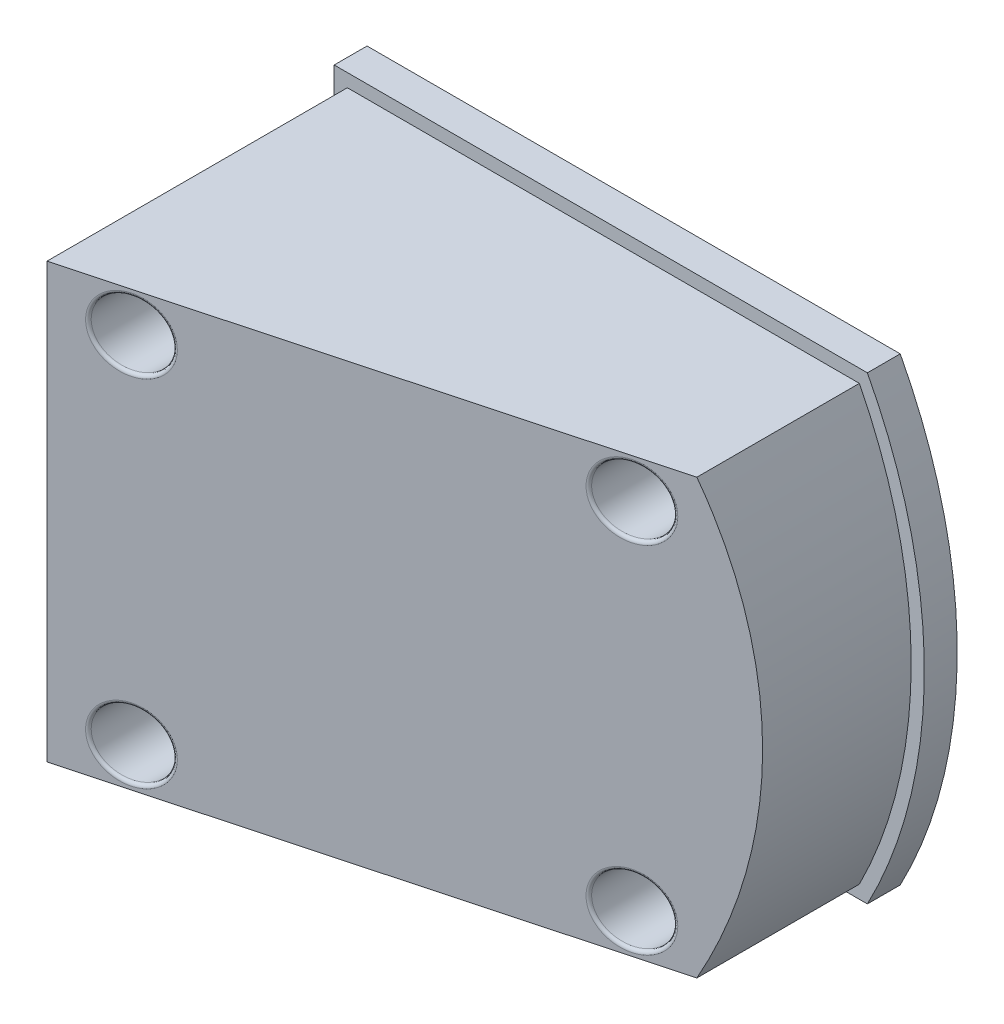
ISO-10303-21;
HEADER;
FILE_DESCRIPTION(('STEP AP214'),'2;1');
FILE_NAME('part.step','',(''),(''),'','','');
FILE_SCHEMA(('AUTOMOTIVE_DESIGN { 1 0 10303 214 1 1 1 1 }'));
ENDSEC;
DATA;
#1=APPLICATION_CONTEXT('core data for automotive mechanical design processes');
#2=APPLICATION_PROTOCOL_DEFINITION('international standard','automotive_design',2000,#1);
#3=PRODUCT_CONTEXT('',#1,'mechanical');
#4=PRODUCT('Part','Part','',(#3));
#5=PRODUCT_RELATED_PRODUCT_CATEGORY('part','',(#4));
#6=PRODUCT_DEFINITION_FORMATION('','',#4);
#7=PRODUCT_DEFINITION_CONTEXT('part definition',#1,'design');
#8=PRODUCT_DEFINITION('design','',#6,#7);
#9=PRODUCT_DEFINITION_SHAPE('','',#8);
#10=(LENGTH_UNIT() NAMED_UNIT(*) SI_UNIT(.MILLI.,.METRE.));
#11=(NAMED_UNIT(*) PLANE_ANGLE_UNIT() SI_UNIT($,.RADIAN.));
#12=(NAMED_UNIT(*) SI_UNIT($,.STERADIAN.) SOLID_ANGLE_UNIT());
#13=UNCERTAINTY_MEASURE_WITH_UNIT(LENGTH_MEASURE(1.E-05),#10,'distance_accuracy_value','');
#14=(GEOMETRIC_REPRESENTATION_CONTEXT(3) GLOBAL_UNCERTAINTY_ASSIGNED_CONTEXT((#13)) GLOBAL_UNIT_ASSIGNED_CONTEXT((#10,
#11,#12)) REPRESENTATION_CONTEXT('',''));
#15=CARTESIAN_POINT('',(0.,0.,0.));
#16=DIRECTION('',(0.,0.,1.));
#17=DIRECTION('',(1.,0.,0.));
#18=AXIS2_PLACEMENT_3D('',#15,#16,#17);
#19=CARTESIAN_POINT('',(43.9991415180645,-40.,35.4159116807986));
#20=DIRECTION('',(0.259973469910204,0.,0.965615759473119));
#21=DIRECTION('',(-0.965615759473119,0.,0.259973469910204));
#22=AXIS2_PLACEMENT_3D('',#19,#20,#21);
#23=PLANE('',#22);
#24=CARTESIAN_POINT('',(57.3281296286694,27.,31.8273380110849));
#25=DIRECTION('',(0.259973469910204,0.,0.965615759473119));
#26=DIRECTION('',(0.965615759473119,0.,-0.259973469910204));
#27=AXIS2_PLACEMENT_3D('',#24,#25,#26);
#28=ELLIPSE('',#27,5.69584738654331,5.5);
#29=CARTESIAN_POINT('',(62.8281296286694,27.,30.3465688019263));
#30=VERTEX_POINT('',#29);
#31=EDGE_CURVE('E196',#30,#30,#28,.F.);
#32=ORIENTED_EDGE('',*,*,#31,.T.);
#33=EDGE_LOOP('',(#32));
#34=FACE_BOUND('',#33,.T.);
#35=CARTESIAN_POINT('',(-2.67187037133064,27.,47.9811839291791));
#36=DIRECTION('',(0.259973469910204,0.,0.965615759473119));
#37=DIRECTION('',(0.965615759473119,0.,-0.259973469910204));
#38=AXIS2_PLACEMENT_3D('',#35,#36,#37);
#39=ELLIPSE('',#38,5.69584738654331,5.5);
#40=CARTESIAN_POINT('',(2.82812962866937,27.,46.5004147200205));
#41=VERTEX_POINT('',#40);
#42=EDGE_CURVE('E193',#41,#41,#39,.F.);
#43=ORIENTED_EDGE('',*,*,#42,.T.);
#44=EDGE_LOOP('',(#43));
#45=FACE_BOUND('',#44,.T.);
#46=CARTESIAN_POINT('',(57.3281296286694,-27.,31.8273380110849));
#47=DIRECTION('',(0.259973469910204,0.,0.965615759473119));
#48=DIRECTION('',(0.965615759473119,0.,-0.259973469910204));
#49=AXIS2_PLACEMENT_3D('',#46,#47,#48);
#50=ELLIPSE('',#49,5.69584738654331,5.5);
#51=CARTESIAN_POINT('',(62.8281296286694,-27.,30.3465688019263));
#52=VERTEX_POINT('',#51);
#53=EDGE_CURVE('E190',#52,#52,#50,.F.);
#54=ORIENTED_EDGE('',*,*,#53,.T.);
#55=EDGE_LOOP('',(#54));
#56=FACE_BOUND('',#55,.T.);
#57=CARTESIAN_POINT('',(-2.67187037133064,-27.,47.9811839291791));
#58=DIRECTION('',(0.259973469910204,0.,0.965615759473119));
#59=DIRECTION('',(0.965615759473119,0.,-0.259973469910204));
#60=AXIS2_PLACEMENT_3D('',#57,#58,#59);
#61=ELLIPSE('',#60,5.69584738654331,5.5);
#62=CARTESIAN_POINT('',(2.82812962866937,-27.,46.5004147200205));
#63=VERTEX_POINT('',#62);
#64=EDGE_CURVE('E187',#63,#63,#61,.F.);
#65=ORIENTED_EDGE('',*,*,#64,.T.);
#66=EDGE_LOOP('',(#65));
#67=FACE_BOUND('',#66,.T.);
#68=DIRECTION('',(0.965615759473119,0.,-0.259973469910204));
#69=VECTOR('',#68,1.);
#70=CARTESIAN_POINT('',(-37.5605288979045,-33.,57.3742841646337));
#71=LINE('',#70,#69);
#72=CARTESIAN_POINT('',(-12.8018571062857,-33.,50.7084880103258));
#73=VERTEX_POINT('',#72);
#74=CARTESIAN_POINT('',(65.1152823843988,-33.,29.7307969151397));
#75=VERTEX_POINT('',#74);
#76=EDGE_CURVE('E110',#73,#75,#71,.T.);
#77=ORIENTED_EDGE('',*,*,#76,.T.);
#78=CARTESIAN_POINT('',(0.,0.,47.2618342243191));
#79=DIRECTION('',(0.259973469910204,0.,0.965615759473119));
#80=DIRECTION('',(0.965615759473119,0.,-0.259973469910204));
#81=AXIS2_PLACEMENT_3D('',#78,#79,#80);
#82=ELLIPSE('',#81,75.5994289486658,73.);
#83=CARTESIAN_POINT('',(65.1152823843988,33.,29.7307969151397));
#84=VERTEX_POINT('',#83);
#85=EDGE_CURVE('E116',#75,#84,#82,.T.);
#86=ORIENTED_EDGE('',*,*,#85,.T.);
#87=DIRECTION('',(-0.965615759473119,0.,0.259973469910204));
#88=VECTOR('',#87,1.);
#89=CARTESIAN_POINT('',(35.090486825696,33.,37.8143956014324));
#90=LINE('',#89,#88);
#91=CARTESIAN_POINT('',(-12.8018571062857,33.,50.7084880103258));
#92=VERTEX_POINT('',#91);
#93=EDGE_CURVE('E119',#84,#92,#90,.T.);
#94=ORIENTED_EDGE('',*,*,#93,.T.);
#95=DIRECTION('',(0.,-1.,0.));
#96=VECTOR('',#95,1.);
#97=CARTESIAN_POINT('',(-12.8018571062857,33.,50.7084880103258));
#98=LINE('',#97,#96);
#99=EDGE_CURVE('E104',#92,#73,#98,.T.);
#100=ORIENTED_EDGE('',*,*,#99,.T.);
#101=EDGE_LOOP('',(#77,#86,#94,#100));
#102=FACE_BOUND('',#101,.T.);
#103=ADVANCED_FACE('F32',(#34,#45,#56,#67,#102),#23,.T.);
#104=CARTESIAN_POINT('',(66.332495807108,35.,5.));
#105=DIRECTION('',(0.,-1.,0.));
#106=DIRECTION('',(0.,0.,-1.));
#107=AXIS2_PLACEMENT_3D('',#104,#105,#106);
#108=PLANE('',#107);
#109=DIRECTION('',(-1.,0.,0.));
#110=VECTOR('',#109,1.);
#111=CARTESIAN_POINT('',(66.332495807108,35.,0.));
#112=LINE('',#111,#110);
#113=CARTESIAN_POINT('',(66.332495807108,35.,0.));
#114=VERTEX_POINT('',#113);
#115=CARTESIAN_POINT('',(-14.8018571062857,35.,0.));
#116=VERTEX_POINT('',#115);
#117=EDGE_CURVE('E120',#114,#116,#112,.T.);
#118=ORIENTED_EDGE('',*,*,#117,.T.);
#119=DIRECTION('',(0.,0.,-1.));
#120=VECTOR('',#119,1.);
#121=CARTESIAN_POINT('',(-14.8018571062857,35.,5.));
#122=LINE('',#121,#120);
#123=CARTESIAN_POINT('',(-14.8018571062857,35.,5.));
#124=VERTEX_POINT('',#123);
#125=EDGE_CURVE('E161',#124,#116,#122,.T.);
#126=ORIENTED_EDGE('',*,*,#125,.F.);
#127=DIRECTION('',(-1.,0.,0.));
#128=VECTOR('',#127,1.);
#129=CARTESIAN_POINT('',(66.332495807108,35.,5.));
#130=LINE('',#129,#128);
#131=CARTESIAN_POINT('',(66.332495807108,35.,5.));
#132=VERTEX_POINT('',#131);
#133=EDGE_CURVE('E138',#132,#124,#130,.T.);
#134=ORIENTED_EDGE('',*,*,#133,.F.);
#135=DIRECTION('',(0.,0.,-1.));
#136=VECTOR('',#135,1.);
#137=CARTESIAN_POINT('',(66.332495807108,35.,5.));
#138=LINE('',#137,#136);
#139=EDGE_CURVE('E147',#132,#114,#138,.T.);
#140=ORIENTED_EDGE('',*,*,#139,.T.);
#141=EDGE_LOOP('',(#118,#126,#134,#140));
#142=FACE_BOUND('',#141,.T.);
#143=ADVANCED_FACE('F226',(#142),#108,.F.);
#144=CARTESIAN_POINT('',(-14.8018571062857,35.,5.));
#145=DIRECTION('',(1.,0.,0.));
#146=DIRECTION('',(0.,0.,-1.));
#147=AXIS2_PLACEMENT_3D('',#144,#145,#146);
#148=PLANE('',#147);
#149=DIRECTION('',(0.,-1.,0.));
#150=VECTOR('',#149,1.);
#151=CARTESIAN_POINT('',(-14.8018571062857,35.,0.));
#152=LINE('',#151,#150);
#153=CARTESIAN_POINT('',(-14.8018571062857,-35.,0.));
#154=VERTEX_POINT('',#153);
#155=EDGE_CURVE('E123',#116,#154,#152,.T.);
#156=ORIENTED_EDGE('',*,*,#155,.T.);
#157=DIRECTION('',(0.,0.,-1.));
#158=VECTOR('',#157,1.);
#159=CARTESIAN_POINT('',(-14.8018571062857,-35.,5.));
#160=LINE('',#159,#158);
#161=CARTESIAN_POINT('',(-14.8018571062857,-35.,5.));
#162=VERTEX_POINT('',#161);
#163=EDGE_CURVE('E158',#162,#154,#160,.T.);
#164=ORIENTED_EDGE('',*,*,#163,.F.);
#165=DIRECTION('',(0.,-1.,0.));
#166=VECTOR('',#165,1.);
#167=CARTESIAN_POINT('',(-14.8018571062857,35.,5.));
#168=LINE('',#167,#166);
#169=EDGE_CURVE('E141',#124,#162,#168,.T.);
#170=ORIENTED_EDGE('',*,*,#169,.F.);
#171=ORIENTED_EDGE('',*,*,#125,.T.);
#172=EDGE_LOOP('',(#156,#164,#170,#171));
#173=FACE_BOUND('',#172,.T.);
#174=ADVANCED_FACE('F292',(#173),#148,.F.);
#175=CARTESIAN_POINT('',(-14.8018571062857,-35.,5.));
#176=DIRECTION('',(0.,1.,0.));
#177=DIRECTION('',(-1.,0.,0.));
#178=AXIS2_PLACEMENT_3D('',#175,#176,#177);
#179=PLANE('',#178);
#180=DIRECTION('',(1.,0.,0.));
#181=VECTOR('',#180,1.);
#182=CARTESIAN_POINT('',(-14.8018571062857,-35.,0.));
#183=LINE('',#182,#181);
#184=CARTESIAN_POINT('',(66.332495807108,-35.,0.));
#185=VERTEX_POINT('',#184);
#186=EDGE_CURVE('E150',#154,#185,#183,.T.);
#187=ORIENTED_EDGE('',*,*,#186,.T.);
#188=DIRECTION('',(0.,0.,-1.));
#189=VECTOR('',#188,1.);
#190=CARTESIAN_POINT('',(66.332495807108,-35.,5.));
#191=LINE('',#190,#189);
#192=CARTESIAN_POINT('',(66.332495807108,-35.,5.));
#193=VERTEX_POINT('',#192);
#194=EDGE_CURVE('E155',#193,#185,#191,.T.);
#195=ORIENTED_EDGE('',*,*,#194,.F.);
#196=DIRECTION('',(1.,0.,0.));
#197=VECTOR('',#196,1.);
#198=CARTESIAN_POINT('',(-14.8018571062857,-35.,5.));
#199=LINE('',#198,#197);
#200=EDGE_CURVE('E144',#162,#193,#199,.T.);
#201=ORIENTED_EDGE('',*,*,#200,.F.);
#202=ORIENTED_EDGE('',*,*,#163,.T.);
#203=EDGE_LOOP('',(#187,#195,#201,#202));
#204=FACE_BOUND('',#203,.T.);
#205=ADVANCED_FACE('F297',(#204),#179,.F.);
#206=CARTESIAN_POINT('',(0.,0.,5.));
#207=DIRECTION('',(0.,0.,-1.));
#208=DIRECTION('',(-1.,0.,0.));
#209=AXIS2_PLACEMENT_3D('',#206,#207,#208);
#210=CYLINDRICAL_SURFACE('',#209,75.);
#211=CARTESIAN_POINT('',(0.,0.,0.));
#212=DIRECTION('',(0.,0.,1.));
#213=DIRECTION('',(1.,0.,0.));
#214=AXIS2_PLACEMENT_3D('',#211,#212,#213);
#215=CIRCLE('',#214,75.);
#216=EDGE_CURVE('E142',#185,#114,#215,.T.);
#217=ORIENTED_EDGE('',*,*,#216,.T.);
#218=ORIENTED_EDGE('',*,*,#139,.F.);
#219=CARTESIAN_POINT('',(0.,0.,5.));
#220=DIRECTION('',(0.,0.,1.));
#221=DIRECTION('',(1.,0.,0.));
#222=AXIS2_PLACEMENT_3D('',#219,#220,#221);
#223=CIRCLE('',#222,75.);
#224=EDGE_CURVE('E146',#193,#132,#223,.T.);
#225=ORIENTED_EDGE('',*,*,#224,.F.);
#226=ORIENTED_EDGE('',*,*,#194,.T.);
#227=EDGE_LOOP('',(#217,#218,#225,#226));
#228=FACE_BOUND('',#227,.T.);
#229=ADVANCED_FACE('F283',(#228),#210,.T.);
#230=CARTESIAN_POINT('',(0.,0.,5.));
#231=DIRECTION('',(0.,0.,1.));
#232=DIRECTION('',(1.,0.,0.));
#233=AXIS2_PLACEMENT_3D('',#230,#231,#232);
#234=PLANE('',#233);
#235=CARTESIAN_POINT('',(0.,0.,5.));
#236=DIRECTION('',(0.,0.,1.));
#237=DIRECTION('',(1.,0.,0.));
#238=AXIS2_PLACEMENT_3D('',#235,#236,#237);
#239=CIRCLE('',#238,73.);
#240=CARTESIAN_POINT('',(65.1152823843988,-33.,5.));
#241=VERTEX_POINT('',#240);
#242=CARTESIAN_POINT('',(65.1152823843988,33.,5.));
#243=VERTEX_POINT('',#242);
#244=EDGE_CURVE('E51',#241,#243,#239,.T.);
#245=ORIENTED_EDGE('',*,*,#244,.F.);
#246=DIRECTION('',(1.,0.,0.));
#247=VECTOR('',#246,1.);
#248=CARTESIAN_POINT('',(-12.8018571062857,-33.,5.));
#249=LINE('',#248,#247);
#250=CARTESIAN_POINT('',(-12.8018571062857,-33.,5.));
#251=VERTEX_POINT('',#250);
#252=EDGE_CURVE('E56',#251,#241,#249,.T.);
#253=ORIENTED_EDGE('',*,*,#252,.F.);
#254=DIRECTION('',(0.,-1.,0.));
#255=VECTOR('',#254,1.);
#256=CARTESIAN_POINT('',(-12.8018571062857,33.,5.));
#257=LINE('',#256,#255);
#258=CARTESIAN_POINT('',(-12.8018571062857,33.,5.));
#259=VERTEX_POINT('',#258);
#260=EDGE_CURVE('E106',#259,#251,#257,.T.);
#261=ORIENTED_EDGE('',*,*,#260,.F.);
#262=DIRECTION('',(-1.,0.,0.));
#263=VECTOR('',#262,1.);
#264=CARTESIAN_POINT('',(65.1152823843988,33.,5.));
#265=LINE('',#264,#263);
#266=EDGE_CURVE('E133',#243,#259,#265,.T.);
#267=ORIENTED_EDGE('',*,*,#266,.F.);
#268=EDGE_LOOP('',(#245,#253,#261,#267));
#269=FACE_BOUND('',#268,.T.);
#270=ORIENTED_EDGE('',*,*,#133,.T.);
#271=ORIENTED_EDGE('',*,*,#169,.T.);
#272=ORIENTED_EDGE('',*,*,#200,.T.);
#273=ORIENTED_EDGE('',*,*,#224,.T.);
#274=EDGE_LOOP('',(#270,#271,#272,#273));
#275=FACE_BOUND('',#274,.T.);
#276=ADVANCED_FACE('F230',(#269,#275),#234,.T.);
#277=CARTESIAN_POINT('',(0.,0.,0.));
#278=DIRECTION('',(0.,0.,1.));
#279=DIRECTION('',(1.,0.,0.));
#280=AXIS2_PLACEMENT_3D('',#277,#278,#279);
#281=PLANE('',#280);
#282=CARTESIAN_POINT('',(57.1981428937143,-27.,0.));
#283=DIRECTION('',(0.,0.,-1.));
#284=DIRECTION('',(-1.,0.,0.));
#285=AXIS2_PLACEMENT_3D('',#282,#283,#284);
#286=CIRCLE('',#285,3.);
#287=CARTESIAN_POINT('',(54.1981428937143,-27.,0.));
#288=VERTEX_POINT('',#287);
#289=EDGE_CURVE('E512',#288,#288,#286,.T.);
#290=ORIENTED_EDGE('',*,*,#289,.F.);
#291=EDGE_LOOP('',(#290));
#292=FACE_BOUND('',#291,.T.);
#293=CARTESIAN_POINT('',(-2.80185710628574,-27.,0.));
#294=DIRECTION('',(0.,0.,-1.));
#295=DIRECTION('',(-1.,0.,0.));
#296=AXIS2_PLACEMENT_3D('',#293,#294,#295);
#297=CIRCLE('',#296,3.);
#298=CARTESIAN_POINT('',(-5.80185710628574,-27.,0.));
#299=VERTEX_POINT('',#298);
#300=EDGE_CURVE('E515',#299,#299,#297,.T.);
#301=ORIENTED_EDGE('',*,*,#300,.F.);
#302=EDGE_LOOP('',(#301));
#303=FACE_BOUND('',#302,.T.);
#304=CARTESIAN_POINT('',(-2.80185710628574,27.,0.));
#305=DIRECTION('',(0.,0.,-1.));
#306=DIRECTION('',(-1.,0.,0.));
#307=AXIS2_PLACEMENT_3D('',#304,#305,#306);
#308=CIRCLE('',#307,3.);
#309=CARTESIAN_POINT('',(-5.80185710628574,27.,0.));
#310=VERTEX_POINT('',#309);
#311=EDGE_CURVE('E511',#310,#310,#308,.T.);
#312=ORIENTED_EDGE('',*,*,#311,.F.);
#313=EDGE_LOOP('',(#312));
#314=FACE_BOUND('',#313,.T.);
#315=CARTESIAN_POINT('',(57.1981428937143,27.,0.));
#316=DIRECTION('',(0.,0.,-1.));
#317=DIRECTION('',(-1.,0.,0.));
#318=AXIS2_PLACEMENT_3D('',#315,#316,#317);
#319=CIRCLE('',#318,3.);
#320=CARTESIAN_POINT('',(54.1981428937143,27.,0.));
#321=VERTEX_POINT('',#320);
#322=EDGE_CURVE('E169',#321,#321,#319,.T.);
#323=ORIENTED_EDGE('',*,*,#322,.F.);
#324=EDGE_LOOP('',(#323));
#325=FACE_BOUND('',#324,.T.);
#326=ORIENTED_EDGE('',*,*,#117,.F.);
#327=ORIENTED_EDGE('',*,*,#216,.F.);
#328=ORIENTED_EDGE('',*,*,#186,.F.);
#329=ORIENTED_EDGE('',*,*,#155,.F.);
#330=EDGE_LOOP('',(#326,#327,#328,#329));
#331=FACE_BOUND('',#330,.T.);
#332=ADVANCED_FACE('F273',(#292,#303,#314,#325,#331),#281,.F.);
#333=CARTESIAN_POINT('',(0.,0.,149.335066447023));
#334=DIRECTION('',(0.,0.,-1.));
#335=DIRECTION('',(-1.,0.,0.));
#336=AXIS2_PLACEMENT_3D('',#333,#334,#335);
#337=CYLINDRICAL_SURFACE('',#336,73.);
#338=ORIENTED_EDGE('',*,*,#85,.F.);
#339=DIRECTION('',(0.,0.,-1.));
#340=VECTOR('',#339,1.);
#341=CARTESIAN_POINT('',(65.1152823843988,-33.,149.335066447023));
#342=LINE('',#341,#340);
#343=EDGE_CURVE('E112',#75,#241,#342,.T.);
#344=ORIENTED_EDGE('',*,*,#343,.T.);
#345=ORIENTED_EDGE('',*,*,#244,.T.);
#346=DIRECTION('',(0.,0.,-1.));
#347=VECTOR('',#346,1.);
#348=CARTESIAN_POINT('',(65.1152823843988,33.,149.335066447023));
#349=LINE('',#348,#347);
#350=EDGE_CURVE('E130',#84,#243,#349,.T.);
#351=ORIENTED_EDGE('',*,*,#350,.F.);
#352=EDGE_LOOP('',(#338,#344,#345,#351));
#353=FACE_BOUND('',#352,.T.);
#354=ADVANCED_FACE('F228',(#353),#337,.T.);
#355=CARTESIAN_POINT('',(65.1152823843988,33.,149.335066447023));
#356=DIRECTION('',(0.,-1.,0.));
#357=DIRECTION('',(0.,0.,-1.));
#358=AXIS2_PLACEMENT_3D('',#355,#356,#357);
#359=PLANE('',#358);
#360=ORIENTED_EDGE('',*,*,#93,.F.);
#361=ORIENTED_EDGE('',*,*,#350,.T.);
#362=ORIENTED_EDGE('',*,*,#266,.T.);
#363=DIRECTION('',(0.,0.,-1.));
#364=VECTOR('',#363,1.);
#365=CARTESIAN_POINT('',(-12.8018571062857,33.,149.335066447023));
#366=LINE('',#365,#364);
#367=EDGE_CURVE('E134',#92,#259,#366,.T.);
#368=ORIENTED_EDGE('',*,*,#367,.F.);
#369=EDGE_LOOP('',(#360,#361,#362,#368));
#370=FACE_BOUND('',#369,.T.);
#371=ADVANCED_FACE('F267',(#370),#359,.F.);
#372=CARTESIAN_POINT('',(-12.8018571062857,33.,149.335066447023));
#373=DIRECTION('',(1.,0.,0.));
#374=DIRECTION('',(0.,0.,-1.));
#375=AXIS2_PLACEMENT_3D('',#372,#373,#374);
#376=PLANE('',#375);
#377=ORIENTED_EDGE('',*,*,#99,.F.);
#378=ORIENTED_EDGE('',*,*,#367,.T.);
#379=ORIENTED_EDGE('',*,*,#260,.T.);
#380=DIRECTION('',(0.,0.,-1.));
#381=VECTOR('',#380,1.);
#382=CARTESIAN_POINT('',(-12.8018571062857,-33.,149.335066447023));
#383=LINE('',#382,#381);
#384=EDGE_CURVE('E99',#73,#251,#383,.T.);
#385=ORIENTED_EDGE('',*,*,#384,.F.);
#386=EDGE_LOOP('',(#377,#378,#379,#385));
#387=FACE_BOUND('',#386,.T.);
#388=ADVANCED_FACE('F101',(#387),#376,.F.);
#389=CARTESIAN_POINT('',(-12.8018571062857,-33.,149.335066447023));
#390=DIRECTION('',(0.,1.,0.));
#391=DIRECTION('',(-1.,0.,0.));
#392=AXIS2_PLACEMENT_3D('',#389,#390,#391);
#393=PLANE('',#392);
#394=ORIENTED_EDGE('',*,*,#76,.F.);
#395=ORIENTED_EDGE('',*,*,#384,.T.);
#396=ORIENTED_EDGE('',*,*,#252,.T.);
#397=ORIENTED_EDGE('',*,*,#343,.F.);
#398=EDGE_LOOP('',(#394,#395,#396,#397));
#399=FACE_BOUND('',#398,.T.);
#400=ADVANCED_FACE('F111',(#399),#393,.F.);
#401=CARTESIAN_POINT('',(-2.80185710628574,27.,50.7084880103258));
#402=DIRECTION('',(0.,0.,-1.));
#403=DIRECTION('',(-1.,0.,0.));
#404=AXIS2_PLACEMENT_3D('',#401,#402,#403);
#405=CYLINDRICAL_SURFACE('',#404,5.);
#406=CARTESIAN_POINT('',(-2.80185710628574,27.,47.4983760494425));
#407=DIRECTION('',(-0.283962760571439,0.,-0.958835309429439));
#408=DIRECTION('',(0.958835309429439,0.,-0.283962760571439));
#409=AXIS2_PLACEMENT_3D('',#406,#407,#408);
#410=ELLIPSE('',#409,5.21465985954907,5.);
#411=CARTESIAN_POINT('',(2.19814289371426,27.,46.0176068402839));
#412=VERTEX_POINT('',#411);
#413=EDGE_CURVE('E199',#412,#412,#410,.F.);
#414=ORIENTED_EDGE('',*,*,#413,.T.);
#415=EDGE_LOOP('',(#414));
#416=FACE_BOUND('',#415,.T.);
#417=CARTESIAN_POINT('',(-2.80185710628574,27.,37.));
#418=DIRECTION('',(0.,0.,-1.));
#419=DIRECTION('',(-1.,0.,0.));
#420=AXIS2_PLACEMENT_3D('',#417,#418,#419);
#421=CIRCLE('',#420,5.);
#422=CARTESIAN_POINT('',(-7.80185710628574,27.,37.));
#423=VERTEX_POINT('',#422);
#424=EDGE_CURVE('E137',#423,#423,#421,.T.);
#425=ORIENTED_EDGE('',*,*,#424,.T.);
#426=EDGE_LOOP('',(#425));
#427=FACE_BOUND('',#426,.T.);
#428=ADVANCED_FACE('F258',(#416,#427),#405,.F.);
#429=CARTESIAN_POINT('',(-2.80185710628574,27.,37.));
#430=DIRECTION('',(0.,0.,-1.));
#431=DIRECTION('',(-1.,0.,0.));
#432=AXIS2_PLACEMENT_3D('',#429,#430,#431);
#433=PLANE('',#432);
#434=CARTESIAN_POINT('',(-2.80185710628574,27.,37.));
#435=DIRECTION('',(0.,0.,-1.));
#436=DIRECTION('',(-1.,0.,0.));
#437=AXIS2_PLACEMENT_3D('',#434,#435,#436);
#438=CIRCLE('',#437,3.);
#439=CARTESIAN_POINT('',(-5.80185710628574,27.,37.));
#440=VERTEX_POINT('',#439);
#441=EDGE_CURVE('E175',#440,#440,#438,.T.);
#442=ORIENTED_EDGE('',*,*,#441,.T.);
#443=EDGE_LOOP('',(#442));
#444=FACE_BOUND('',#443,.T.);
#445=ORIENTED_EDGE('',*,*,#424,.F.);
#446=EDGE_LOOP('',(#445));
#447=FACE_BOUND('',#446,.T.);
#448=ADVANCED_FACE('F255',(#444,#447),#433,.F.);
#449=CARTESIAN_POINT('',(-2.80185710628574,-27.,50.7084880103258));
#450=DIRECTION('',(0.,0.,-1.));
#451=DIRECTION('',(-1.,0.,0.));
#452=AXIS2_PLACEMENT_3D('',#449,#450,#451);
#453=CYLINDRICAL_SURFACE('',#452,5.);
#454=CARTESIAN_POINT('',(-2.80185710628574,-27.,47.4983760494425));
#455=DIRECTION('',(-0.283962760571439,0.,-0.958835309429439));
#456=DIRECTION('',(0.958835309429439,0.,-0.283962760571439));
#457=AXIS2_PLACEMENT_3D('',#454,#455,#456);
#458=ELLIPSE('',#457,5.21465985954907,5.);
#459=CARTESIAN_POINT('',(2.19814289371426,-27.,46.0176068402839));
#460=VERTEX_POINT('',#459);
#461=EDGE_CURVE('E11',#460,#460,#458,.F.);
#462=ORIENTED_EDGE('',*,*,#461,.T.);
#463=EDGE_LOOP('',(#462));
#464=FACE_BOUND('',#463,.T.);
#465=CARTESIAN_POINT('',(-2.80185710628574,-27.,37.));
#466=DIRECTION('',(0.,0.,-1.));
#467=DIRECTION('',(1.,0.,0.));
#468=AXIS2_PLACEMENT_3D('',#465,#466,#467);
#469=CIRCLE('',#468,5.);
#470=CARTESIAN_POINT('',(2.19814289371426,-27.,37.));
#471=VERTEX_POINT('',#470);
#472=EDGE_CURVE('E503',#471,#471,#469,.T.);
#473=ORIENTED_EDGE('',*,*,#472,.T.);
#474=EDGE_LOOP('',(#473));
#475=FACE_BOUND('',#474,.T.);
#476=ADVANCED_FACE('F250',(#464,#475),#453,.F.);
#477=CARTESIAN_POINT('',(-2.80185710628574,-27.,37.));
#478=DIRECTION('',(0.,0.,1.));
#479=DIRECTION('',(1.,0.,0.));
#480=AXIS2_PLACEMENT_3D('',#477,#478,#479);
#481=PLANE('',#480);
#482=CARTESIAN_POINT('',(-2.80185710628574,-27.,37.));
#483=DIRECTION('',(0.,0.,1.));
#484=DIRECTION('',(1.,0.,0.));
#485=AXIS2_PLACEMENT_3D('',#482,#483,#484);
#486=CIRCLE('',#485,3.);
#487=CARTESIAN_POINT('',(0.198142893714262,-27.,37.));
#488=VERTEX_POINT('',#487);
#489=EDGE_CURVE('E172',#488,#488,#486,.T.);
#490=ORIENTED_EDGE('',*,*,#489,.F.);
#491=EDGE_LOOP('',(#490));
#492=FACE_BOUND('',#491,.T.);
#493=ORIENTED_EDGE('',*,*,#472,.F.);
#494=EDGE_LOOP('',(#493));
#495=FACE_BOUND('',#494,.T.);
#496=ADVANCED_FACE('F244',(#492,#495),#481,.T.);
#497=CARTESIAN_POINT('',(57.1981428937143,-27.,50.7084880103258));
#498=DIRECTION('',(0.,0.,-1.));
#499=DIRECTION('',(-1.,0.,0.));
#500=AXIS2_PLACEMENT_3D('',#497,#498,#499);
#501=CYLINDRICAL_SURFACE('',#500,5.);
#502=CARTESIAN_POINT('',(57.1981428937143,-27.,31.3445301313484));
#503=DIRECTION('',(-0.28396276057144,0.,-0.958835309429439));
#504=DIRECTION('',(0.958835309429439,0.,-0.28396276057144));
#505=AXIS2_PLACEMENT_3D('',#502,#503,#504);
#506=ELLIPSE('',#505,5.21465985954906,5.);
#507=CARTESIAN_POINT('',(62.1981428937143,-27.,29.8637609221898));
#508=VERTEX_POINT('',#507);
#509=EDGE_CURVE('E43',#508,#508,#506,.F.);
#510=ORIENTED_EDGE('',*,*,#509,.T.);
#511=EDGE_LOOP('',(#510));
#512=FACE_BOUND('',#511,.T.);
#513=CARTESIAN_POINT('',(57.1981428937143,-27.,22.));
#514=DIRECTION('',(0.,0.,1.));
#515=DIRECTION('',(1.,0.,0.));
#516=AXIS2_PLACEMENT_3D('',#513,#514,#515);
#517=CIRCLE('',#516,5.);
#518=CARTESIAN_POINT('',(62.1981428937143,-27.,22.));
#519=VERTEX_POINT('',#518);
#520=EDGE_CURVE('E178',#519,#519,#517,.T.);
#521=ORIENTED_EDGE('',*,*,#520,.F.);
#522=EDGE_LOOP('',(#521));
#523=FACE_BOUND('',#522,.T.);
#524=ADVANCED_FACE('F238',(#512,#523),#501,.F.);
#525=CARTESIAN_POINT('',(57.1981428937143,-27.,22.));
#526=DIRECTION('',(0.,0.,1.));
#527=DIRECTION('',(1.,0.,0.));
#528=AXIS2_PLACEMENT_3D('',#525,#526,#527);
#529=PLANE('',#528);
#530=CARTESIAN_POINT('',(57.1981428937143,-27.,22.));
#531=DIRECTION('',(0.,0.,1.));
#532=DIRECTION('',(1.,0.,0.));
#533=AXIS2_PLACEMENT_3D('',#530,#531,#532);
#534=CIRCLE('',#533,3.);
#535=CARTESIAN_POINT('',(60.1981428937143,-27.,22.));
#536=VERTEX_POINT('',#535);
#537=EDGE_CURVE('E168',#536,#536,#534,.T.);
#538=ORIENTED_EDGE('',*,*,#537,.F.);
#539=EDGE_LOOP('',(#538));
#540=FACE_BOUND('',#539,.T.);
#541=ORIENTED_EDGE('',*,*,#520,.T.);
#542=EDGE_LOOP('',(#541));
#543=FACE_BOUND('',#542,.T.);
#544=ADVANCED_FACE('F243',(#540,#543),#529,.T.);
#545=CARTESIAN_POINT('',(57.1981428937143,27.,50.7084880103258));
#546=DIRECTION('',(0.,0.,-1.));
#547=DIRECTION('',(-1.,0.,0.));
#548=AXIS2_PLACEMENT_3D('',#545,#546,#547);
#549=CYLINDRICAL_SURFACE('',#548,5.);
#550=CARTESIAN_POINT('',(57.1981428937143,27.,22.5));
#551=DIRECTION('',(0.,0.,-1.));
#552=DIRECTION('',(-1.,0.,0.));
#553=AXIS2_PLACEMENT_3D('',#550,#551,#552);
#554=CIRCLE('',#553,5.);
#555=CARTESIAN_POINT('',(52.1981428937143,27.,22.5));
#556=VERTEX_POINT('',#555);
#557=EDGE_CURVE('E181',#556,#556,#554,.T.);
#558=ORIENTED_EDGE('',*,*,#557,.T.);
#559=EDGE_LOOP('',(#558));
#560=FACE_BOUND('',#559,.T.);
#561=CARTESIAN_POINT('',(57.1981428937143,27.,31.3445301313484));
#562=DIRECTION('',(-0.28396276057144,0.,-0.958835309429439));
#563=DIRECTION('',(0.958835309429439,0.,-0.28396276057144));
#564=AXIS2_PLACEMENT_3D('',#561,#562,#563);
#565=ELLIPSE('',#564,5.21465985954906,5.);
#566=CARTESIAN_POINT('',(62.1981428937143,27.,29.8637609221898));
#567=VERTEX_POINT('',#566);
#568=EDGE_CURVE('E164',#567,#567,#565,.F.);
#569=ORIENTED_EDGE('',*,*,#568,.T.);
#570=EDGE_LOOP('',(#569));
#571=FACE_BOUND('',#570,.T.);
#572=ADVANCED_FACE('F218',(#560,#571),#549,.F.);
#573=CARTESIAN_POINT('',(57.1981428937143,27.,22.));
#574=DIRECTION('',(0.,0.,-1.));
#575=DIRECTION('',(-1.,0.,0.));
#576=AXIS2_PLACEMENT_3D('',#573,#574,#575);
#577=PLANE('',#576);
#578=CARTESIAN_POINT('',(57.1981428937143,27.,22.));
#579=DIRECTION('',(0.,0.,-1.));
#580=DIRECTION('',(-1.,0.,0.));
#581=AXIS2_PLACEMENT_3D('',#578,#579,#580);
#582=CIRCLE('',#581,4.5);
#583=CARTESIAN_POINT('',(52.6981428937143,27.,22.));
#584=VERTEX_POINT('',#583);
#585=EDGE_CURVE('E184',#584,#584,#582,.F.);
#586=ORIENTED_EDGE('',*,*,#585,.T.);
#587=EDGE_LOOP('',(#586));
#588=FACE_BOUND('',#587,.T.);
#589=CARTESIAN_POINT('',(57.1981428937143,27.,22.));
#590=DIRECTION('',(0.,0.,-1.));
#591=DIRECTION('',(-1.,0.,0.));
#592=AXIS2_PLACEMENT_3D('',#589,#590,#591);
#593=CIRCLE('',#592,3.);
#594=CARTESIAN_POINT('',(54.1981428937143,27.,22.));
#595=VERTEX_POINT('',#594);
#596=EDGE_CURVE('E165',#595,#595,#593,.T.);
#597=ORIENTED_EDGE('',*,*,#596,.T.);
#598=EDGE_LOOP('',(#597));
#599=FACE_BOUND('',#598,.T.);
#600=ADVANCED_FACE('F395',(#588,#599),#577,.F.);
#601=CARTESIAN_POINT('',(57.1981428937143,27.,50.7084880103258));
#602=DIRECTION('',(0.,0.,-1.));
#603=DIRECTION('',(-1.,0.,0.));
#604=AXIS2_PLACEMENT_3D('',#601,#602,#603);
#605=CYLINDRICAL_SURFACE('',#604,3.);
#606=ORIENTED_EDGE('',*,*,#322,.T.);
#607=EDGE_LOOP('',(#606));
#608=FACE_BOUND('',#607,.T.);
#609=ORIENTED_EDGE('',*,*,#596,.F.);
#610=EDGE_LOOP('',(#609));
#611=FACE_BOUND('',#610,.T.);
#612=ADVANCED_FACE('F389',(#608,#611),#605,.F.);
#613=CARTESIAN_POINT('',(57.1981428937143,-27.,50.7084880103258));
#614=DIRECTION('',(0.,0.,-1.));
#615=DIRECTION('',(-1.,0.,0.));
#616=AXIS2_PLACEMENT_3D('',#613,#614,#615);
#617=CYLINDRICAL_SURFACE('',#616,3.);
#618=ORIENTED_EDGE('',*,*,#537,.T.);
#619=EDGE_LOOP('',(#618));
#620=FACE_BOUND('',#619,.T.);
#621=ORIENTED_EDGE('',*,*,#289,.T.);
#622=EDGE_LOOP('',(#621));
#623=FACE_BOUND('',#622,.T.);
#624=ADVANCED_FACE('F394',(#620,#623),#617,.F.);
#625=CARTESIAN_POINT('',(-2.80185710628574,-27.,50.7084880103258));
#626=DIRECTION('',(0.,0.,-1.));
#627=DIRECTION('',(-1.,0.,0.));
#628=AXIS2_PLACEMENT_3D('',#625,#626,#627);
#629=CYLINDRICAL_SURFACE('',#628,3.);
#630=ORIENTED_EDGE('',*,*,#489,.T.);
#631=EDGE_LOOP('',(#630));
#632=FACE_BOUND('',#631,.T.);
#633=ORIENTED_EDGE('',*,*,#300,.T.);
#634=EDGE_LOOP('',(#633));
#635=FACE_BOUND('',#634,.T.);
#636=ADVANCED_FACE('F407',(#632,#635),#629,.F.);
#637=CARTESIAN_POINT('',(-2.80185710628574,27.,50.7084880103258));
#638=DIRECTION('',(0.,0.,-1.));
#639=DIRECTION('',(-1.,0.,0.));
#640=AXIS2_PLACEMENT_3D('',#637,#638,#639);
#641=CYLINDRICAL_SURFACE('',#640,3.);
#642=ORIENTED_EDGE('',*,*,#311,.T.);
#643=EDGE_LOOP('',(#642));
#644=FACE_BOUND('',#643,.T.);
#645=ORIENTED_EDGE('',*,*,#441,.F.);
#646=EDGE_LOOP('',(#645));
#647=FACE_BOUND('',#646,.T.);
#648=ADVANCED_FACE('F417',(#644,#647),#641,.F.);
#649=CARTESIAN_POINT('',(57.1981428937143,27.,22.5));
#650=DIRECTION('',(0.,0.,-1.));
#651=DIRECTION('',(-1.,0.,0.));
#652=AXIS2_PLACEMENT_3D('',#649,#650,#651);
#653=TOROIDAL_SURFACE('',#652,4.5,0.5);
#654=ORIENTED_EDGE('',*,*,#585,.F.);
#655=EDGE_LOOP('',(#654));
#656=FACE_BOUND('',#655,.T.);
#657=ORIENTED_EDGE('',*,*,#557,.F.);
#658=EDGE_LOOP('',(#657));
#659=FACE_BOUND('',#658,.T.);
#660=ADVANCED_FACE('F214',(#656,#659),#653,.F.);
#661=CARTESIAN_POINT('',(62.8281296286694,27.,30.3465688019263));
#662=CARTESIAN_POINT('',(62.1981428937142,27.,30.5161806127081));
#663=CARTESIAN_POINT('',(62.1981428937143,27.,29.8637609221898));
#664=CARTESIAN_POINT('',(62.8281296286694,27.2400315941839,30.3465688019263));
#665=CARTESIAN_POINT('',(62.1981428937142,27.2105463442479,30.5161806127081));
#666=CARTESIAN_POINT('',(62.1981428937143,27.2182105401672,29.8637609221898));
#667=CARTESIAN_POINT('',(62.8123872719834,27.4800631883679,30.3508071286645));
#668=CARTESIAN_POINT('',(62.1848712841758,27.4208809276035,30.5197537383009));
#669=CARTESIAN_POINT('',(62.1838316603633,27.4364210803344,29.867999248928));
#670=CARTESIAN_POINT('',(62.7497271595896,27.9560158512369,30.3676771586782));
#671=CARTESIAN_POINT('',(62.1318508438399,27.8388937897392,30.5340284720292));
#672=CARTESIAN_POINT('',(62.1268679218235,27.8691053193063,29.8848692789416));
#673=CARTESIAN_POINT('',(62.7027712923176,28.1919315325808,30.3803191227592));
#674=CARTESIAN_POINT('',(62.0921747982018,28.0461613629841,30.5447104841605));
#675=CARTESIAN_POINT('',(62.0841807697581,28.083574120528,29.8975112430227));
#676=CARTESIAN_POINT('',(62.5785258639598,28.6556235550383,30.4137698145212));
#677=CARTESIAN_POINT('',(61.9867063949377,28.454921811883,30.5731058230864));
#678=CARTESIAN_POINT('',(61.9712303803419,28.5051123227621,29.9309619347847));
#679=CARTESIAN_POINT('',(62.5011650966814,28.8833794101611,30.4345977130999));
#680=CARTESIAN_POINT('',(61.9210535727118,28.6560412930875,30.5907815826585));
#681=CARTESIAN_POINT('',(61.9009024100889,28.7121631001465,29.9517898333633));
#682=CARTESIAN_POINT('',(62.3174650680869,29.3268721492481,30.4840554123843));
#683=CARTESIAN_POINT('',(61.7643231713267,29.0493506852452,30.6329782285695));
#684=CARTESIAN_POINT('',(61.7339023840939,29.1153383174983,30.0012475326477));
#685=CARTESIAN_POINT('',(62.21103060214,29.5425666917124,30.5127108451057));
#686=CARTESIAN_POINT('',(61.6734405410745,29.2412257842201,30.6574466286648));
#687=CARTESIAN_POINT('',(61.6371437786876,29.3114242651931,30.0299029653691));
#688=CARTESIAN_POINT('',(61.9710252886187,29.9582695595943,30.5773276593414));
#689=CARTESIAN_POINT('',(61.4673170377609,29.6128806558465,30.7129414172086));
#690=CARTESIAN_POINT('',(61.4189571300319,29.6893359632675,30.0945197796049));
#691=CARTESIAN_POINT('',(61.8373467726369,30.1582111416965,30.6133180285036));
#692=CARTESIAN_POINT('',(61.3523111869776,29.7924206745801,30.7439045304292));
#693=CARTESIAN_POINT('',(61.297431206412,29.8711010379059,30.130510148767));
#694=CARTESIAN_POINT('',(61.5451491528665,30.539011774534,30.6919866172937));
#695=CARTESIAN_POINT('',(61.0994234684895,30.1362799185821,30.8119896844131));
#696=CARTESIAN_POINT('',(61.0317970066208,30.2172834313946,30.2091787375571));
#697=CARTESIAN_POINT('',(61.3865219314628,30.7197817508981,30.7346939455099));
#698=CARTESIAN_POINT('',(60.9617989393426,30.300445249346,30.8490424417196));
#699=CARTESIAN_POINT('',(60.8875904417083,30.3816197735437,30.2518860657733));
#700=CARTESIAN_POINT('',(61.0471372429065,31.0591675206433,30.8260667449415));
#701=CARTESIAN_POINT('',(60.6655981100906,30.6105425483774,30.928788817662));
#702=CARTESIAN_POINT('',(60.5790589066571,30.6901522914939,30.343258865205));
#703=CARTESIAN_POINT('',(60.8662818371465,31.2176781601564,30.8747585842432));
#704=CARTESIAN_POINT('',(60.5072828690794,30.7564114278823,30.9714121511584));
#705=CARTESIAN_POINT('',(60.4146449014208,30.8342528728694,30.3919507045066));
#706=CARTESIAN_POINT('',(60.4855211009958,31.5098470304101,30.9772710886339));
#707=CARTESIAN_POINT('',(60.1720716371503,31.0271019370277,31.0616613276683));
#708=CARTESIAN_POINT('',(60.0684987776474,31.0998609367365,30.4944632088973));
#709=CARTESIAN_POINT('',(60.2855358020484,31.6433933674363,31.0311132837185));
#710=CARTESIAN_POINT('',(59.9954223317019,31.1519507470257,31.1092207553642));
#711=CARTESIAN_POINT('',(59.8866939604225,31.2212666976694,30.548305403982));
#712=CARTESIAN_POINT('',(59.8699158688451,31.8833523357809,31.1430109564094));
#713=CARTESIAN_POINT('',(59.6263414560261,31.3780752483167,31.2085886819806));
#714=CARTESIAN_POINT('',(59.5088576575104,31.4394112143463,30.6602030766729));
#715=CARTESIAN_POINT('',(59.654223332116,31.9896572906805,31.2010820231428));
#716=CARTESIAN_POINT('',(59.4341255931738,31.4794630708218,31.2603391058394));
#717=CARTESIAN_POINT('',(59.3127735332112,31.5360520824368,30.7182741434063));
#718=CARTESIAN_POINT('',(59.2108551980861,32.1733068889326,31.320450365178));
#719=CARTESIAN_POINT('',(59.037095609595,31.6565119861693,31.367231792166));
#720=CARTESIAN_POINT('',(58.909711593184,31.703006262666,30.8376424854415));
#721=CARTESIAN_POINT('',(58.9831439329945,32.2505590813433,31.3817572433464));
#722=CARTESIAN_POINT('',(58.8324517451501,31.7323608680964,31.4223282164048));
#723=CARTESIAN_POINT('',(58.7027013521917,31.7732355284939,30.8989493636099));
#724=CARTESIAN_POINT('',(58.519611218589,32.3747626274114,31.5065545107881));
#725=CARTESIAN_POINT('',(58.414074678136,31.8566233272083,31.5349681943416));
#726=CARTESIAN_POINT('',(58.2813079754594,31.8861478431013,31.0237466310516));
#727=CARTESIAN_POINT('',(58.283772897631,32.4216463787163,31.5700494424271));
#728=CARTESIAN_POINT('',(58.2004543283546,31.9052878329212,31.5924813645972));
#729=CARTESIAN_POINT('',(58.0669095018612,31.9287694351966,31.0872415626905));
#730=CARTESIAN_POINT('',(57.8080025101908,32.4842829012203,31.6981414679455));
#731=CARTESIAN_POINT('',(57.7678838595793,31.9739755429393,31.7089426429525));
#732=CARTESIAN_POINT('',(57.6343909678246,31.9857117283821,31.2153335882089));
#733=CARTESIAN_POINT('',(57.5680660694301,32.5,31.7627397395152));
#734=CARTESIAN_POINT('',(57.548980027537,31.9942976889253,31.7678782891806));
#735=CARTESIAN_POINT('',(57.4162669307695,32.,31.2799318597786));
#736=CARTESIAN_POINT('',(57.0881931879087,32.5,31.8919362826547));
#737=CARTESIAN_POINT('',(57.1097698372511,32.0056380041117,31.8861271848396));
#738=CARTESIAN_POINT('',(56.9800188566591,32.,31.4091284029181));
#739=CARTESIAN_POINT('',(56.8482567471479,32.4842829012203,31.9565345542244));
#740=CARTESIAN_POINT('',(56.8894371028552,31.9969858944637,31.945447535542));
#741=CARTESIAN_POINT('',(56.7618948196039,31.9857117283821,31.4737266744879));
#742=CARTESIAN_POINT('',(56.3724863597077,32.4216463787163,32.0846265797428));
#743=CARTESIAN_POINT('',(56.4513765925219,31.9502822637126,32.0633869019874));
#744=CARTESIAN_POINT('',(56.3293762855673,31.9287694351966,31.6018187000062));
#745=CARTESIAN_POINT('',(56.1366480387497,32.3747626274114,32.1481215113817));
#746=CARTESIAN_POINT('',(56.2335471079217,31.9125723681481,32.1220333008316));
#747=CARTESIAN_POINT('',(56.1149778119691,31.8861478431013,31.6653136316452));
#748=CARTESIAN_POINT('',(55.6731153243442,32.2505590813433,32.2729187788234));
#749=CARTESIAN_POINT('',(55.804492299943,31.8082329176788,32.23754805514));
#750=CARTESIAN_POINT('',(55.6935844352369,31.7732355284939,31.7901108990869));
#751=CARTESIAN_POINT('',(55.4454040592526,32.1733068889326,32.3342256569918));
#752=CARTESIAN_POINT('',(55.5930911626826,31.7419369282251,32.2944637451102));
#753=CARTESIAN_POINT('',(55.4865741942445,31.703006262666,31.8514177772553));
#754=CARTESIAN_POINT('',(55.0020359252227,31.9896572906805,32.453593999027));
#755=CARTESIAN_POINT('',(55.1807969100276,31.581473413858,32.405466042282));
#756=CARTESIAN_POINT('',(55.0835122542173,31.5360520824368,31.9707861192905));
#757=CARTESIAN_POINT('',(54.7863433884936,31.8833523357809,32.5116650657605));
#758=CARTESIAN_POINT('',(54.9796595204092,31.4876111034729,32.4596184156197));
#759=CARTESIAN_POINT('',(54.8874281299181,31.4394112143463,32.0288571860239));
#760=CARTESIAN_POINT('',(54.3707234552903,31.6433933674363,32.6235627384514));
#761=CARTESIAN_POINT('',(54.5916176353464,31.2736111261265,32.5640912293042));
#762=CARTESIAN_POINT('',(54.5095918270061,31.2212666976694,32.1407548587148));
#763=CARTESIAN_POINT('',(54.170738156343,31.5098470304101,32.677404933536));
#764=CARTESIAN_POINT('',(54.4044109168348,31.1537307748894,32.6144930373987));
#765=CARTESIAN_POINT('',(54.3277870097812,31.0998609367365,32.1945970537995));
#766=CARTESIAN_POINT('',(53.7899774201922,31.2176781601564,32.7799174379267));
#767=CARTESIAN_POINT('',(54.047697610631,30.8898063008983,32.7105312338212));
#768=CARTESIAN_POINT('',(53.9816408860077,30.8342528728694,32.2971095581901));
#769=CARTESIAN_POINT('',(53.6091220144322,31.0591675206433,32.8286092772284));
#770=CARTESIAN_POINT('',(53.8778464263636,30.7459541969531,32.7562603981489));
#771=CARTESIAN_POINT('',(53.8172268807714,30.6901522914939,32.3458013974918));
#772=CARTESIAN_POINT('',(53.2697373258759,30.7197817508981,32.91998207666));
#773=CARTESIAN_POINT('',(53.5589815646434,30.4366693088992,32.8421086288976));
#774=CARTESIAN_POINT('',(53.5086953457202,30.3816197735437,32.4371741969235));
#775=CARTESIAN_POINT('',(53.1111101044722,30.539011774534,32.9626894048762));
#776=CARTESIAN_POINT('',(53.4096012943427,30.2713496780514,32.8823263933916));
#777=CARTESIAN_POINT('',(53.3644887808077,30.2172834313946,32.4798815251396));
#778=CARTESIAN_POINT('',(52.8189124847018,30.1582111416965,33.0413579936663));
#779=CARTESIAN_POINT('',(53.1344213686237,29.922130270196,32.9564132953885));
#780=CARTESIAN_POINT('',(53.0988545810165,29.8711010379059,32.5585501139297));
#781=CARTESIAN_POINT('',(52.68523396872,29.9582695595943,33.0773483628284));
#782=CARTESIAN_POINT('',(53.0082573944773,29.7382568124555,32.9903805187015));
#783=CARTESIAN_POINT('',(52.9773286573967,29.6893359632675,32.5945404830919));
#784=CARTESIAN_POINT('',(52.4452286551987,29.5425666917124,33.1419651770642));
#785=CARTESIAN_POINT('',(52.7818037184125,29.3552847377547,33.0513488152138));
#786=CARTESIAN_POINT('',(52.7591420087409,29.3114242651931,32.6591572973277));
#787=CARTESIAN_POINT('',(52.3387941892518,29.3268721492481,33.1706206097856));
#788=CARTESIAN_POINT('',(52.6811784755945,29.1561248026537,33.0784402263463));
#789=CARTESIAN_POINT('',(52.6623834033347,29.1153383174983,32.687812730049));
#790=CARTESIAN_POINT('',(52.1550941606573,28.8833794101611,33.22007830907));
#791=CARTESIAN_POINT('',(52.5076018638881,28.7462188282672,33.1251723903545));
#792=CARTESIAN_POINT('',(52.4953833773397,28.7121631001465,32.7372704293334));
#793=CARTESIAN_POINT('',(52.0777333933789,28.6556235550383,33.2409062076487));
#794=CARTESIAN_POINT('',(52.4343701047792,28.5353311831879,33.1448886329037));
#795=CARTESIAN_POINT('',(52.4250554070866,28.5051123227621,32.7580983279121));
#796=CARTESIAN_POINT('',(51.9534879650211,28.1919315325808,33.2743568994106));
#797=CARTESIAN_POINT('',(52.3168531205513,28.1058170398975,33.1765278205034));
#798=CARTESIAN_POINT('',(52.3121050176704,28.083574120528,32.7915490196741));
#799=CARTESIAN_POINT('',(51.9065320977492,27.9560158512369,33.2869988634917));
#800=CARTESIAN_POINT('',(52.272366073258,27.886984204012,33.1885051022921));
#801=CARTESIAN_POINT('',(52.269417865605,27.8691053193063,32.8041909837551));
#802=CARTESIAN_POINT('',(51.8438719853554,27.4800631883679,33.3038688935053));
#803=CARTESIAN_POINT('',(52.2130637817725,27.4455560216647,33.2044711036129));
#804=CARTESIAN_POINT('',(52.2124541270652,27.4364210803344,32.8210610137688));
#805=CARTESIAN_POINT('',(51.8281296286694,27.2400315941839,33.3081072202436));
#806=CARTESIAN_POINT('',(52.1981428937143,27.2227122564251,33.2084882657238));
#807=CARTESIAN_POINT('',(52.1981428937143,27.2182105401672,32.825299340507));
#808=CARTESIAN_POINT('',(51.8281296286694,26.7599684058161,33.3081072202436));
#809=CARTESIAN_POINT('',(52.1981428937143,26.7772877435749,33.2084882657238));
#810=CARTESIAN_POINT('',(52.1981428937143,26.7817894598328,32.825299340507));
#811=CARTESIAN_POINT('',(51.8438719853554,26.5199368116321,33.3038688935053));
#812=CARTESIAN_POINT('',(52.2130637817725,26.5544439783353,33.2044711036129));
#813=CARTESIAN_POINT('',(52.2124541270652,26.5635789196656,32.8210610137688));
#814=CARTESIAN_POINT('',(51.9065320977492,26.0439841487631,33.2869988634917));
#815=CARTESIAN_POINT('',(52.272366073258,26.113015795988,33.1885051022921));
#816=CARTESIAN_POINT('',(52.269417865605,26.1308946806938,32.8041909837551));
#817=CARTESIAN_POINT('',(51.9534879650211,25.8080684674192,33.2743568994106));
#818=CARTESIAN_POINT('',(52.3168531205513,25.8941829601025,33.1765278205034));
#819=CARTESIAN_POINT('',(52.3121050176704,25.916425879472,32.7915490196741));
#820=CARTESIAN_POINT('',(52.0777333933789,25.3443764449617,33.2409062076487));
#821=CARTESIAN_POINT('',(52.4343701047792,25.4646688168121,33.1448886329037));
#822=CARTESIAN_POINT('',(52.4250554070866,25.4948876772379,32.7580983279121));
#823=CARTESIAN_POINT('',(52.1550941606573,25.1166205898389,33.22007830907));
#824=CARTESIAN_POINT('',(52.5076018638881,25.2537811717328,33.1251723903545));
#825=CARTESIAN_POINT('',(52.4953833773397,25.2878368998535,32.7372704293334));
#826=CARTESIAN_POINT('',(52.3387941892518,24.6731278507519,33.1706206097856));
#827=CARTESIAN_POINT('',(52.6811784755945,24.8438751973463,33.0784402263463));
#828=CARTESIAN_POINT('',(52.6623834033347,24.8846616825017,32.687812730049));
#829=CARTESIAN_POINT('',(52.4452286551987,24.4574333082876,33.1419651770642));
#830=CARTESIAN_POINT('',(52.7818037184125,24.6447152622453,33.0513488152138));
#831=CARTESIAN_POINT('',(52.7591420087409,24.6885757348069,32.6591572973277));
#832=CARTESIAN_POINT('',(52.68523396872,24.0417304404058,33.0773483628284));
#833=CARTESIAN_POINT('',(53.0082573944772,24.2617431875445,32.9903805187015));
#834=CARTESIAN_POINT('',(52.9773286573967,24.3106640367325,32.5945404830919));
#835=CARTESIAN_POINT('',(52.8189124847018,23.8417888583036,33.0413579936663));
#836=CARTESIAN_POINT('',(53.1344213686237,24.077869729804,32.9564132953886));
#837=CARTESIAN_POINT('',(53.0988545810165,24.1288989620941,32.5585501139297));
#838=CARTESIAN_POINT('',(53.1111101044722,23.460988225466,32.9626894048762));
#839=CARTESIAN_POINT('',(53.4096012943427,23.7286503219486,32.8823263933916));
#840=CARTESIAN_POINT('',(53.3644887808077,23.7827165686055,32.4798815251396));
#841=CARTESIAN_POINT('',(53.2697373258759,23.280218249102,32.91998207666));
#842=CARTESIAN_POINT('',(53.5589815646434,23.5633306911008,32.8421086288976));
#843=CARTESIAN_POINT('',(53.5086953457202,23.6183802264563,32.4371741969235));
#844=CARTESIAN_POINT('',(53.6091220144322,22.9408324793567,32.8286092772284));
#845=CARTESIAN_POINT('',(53.8778464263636,23.2540458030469,32.7562603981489));
#846=CARTESIAN_POINT('',(53.8172268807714,23.3098477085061,32.3458013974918));
#847=CARTESIAN_POINT('',(53.7899774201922,22.7823218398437,32.7799174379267));
#848=CARTESIAN_POINT('',(54.047697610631,23.1101936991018,32.7105312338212));
#849=CARTESIAN_POINT('',(53.9816408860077,23.1657471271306,32.2971095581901));
#850=CARTESIAN_POINT('',(54.170738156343,22.4901529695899,32.677404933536));
#851=CARTESIAN_POINT('',(54.4044109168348,22.8462692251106,32.6144930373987));
#852=CARTESIAN_POINT('',(54.3277870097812,22.9001390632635,32.1945970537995));
#853=CARTESIAN_POINT('',(54.3707234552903,22.3566066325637,32.6235627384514));
#854=CARTESIAN_POINT('',(54.5916176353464,22.7263888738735,32.5640912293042));
#855=CARTESIAN_POINT('',(54.5095918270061,22.7787333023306,32.1407548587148));
#856=CARTESIAN_POINT('',(54.7863433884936,22.1166476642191,32.5116650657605));
#857=CARTESIAN_POINT('',(54.9796595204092,22.5123888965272,32.4596184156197));
#858=CARTESIAN_POINT('',(54.8874281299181,22.5605887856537,32.0288571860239));
#859=CARTESIAN_POINT('',(55.0020359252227,22.0103427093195,32.453593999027));
#860=CARTESIAN_POINT('',(55.1807969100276,22.418526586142,32.405466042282));
#861=CARTESIAN_POINT('',(55.0835122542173,22.4639479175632,31.9707861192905));
#862=CARTESIAN_POINT('',(55.4454040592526,21.8266931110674,32.3342256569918));
#863=CARTESIAN_POINT('',(55.5930911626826,22.2580630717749,32.2944637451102));
#864=CARTESIAN_POINT('',(55.4865741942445,22.296993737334,31.8514177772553));
#865=CARTESIAN_POINT('',(55.6731153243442,21.7494409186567,32.2729187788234));
#866=CARTESIAN_POINT('',(55.804492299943,22.1917670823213,32.23754805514));
#867=CARTESIAN_POINT('',(55.6935844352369,22.2267644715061,31.7901108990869));
#868=CARTESIAN_POINT('',(56.1366480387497,21.6252373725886,32.1481215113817));
#869=CARTESIAN_POINT('',(56.2335471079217,22.0874276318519,32.1220333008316));
#870=CARTESIAN_POINT('',(56.1149778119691,22.1138521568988,31.6653136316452));
#871=CARTESIAN_POINT('',(56.3724863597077,21.5783536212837,32.0846265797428));
#872=CARTESIAN_POINT('',(56.4513765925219,22.0497177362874,32.0633869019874));
#873=CARTESIAN_POINT('',(56.3293762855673,22.0712305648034,31.6018187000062));
#874=CARTESIAN_POINT('',(56.8482567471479,21.5157170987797,31.9565345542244));
#875=CARTESIAN_POINT('',(56.8894371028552,22.0030141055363,31.945447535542));
#876=CARTESIAN_POINT('',(56.7618948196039,22.0142882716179,31.4737266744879));
#877=CARTESIAN_POINT('',(57.0881931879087,21.5,31.8919362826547));
#878=CARTESIAN_POINT('',(57.1097698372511,21.9943619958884,31.8861271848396));
#879=CARTESIAN_POINT('',(56.9800188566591,22.,31.4091284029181));
#880=CARTESIAN_POINT('',(57.5680660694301,21.5,31.7627397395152));
#881=CARTESIAN_POINT('',(57.548980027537,22.0057023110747,31.7678782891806));
#882=CARTESIAN_POINT('',(57.4162669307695,22.,31.2799318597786));
#883=CARTESIAN_POINT('',(57.8080025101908,21.5157170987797,31.6981414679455));
#884=CARTESIAN_POINT('',(57.7678838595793,22.0260244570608,31.7089426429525));
#885=CARTESIAN_POINT('',(57.6343909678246,22.0142882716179,31.2153335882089));
#886=CARTESIAN_POINT('',(58.283772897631,21.5783536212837,31.5700494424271));
#887=CARTESIAN_POINT('',(58.2004543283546,22.0947121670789,31.5924813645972));
#888=CARTESIAN_POINT('',(58.0669095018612,22.0712305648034,31.0872415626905));
#889=CARTESIAN_POINT('',(58.519611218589,21.6252373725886,31.5065545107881));
#890=CARTESIAN_POINT('',(58.414074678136,22.1433766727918,31.5349681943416));
#891=CARTESIAN_POINT('',(58.2813079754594,22.1138521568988,31.0237466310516));
#892=CARTESIAN_POINT('',(58.9831439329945,21.7494409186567,31.3817572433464));
#893=CARTESIAN_POINT('',(58.8324517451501,22.2676391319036,31.4223282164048));
#894=CARTESIAN_POINT('',(58.7027013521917,22.2267644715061,30.8989493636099));
#895=CARTESIAN_POINT('',(59.2108551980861,21.8266931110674,31.320450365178));
#896=CARTESIAN_POINT('',(59.037095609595,22.3434880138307,31.367231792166));
#897=CARTESIAN_POINT('',(58.909711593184,22.296993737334,30.8376424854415));
#898=CARTESIAN_POINT('',(59.654223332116,22.0103427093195,31.2010820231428));
#899=CARTESIAN_POINT('',(59.4341255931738,22.5205369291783,31.2603391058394));
#900=CARTESIAN_POINT('',(59.3127735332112,22.4639479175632,30.7182741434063));
#901=CARTESIAN_POINT('',(59.8699158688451,22.1166476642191,31.1430109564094));
#902=CARTESIAN_POINT('',(59.6263414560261,22.6219247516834,31.2085886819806));
#903=CARTESIAN_POINT('',(59.5088576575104,22.5605887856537,30.6602030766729));
#904=CARTESIAN_POINT('',(60.2855358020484,22.3566066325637,31.0311132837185));
#905=CARTESIAN_POINT('',(59.9954223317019,22.8480492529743,31.1092207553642));
#906=CARTESIAN_POINT('',(59.8866939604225,22.7787333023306,30.548305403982));
#907=CARTESIAN_POINT('',(60.4855211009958,22.4901529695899,30.9772710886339));
#908=CARTESIAN_POINT('',(60.1720716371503,22.9728980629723,31.0616613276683));
#909=CARTESIAN_POINT('',(60.0684987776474,22.9001390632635,30.4944632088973));
#910=CARTESIAN_POINT('',(60.8662818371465,22.7823218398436,30.8747585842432));
#911=CARTESIAN_POINT('',(60.5072828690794,23.2435885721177,30.9714121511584));
#912=CARTESIAN_POINT('',(60.4146449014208,23.1657471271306,30.3919507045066));
#913=CARTESIAN_POINT('',(61.0471372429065,22.9408324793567,30.8260667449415));
#914=CARTESIAN_POINT('',(60.6655981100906,23.3894574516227,30.928788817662));
#915=CARTESIAN_POINT('',(60.5790589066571,23.3098477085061,30.343258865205));
#916=CARTESIAN_POINT('',(61.3865219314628,23.280218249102,30.7346939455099));
#917=CARTESIAN_POINT('',(60.9617989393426,23.699554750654,30.8490424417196));
#918=CARTESIAN_POINT('',(60.8875904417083,23.6183802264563,30.2518860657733));
#919=CARTESIAN_POINT('',(61.5451491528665,23.460988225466,30.6919866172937));
#920=CARTESIAN_POINT('',(61.0994234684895,23.8637200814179,30.8119896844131));
#921=CARTESIAN_POINT('',(61.0317970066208,23.7827165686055,30.2091787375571));
#922=CARTESIAN_POINT('',(61.8373467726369,23.8417888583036,30.6133180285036));
#923=CARTESIAN_POINT('',(61.3523111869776,24.2075793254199,30.7439045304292));
#924=CARTESIAN_POINT('',(61.297431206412,24.1288989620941,30.130510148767));
#925=CARTESIAN_POINT('',(61.9710252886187,24.0417304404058,30.5773276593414));
#926=CARTESIAN_POINT('',(61.4673170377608,24.3871193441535,30.7129414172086));
#927=CARTESIAN_POINT('',(61.4189571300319,24.3106640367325,30.0945197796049));
#928=CARTESIAN_POINT('',(62.21103060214,24.4574333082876,30.5127108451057));
#929=CARTESIAN_POINT('',(61.6734405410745,24.7587742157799,30.6574466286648));
#930=CARTESIAN_POINT('',(61.6371437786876,24.6885757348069,30.0299029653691));
#931=CARTESIAN_POINT('',(62.3174650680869,24.6731278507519,30.4840554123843));
#932=CARTESIAN_POINT('',(61.7643231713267,24.9506493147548,30.6329782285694));
#933=CARTESIAN_POINT('',(61.7339023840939,24.8846616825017,30.0012475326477));
#934=CARTESIAN_POINT('',(62.5011650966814,25.1166205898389,30.4345977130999));
#935=CARTESIAN_POINT('',(61.9210535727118,25.3439587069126,30.5907815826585));
#936=CARTESIAN_POINT('',(61.9009024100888,25.2878368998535,29.9517898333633));
#937=CARTESIAN_POINT('',(62.5785258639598,25.3443764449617,30.4137698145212));
#938=CARTESIAN_POINT('',(61.9867063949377,25.545078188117,30.5731058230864));
#939=CARTESIAN_POINT('',(61.9712303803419,25.4948876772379,29.9309619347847));
#940=CARTESIAN_POINT('',(62.7027712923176,25.8080684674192,30.3803191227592));
#941=CARTESIAN_POINT('',(62.0921747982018,25.9538386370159,30.5447104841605));
#942=CARTESIAN_POINT('',(62.0841807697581,25.916425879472,29.8975112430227));
#943=CARTESIAN_POINT('',(62.7497271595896,26.0439841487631,30.3676771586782));
#944=CARTESIAN_POINT('',(62.1318508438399,26.1611062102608,30.5340284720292));
#945=CARTESIAN_POINT('',(62.1268679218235,26.1308946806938,29.8848692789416));
#946=CARTESIAN_POINT('',(62.8123872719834,26.5199368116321,30.3508071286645));
#947=CARTESIAN_POINT('',(62.1848712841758,26.5791190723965,30.5197537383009));
#948=CARTESIAN_POINT('',(62.1838316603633,26.5635789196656,29.867999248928));
#949=CARTESIAN_POINT('',(62.8281296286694,26.7599684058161,30.3465688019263));
#950=CARTESIAN_POINT('',(62.1981428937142,26.7894536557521,30.5161806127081));
#951=CARTESIAN_POINT('',(62.1981428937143,26.7817894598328,29.8637609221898));
#952=CARTESIAN_POINT('',(62.8281296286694,27.,30.3465688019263));
#953=CARTESIAN_POINT('',(62.1981428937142,27.,30.5161806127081));
#954=CARTESIAN_POINT('',(62.1981428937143,27.,29.8637609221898));
#955=(BOUNDED_SURFACE() B_SPLINE_SURFACE(3,2,((#661,#662,#663),(#664,#665,#666),(#667,#668,
#669),(#670,#671,#672),(#673,#674,#675),(#676,#677,#678),(#679,#680,#681),(#682,#683,#684),
(#685,#686,#687),(#688,#689,#690),(#691,#692,#693),(#694,#695,#696),(#697,#698,#699),(#700,#701,
#702),(#703,#704,#705),(#706,#707,#708),(#709,#710,#711),(#712,#713,#714),(#715,#716,#717),
(#718,#719,#720),(#721,#722,#723),(#724,#725,#726),(#727,#728,#729),(#730,#731,#732),(#733,#734,
#735),(#736,#737,#738),(#739,#740,#741),(#742,#743,#744),(#745,#746,#747),(#748,#749,#750),
(#751,#752,#753),(#754,#755,#756),(#757,#758,#759),(#760,#761,#762),(#763,#764,#765),(#766,#767,
#768),(#769,#770,#771),(#772,#773,#774),(#775,#776,#777),(#778,#779,#780),(#781,#782,#783),
(#784,#785,#786),(#787,#788,#789),(#790,#791,#792),(#793,#794,#795),(#796,#797,#798),(#799,#800,
#801),(#802,#803,#804),(#805,#806,#807),(#808,#809,#810),(#811,#812,#813),(#814,#815,#816),
(#817,#818,#819),(#820,#821,#822),(#823,#824,#825),(#826,#827,#828),(#829,#830,#831),(#832,#833,
#834),(#835,#836,#837),(#838,#839,#840),(#841,#842,#843),(#844,#845,#846),(#847,#848,#849),
(#850,#851,#852),(#853,#854,#855),(#856,#857,#858),(#859,#860,#861),(#862,#863,#864),(#865,#866,
#867),(#868,#869,#870),(#871,#872,#873),(#874,#875,#876),(#877,#878,#879),(#880,#881,#882),
(#883,#884,#885),(#886,#887,#888),(#889,#890,#891),(#892,#893,#894),(#895,#896,#897),(#898,#899,
#900),(#901,#902,#903),(#904,#905,#906),(#907,#908,#909),(#910,#911,#912),(#913,#914,#915),
(#916,#917,#918),(#919,#920,#921),(#922,#923,#924),(#925,#926,#927),(#928,#929,#930),(#931,#932,
#933),(#934,#935,#936),(#937,#938,#939),(#940,#941,#942),(#943,#944,#945),(#946,#947,#948),
(#949,#950,#951),(#952,#953,#954)),.UNSPECIFIED.,.T.,.F.,.F.) B_SPLINE_SURFACE_WITH_KNOTS((4,2,
2,2,2,2,2,2,2,2,2,2,2,2,2,2,2,2,2,2,2,2,2,2,2,2,2,2,2,2,2,2,2,2,2,2,2,2,2,2,2,2,2,2,2,2,2,2,4),
(3,3),(0.,0.719545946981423,1.43997207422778,2.16209554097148,2.88661262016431,3.61405053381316,
4.34473244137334,5.0787576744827,5.8159979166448,6.55610878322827,7.2985552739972,
8.04264887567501,8.78759365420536,9.53253843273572,10.2766320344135,11.0190785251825,
11.7591893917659,12.496429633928,13.2304548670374,13.9611367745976,14.6885746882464,
15.4130917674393,16.1352152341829,16.8556413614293,17.5751873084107,18.2947332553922,
19.0151593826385,19.7372828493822,20.461799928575,21.1892378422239,21.9199197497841,
22.6539449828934,23.3911852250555,24.131296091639,24.8737425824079,25.6178361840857,
26.3627809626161,27.1077257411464,27.8518193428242,28.5942658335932,29.3343767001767,
30.0716169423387,30.8056421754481,31.5363240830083,32.2637619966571,32.98827907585,
33.7104025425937,34.43082866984,35.1503746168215),(0.,1.),
.UNSPECIFIED.) GEOMETRIC_REPRESENTATION_ITEM() RATIONAL_B_SPLINE_SURFACE(((1.,0.608287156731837,
1.),(1.,0.608287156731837,1.),(1.,0.6085932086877,1.),(1.,0.609808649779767,1.),(1.,
0.610718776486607,1.),(1.,0.613118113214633,1.),(1.,0.614608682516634,1.),(1.,0.618130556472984,
1.),(1.,0.620163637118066,1.),(1.,0.624720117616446,1.),(1.,0.62724546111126,1.),(1.,
0.632726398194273,1.),(1.,0.635683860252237,1.),(1.,0.641961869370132,1.),(1.,0.645284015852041,
1.),(1.,0.65221962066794,1.),(1.,0.655834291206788,1.),(1.,0.663280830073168,1.),(1.,
0.667113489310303,1.),(1.,0.674921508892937,1.),(1.,0.678897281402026,1.),(1.,0.686918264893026,
1.),(1.,0.690963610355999,1.),(1.,0.699052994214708,1.),(1.,0.703097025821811,1.),(1.,
0.711116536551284,1.),(1.,0.715092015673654,1.),(1.,0.722911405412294,1.),(1.,0.726755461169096,
1.),(1.,0.734253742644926,1.),(1.,0.737908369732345,1.),(1.,0.744974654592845,1.),(1.,
0.748387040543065,1.),(1.,0.754921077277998,1.),(1.,0.758043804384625,1.),(1.,0.763956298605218,
1.),(1.,0.766747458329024,1.),(1.,0.771960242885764,1.),(1.,0.774383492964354,1.),(1.,
0.778829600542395,1.),(1.,0.780854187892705,1.),(1.,0.784477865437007,1.),(1.,0.786078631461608,
1.),(1.,0.788835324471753,1.),(1.,0.789992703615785,1.),(1.,0.791849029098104,1.),(1.,
0.792549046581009,1.),(1.,0.79348276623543,1.),(1.,0.793717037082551,1.),(1.,0.793717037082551,
1.),(1.,0.79348276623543,1.),(1.,0.792549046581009,1.),(1.,0.791849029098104,1.),(1.,
0.789992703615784,1.),(1.,0.788835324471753,1.),(1.,0.786078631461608,1.),(1.,0.784477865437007,
1.),(1.,0.780854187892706,1.),(1.,0.778829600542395,1.),(1.,0.774383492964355,1.),(1.,
0.771960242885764,1.),(1.,0.766747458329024,1.),(1.,0.763956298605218,1.),(1.,0.758043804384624,
1.),(1.,0.754921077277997,1.),(1.,0.748387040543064,1.),(1.,0.744974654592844,1.),(1.,
0.737908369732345,1.),(1.,0.734253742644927,1.),(1.,0.726755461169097,1.),(1.,0.722911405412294,
1.),(1.,0.715092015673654,1.),(1.,0.711116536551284,1.),(1.,0.703097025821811,1.),(1.,
0.699052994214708,1.),(1.,0.690963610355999,1.),(1.,0.686918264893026,1.),(1.,0.678897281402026,
1.),(1.,0.674921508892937,1.),(1.,0.667113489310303,1.),(1.,0.663280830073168,1.),(1.,
0.655834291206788,1.),(1.,0.65221962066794,1.),(1.,0.645284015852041,1.),(1.,0.641961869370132,
1.),(1.,0.635683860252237,1.),(1.,0.632726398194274,1.),(1.,0.627245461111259,1.),(1.,
0.624720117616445,1.),(1.,0.620163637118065,1.),(1.,0.618130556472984,1.),(1.,0.614608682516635,
1.),(1.,0.613118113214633,1.),(1.,0.610718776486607,1.),(1.,0.609808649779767,1.),(1.,
0.6085932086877,1.),(1.,0.608287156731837,1.),(1.,0.608287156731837,1.))) REPRESENTATION_ITEM('') SURFACE());
#956=CARTESIAN_POINT('',(62.6981428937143,27.,29.8637609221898));
#957=DIRECTION('',(0.,-1.,0.));
#958=DIRECTION('',(0.259973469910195,0.,0.965615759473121));
#959=AXIS2_PLACEMENT_3D('',#956,#957,#958);
#960=CIRCLE('',#959,0.5);
#961=EDGE_CURVE('',#30,#567,#960,.T.);
#962=ORIENTED_EDGE('',*,*,#31,.F.);
#963=ORIENTED_EDGE('',*,*,#568,.F.);
#964=ORIENTED_EDGE('',*,*,#961,.T.);
#965=ORIENTED_EDGE('',*,*,#961,.F.);
#966=EDGE_LOOP('',(#962,#964,#963,#965));
#967=FACE_BOUND('',#966,.T.);
#968=ADVANCED_FACE('F208',(#967),#955,.T.);
#969=CARTESIAN_POINT('',(2.82812962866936,27.,46.5004147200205));
#970=CARTESIAN_POINT('',(2.19814289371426,27.,46.6700265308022));
#971=CARTESIAN_POINT('',(2.19814289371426,27.,46.0176068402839));
#972=CARTESIAN_POINT('',(2.82812962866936,27.240031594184,46.5004147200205));
#973=CARTESIAN_POINT('',(2.19814289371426,27.2105463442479,46.6700265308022));
#974=CARTESIAN_POINT('',(2.19814289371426,27.2182105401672,46.0176068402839));
#975=CARTESIAN_POINT('',(2.81238727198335,27.4800631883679,46.5046530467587));
#976=CARTESIAN_POINT('',(2.18487128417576,27.4208809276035,46.6735996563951));
#977=CARTESIAN_POINT('',(2.18383166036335,27.4364210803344,46.0218451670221));
#978=CARTESIAN_POINT('',(2.74972715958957,27.9560158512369,46.5215230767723));
#979=CARTESIAN_POINT('',(2.13185084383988,27.8388937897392,46.6878743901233));
#980=CARTESIAN_POINT('',(2.12686792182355,27.8691053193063,46.0387151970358));
#981=CARTESIAN_POINT('',(2.70277129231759,28.1919315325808,46.5341650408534));
#982=CARTESIAN_POINT('',(2.09217479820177,28.0461613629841,46.6985564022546));
#983=CARTESIAN_POINT('',(2.0841807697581,28.083574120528,46.0513571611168));
#984=CARTESIAN_POINT('',(2.57852586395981,28.6556235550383,46.5676157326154));
#985=CARTESIAN_POINT('',(1.98670639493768,28.454921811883,46.7269517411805));
#986=CARTESIAN_POINT('',(1.97123038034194,28.5051123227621,46.0848078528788));
#987=CARTESIAN_POINT('',(2.50116509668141,28.8833794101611,46.588443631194));
#988=CARTESIAN_POINT('',(1.92105357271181,28.6560412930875,46.7446275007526));
#989=CARTESIAN_POINT('',(1.90090241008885,28.7121631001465,46.1056357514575));
#990=CARTESIAN_POINT('',(2.31746506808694,29.3268721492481,46.6379013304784));
#991=CARTESIAN_POINT('',(1.76432317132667,29.0493506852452,46.7868241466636));
#992=CARTESIAN_POINT('',(1.73390238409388,29.1153383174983,46.1550934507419));
#993=CARTESIAN_POINT('',(2.21103060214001,29.5425666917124,46.6665567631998));
#994=CARTESIAN_POINT('',(1.67344054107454,29.2412257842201,46.811292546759));
#995=CARTESIAN_POINT('',(1.63714377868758,29.3114242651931,46.1837488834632));
#996=CARTESIAN_POINT('',(1.97102528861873,29.9582695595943,46.7311735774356));
#997=CARTESIAN_POINT('',(1.46731703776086,29.6128806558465,46.8667873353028));
#998=CARTESIAN_POINT('',(1.41895713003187,29.6893359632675,46.248365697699));
#999=CARTESIAN_POINT('',(1.83734677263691,30.1582111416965,46.7671639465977));
#1000=CARTESIAN_POINT('',(1.35231118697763,29.7924206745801,46.8977504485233));
#1001=CARTESIAN_POINT('',(1.29743120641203,29.8711010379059,46.2843560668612));
#1002=CARTESIAN_POINT('',(1.54514915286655,30.539011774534,46.8458325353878));
#1003=CARTESIAN_POINT('',(1.09942346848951,30.1362799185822,46.9658356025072));
#1004=CARTESIAN_POINT('',(1.03179700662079,30.2172834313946,46.3630246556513));
#1005=CARTESIAN_POINT('',(1.38652193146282,30.7197817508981,46.888539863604));
#1006=CARTESIAN_POINT('',(0.96179893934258,30.300445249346,47.0028883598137));
#1007=CARTESIAN_POINT('',(0.887590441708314,30.3816197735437,46.4057319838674));
#1008=CARTESIAN_POINT('',(1.04713724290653,31.0591675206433,46.9799126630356));
#1009=CARTESIAN_POINT('',(0.665598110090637,30.6105425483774,47.0826347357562));
#1010=CARTESIAN_POINT('',(0.579058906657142,30.6901522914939,46.4971047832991));
#1011=CARTESIAN_POINT('',(0.86628183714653,31.2176781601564,47.0286045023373));
#1012=CARTESIAN_POINT('',(0.507282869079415,30.7564114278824,47.1252580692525));
#1013=CARTESIAN_POINT('',(0.414644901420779,30.8342528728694,46.5457966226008));
#1014=CARTESIAN_POINT('',(0.485521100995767,31.5098470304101,47.131117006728));
#1015=CARTESIAN_POINT('',(0.172071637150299,31.0271019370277,47.2155072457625));
#1016=CARTESIAN_POINT('',(0.068498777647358,31.0998609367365,46.6483091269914));
#1017=CARTESIAN_POINT('',(0.28553580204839,31.6433933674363,47.1849592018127));
#1018=CARTESIAN_POINT('',(-0.00457766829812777,31.1519507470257,47.2630666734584));
#1019=CARTESIAN_POINT('',(-0.11330603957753,31.2212666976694,46.7021513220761));
#1020=CARTESIAN_POINT('',(-0.130084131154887,31.883352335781,47.2968568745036));
#1021=CARTESIAN_POINT('',(-0.373658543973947,31.3780752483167,47.3624346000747));
#1022=CARTESIAN_POINT('',(-0.491142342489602,31.4394112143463,46.814048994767));
#1023=CARTESIAN_POINT('',(-0.345776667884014,31.9896572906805,47.354927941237));
#1024=CARTESIAN_POINT('',(-0.565874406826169,31.4794630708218,47.4141850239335));
#1025=CARTESIAN_POINT('',(-0.687226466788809,31.5360520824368,46.8721200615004));
#1026=CARTESIAN_POINT('',(-0.789144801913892,32.1733068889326,47.4742962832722));
#1027=CARTESIAN_POINT('',(-0.962904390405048,31.6565119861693,47.5210777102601));
#1028=CARTESIAN_POINT('',(-1.09028840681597,31.703006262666,46.9914884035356));
#1029=CARTESIAN_POINT('',(-1.0168560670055,32.2505590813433,47.5356031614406));
#1030=CARTESIAN_POINT('',(-1.16754825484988,31.7323608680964,47.5761741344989));
#1031=CARTESIAN_POINT('',(-1.29729864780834,31.7732355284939,47.052795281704));
#1032=CARTESIAN_POINT('',(-1.48038878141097,32.3747626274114,47.6604004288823));
#1033=CARTESIAN_POINT('',(-1.585925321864,31.8566233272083,47.6888141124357));
#1034=CARTESIAN_POINT('',(-1.71869202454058,31.8861478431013,47.1775925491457));
#1035=CARTESIAN_POINT('',(-1.71622710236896,32.4216463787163,47.7238953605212));
#1036=CARTESIAN_POINT('',(-1.79954567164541,31.9052878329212,47.7463272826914));
#1037=CARTESIAN_POINT('',(-1.93309049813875,31.9287694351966,47.2410874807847));
#1038=CARTESIAN_POINT('',(-2.19199748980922,32.4842829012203,47.8519873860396));
#1039=CARTESIAN_POINT('',(-2.23211614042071,31.9739755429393,47.8627885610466));
#1040=CARTESIAN_POINT('',(-2.36560903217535,31.9857117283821,47.369179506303));
#1041=CARTESIAN_POINT('',(-2.43193393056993,32.5,47.9165856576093));
#1042=CARTESIAN_POINT('',(-2.45101997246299,31.9942976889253,47.9217242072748));
#1043=CARTESIAN_POINT('',(-2.58373306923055,32.,47.4337777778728));
#1044=CARTESIAN_POINT('',(-2.91180681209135,32.5,48.0457822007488));
#1045=CARTESIAN_POINT('',(-2.89023016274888,32.0056380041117,48.0399731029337));
#1046=CARTESIAN_POINT('',(-3.01998114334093,32.,47.5629743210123));
#1047=CARTESIAN_POINT('',(-3.15174325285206,32.4842829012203,48.1103804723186));
#1048=CARTESIAN_POINT('',(-3.11056289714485,31.9969858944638,48.0992934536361));
#1049=CARTESIAN_POINT('',(-3.23810518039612,31.9857117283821,47.627572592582));
#1050=CARTESIAN_POINT('',(-3.62751364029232,32.4216463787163,48.2384724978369));
#1051=CARTESIAN_POINT('',(-3.54862340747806,31.9502822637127,48.2172328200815));
#1052=CARTESIAN_POINT('',(-3.67062371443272,31.9287694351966,47.7556646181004));
#1053=CARTESIAN_POINT('',(-3.86335196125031,32.3747626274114,48.3019674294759));
#1054=CARTESIAN_POINT('',(-3.76645289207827,31.9125723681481,48.2758792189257));
#1055=CARTESIAN_POINT('',(-3.8850221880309,31.8861478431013,47.8191595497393));
#1056=CARTESIAN_POINT('',(-4.32688467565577,32.2505590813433,48.4267646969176));
#1057=CARTESIAN_POINT('',(-4.19550770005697,31.8082329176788,48.3913939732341));
#1058=CARTESIAN_POINT('',(-4.30641556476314,31.7732355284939,47.943956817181));
#1059=CARTESIAN_POINT('',(-4.55459594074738,32.1733068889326,48.488071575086));
#1060=CARTESIAN_POINT('',(-4.40690883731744,31.7419369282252,48.4483096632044));
#1061=CARTESIAN_POINT('',(-4.5134258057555,31.703006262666,48.0052636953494));
#1062=CARTESIAN_POINT('',(-4.99796407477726,31.9896572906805,48.6074399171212));
#1063=CARTESIAN_POINT('',(-4.8192030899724,31.581473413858,48.5593119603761));
#1064=CARTESIAN_POINT('',(-4.91648774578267,31.5360520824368,48.1246320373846));
#1065=CARTESIAN_POINT('',(-5.21365661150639,31.883352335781,48.6655109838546));
#1066=CARTESIAN_POINT('',(-5.02034047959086,31.4876111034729,48.6134643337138));
#1067=CARTESIAN_POINT('',(-5.11257187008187,31.4394112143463,48.182703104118));
#1068=CARTESIAN_POINT('',(-5.62927654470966,31.6433933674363,48.7774086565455));
#1069=CARTESIAN_POINT('',(-5.40838236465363,31.2736111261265,48.7179371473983));
#1070=CARTESIAN_POINT('',(-5.49040817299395,31.2212666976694,48.2946007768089));
#1071=CARTESIAN_POINT('',(-5.82926184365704,31.5098470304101,48.8312508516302));
#1072=CARTESIAN_POINT('',(-5.59558908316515,31.1537307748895,48.7683389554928));
#1073=CARTESIAN_POINT('',(-5.67221299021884,31.0998609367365,48.3484429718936));
#1074=CARTESIAN_POINT('',(-6.2100225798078,31.2176781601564,48.9337633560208));
#1075=CARTESIAN_POINT('',(-5.95230238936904,30.8898063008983,48.8643771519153));
#1076=CARTESIAN_POINT('',(-6.01835911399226,30.8342528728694,48.4509554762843));
#1077=CARTESIAN_POINT('',(-6.3908779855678,31.0591675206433,48.9824551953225));
#1078=CARTESIAN_POINT('',(-6.12215357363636,30.7459541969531,48.910106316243));
#1079=CARTESIAN_POINT('',(-6.18277311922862,30.6901522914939,48.499647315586));
#1080=CARTESIAN_POINT('',(-6.73026267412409,30.7197817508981,49.0738279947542));
#1081=CARTESIAN_POINT('',(-6.44101843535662,30.4366693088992,48.9959545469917));
#1082=CARTESIAN_POINT('',(-6.49130465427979,30.3816197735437,48.5910201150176));
#1083=CARTESIAN_POINT('',(-6.88888989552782,30.539011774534,49.1165353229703));
#1084=CARTESIAN_POINT('',(-6.59039870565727,30.2713496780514,49.0361723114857));
#1085=CARTESIAN_POINT('',(-6.63551121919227,30.2172834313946,48.6337274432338));
#1086=CARTESIAN_POINT('',(-7.18108751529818,30.1582111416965,49.1952039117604));
#1087=CARTESIAN_POINT('',(-6.86557863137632,29.9221302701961,49.1102592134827));
#1088=CARTESIAN_POINT('',(-6.90114541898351,29.8711010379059,48.7123960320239));
#1089=CARTESIAN_POINT('',(-7.31476603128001,29.9582695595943,49.2311942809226));
#1090=CARTESIAN_POINT('',(-6.99174260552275,29.7382568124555,49.1442264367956));
#1091=CARTESIAN_POINT('',(-7.02267134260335,29.6893359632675,48.748386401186));
#1092=CARTESIAN_POINT('',(-7.55477134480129,29.5425666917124,49.2958110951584));
#1093=CARTESIAN_POINT('',(-7.21819628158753,29.3552847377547,49.2051947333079));
#1094=CARTESIAN_POINT('',(-7.24085799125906,29.3114242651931,48.8130032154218));
#1095=CARTESIAN_POINT('',(-7.66120581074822,29.3268721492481,49.3244665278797));
#1096=CARTESIAN_POINT('',(-7.3188215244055,29.1561248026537,49.2322861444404));
#1097=CARTESIAN_POINT('',(-7.33761659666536,29.1153383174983,48.8416586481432));
#1098=CARTESIAN_POINT('',(-7.84490583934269,28.8833794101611,49.3739242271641));
#1099=CARTESIAN_POINT('',(-7.4923981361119,28.7462188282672,49.2790183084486));
#1100=CARTESIAN_POINT('',(-7.50461662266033,28.7121631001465,48.8911163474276));
#1101=CARTESIAN_POINT('',(-7.92226660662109,28.6556235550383,49.3947521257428));
#1102=CARTESIAN_POINT('',(-7.56562989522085,28.5353311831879,49.2987345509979));
#1103=CARTESIAN_POINT('',(-7.57494459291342,28.5051123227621,48.9119442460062));
#1104=CARTESIAN_POINT('',(-8.04651203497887,28.1919315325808,49.4282028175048));
#1105=CARTESIAN_POINT('',(-7.68314687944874,28.1058170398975,49.3303737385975));
#1106=CARTESIAN_POINT('',(-7.68789498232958,28.083574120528,48.9453949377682));
#1107=CARTESIAN_POINT('',(-8.09346790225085,27.9560158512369,49.4408447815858));
#1108=CARTESIAN_POINT('',(-7.72763392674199,27.8869842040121,49.3423510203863));
#1109=CARTESIAN_POINT('',(-7.73058213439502,27.8691053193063,48.9580369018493));
#1110=CARTESIAN_POINT('',(-8.15612801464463,27.4800631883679,49.4577148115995));
#1111=CARTESIAN_POINT('',(-7.78693621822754,27.4455560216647,49.358317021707));
#1112=CARTESIAN_POINT('',(-7.78754587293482,27.4364210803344,48.9749069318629));
#1113=CARTESIAN_POINT('',(-8.17187037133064,27.240031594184,49.4619531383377));
#1114=CARTESIAN_POINT('',(-7.80185710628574,27.2227122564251,49.3623341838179));
#1115=CARTESIAN_POINT('',(-7.80185710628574,27.2182105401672,48.9791452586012));
#1116=CARTESIAN_POINT('',(-8.17187037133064,26.7599684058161,49.4619531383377));
#1117=CARTESIAN_POINT('',(-7.80185710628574,26.7772877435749,49.3623341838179));
#1118=CARTESIAN_POINT('',(-7.80185710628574,26.7817894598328,48.9791452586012));
#1119=CARTESIAN_POINT('',(-8.15612801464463,26.5199368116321,49.4577148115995));
#1120=CARTESIAN_POINT('',(-7.78693621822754,26.5544439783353,49.3583170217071));
#1121=CARTESIAN_POINT('',(-7.78754587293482,26.5635789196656,48.9749069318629));
#1122=CARTESIAN_POINT('',(-8.09346790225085,26.0439841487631,49.4408447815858));
#1123=CARTESIAN_POINT('',(-7.72763392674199,26.113015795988,49.3423510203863));
#1124=CARTESIAN_POINT('',(-7.73058213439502,26.1308946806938,48.9580369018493));
#1125=CARTESIAN_POINT('',(-8.04651203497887,25.8080684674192,49.4282028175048));
#1126=CARTESIAN_POINT('',(-7.68314687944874,25.8941829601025,49.3303737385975));
#1127=CARTESIAN_POINT('',(-7.68789498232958,25.916425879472,48.9453949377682));
#1128=CARTESIAN_POINT('',(-7.92226660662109,25.3443764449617,49.3947521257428));
#1129=CARTESIAN_POINT('',(-7.56562989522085,25.4646688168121,49.2987345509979));
#1130=CARTESIAN_POINT('',(-7.57494459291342,25.4948876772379,48.9119442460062));
#1131=CARTESIAN_POINT('',(-7.84490583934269,25.1166205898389,49.3739242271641));
#1132=CARTESIAN_POINT('',(-7.4923981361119,25.2537811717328,49.2790183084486));
#1133=CARTESIAN_POINT('',(-7.50461662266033,25.2878368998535,48.8911163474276));
#1134=CARTESIAN_POINT('',(-7.66120581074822,24.6731278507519,49.3244665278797));
#1135=CARTESIAN_POINT('',(-7.3188215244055,24.8438751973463,49.2322861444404));
#1136=CARTESIAN_POINT('',(-7.33761659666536,24.8846616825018,48.8416586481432));
#1137=CARTESIAN_POINT('',(-7.55477134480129,24.4574333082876,49.2958110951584));
#1138=CARTESIAN_POINT('',(-7.21819628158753,24.6447152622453,49.2051947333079));
#1139=CARTESIAN_POINT('',(-7.24085799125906,24.6885757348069,48.8130032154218));
#1140=CARTESIAN_POINT('',(-7.31476603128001,24.0417304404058,49.2311942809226));
#1141=CARTESIAN_POINT('',(-6.99174260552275,24.2617431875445,49.1442264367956));
#1142=CARTESIAN_POINT('',(-7.02267134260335,24.3106640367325,48.748386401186));
#1143=CARTESIAN_POINT('',(-7.18108751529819,23.8417888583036,49.1952039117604));
#1144=CARTESIAN_POINT('',(-6.86557863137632,24.077869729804,49.1102592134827));
#1145=CARTESIAN_POINT('',(-6.90114541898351,24.1288989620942,48.7123960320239));
#1146=CARTESIAN_POINT('',(-6.88888989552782,23.460988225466,49.1165353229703));
#1147=CARTESIAN_POINT('',(-6.59039870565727,23.7286503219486,49.0361723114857));
#1148=CARTESIAN_POINT('',(-6.63551121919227,23.7827165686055,48.6337274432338));
#1149=CARTESIAN_POINT('',(-6.7302626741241,23.280218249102,49.0738279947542));
#1150=CARTESIAN_POINT('',(-6.44101843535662,23.5633306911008,48.9959545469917));
#1151=CARTESIAN_POINT('',(-6.49130465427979,23.6183802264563,48.5910201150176));
#1152=CARTESIAN_POINT('',(-6.39087798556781,22.9408324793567,48.9824551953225));
#1153=CARTESIAN_POINT('',(-6.12215357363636,23.2540458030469,48.910106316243));
#1154=CARTESIAN_POINT('',(-6.18277311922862,23.3098477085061,48.499647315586));
#1155=CARTESIAN_POINT('',(-6.21002257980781,22.7823218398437,48.9337633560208));
#1156=CARTESIAN_POINT('',(-5.95230238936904,23.1101936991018,48.8643771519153));
#1157=CARTESIAN_POINT('',(-6.01835911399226,23.1657471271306,48.4509554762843));
#1158=CARTESIAN_POINT('',(-5.82926184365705,22.4901529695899,48.8312508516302));
#1159=CARTESIAN_POINT('',(-5.59558908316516,22.8462692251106,48.7683389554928));
#1160=CARTESIAN_POINT('',(-5.67221299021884,22.9001390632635,48.3484429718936));
#1161=CARTESIAN_POINT('',(-5.62927654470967,22.3566066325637,48.7774086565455));
#1162=CARTESIAN_POINT('',(-5.40838236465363,22.7263888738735,48.7179371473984));
#1163=CARTESIAN_POINT('',(-5.49040817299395,22.7787333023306,48.2946007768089));
#1164=CARTESIAN_POINT('',(-5.21365661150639,22.1166476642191,48.6655109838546));
#1165=CARTESIAN_POINT('',(-5.02034047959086,22.5123888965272,48.6134643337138));
#1166=CARTESIAN_POINT('',(-5.11257187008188,22.5605887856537,48.182703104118));
#1167=CARTESIAN_POINT('',(-4.99796407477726,22.0103427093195,48.6074399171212));
#1168=CARTESIAN_POINT('',(-4.81920308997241,22.418526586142,48.5593119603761));
#1169=CARTESIAN_POINT('',(-4.91648774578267,22.4639479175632,48.1246320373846));
#1170=CARTESIAN_POINT('',(-4.55459594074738,21.8266931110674,48.488071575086));
#1171=CARTESIAN_POINT('',(-4.40690883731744,22.2580630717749,48.4483096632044));
#1172=CARTESIAN_POINT('',(-4.5134258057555,22.296993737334,48.0052636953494));
#1173=CARTESIAN_POINT('',(-4.32688467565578,21.7494409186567,48.4267646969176));
#1174=CARTESIAN_POINT('',(-4.19550770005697,22.1917670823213,48.3913939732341));
#1175=CARTESIAN_POINT('',(-4.30641556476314,22.2267644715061,47.943956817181));
#1176=CARTESIAN_POINT('',(-3.86335196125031,21.6252373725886,48.3019674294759));
#1177=CARTESIAN_POINT('',(-3.76645289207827,22.0874276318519,48.2758792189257));
#1178=CARTESIAN_POINT('',(-3.8850221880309,22.1138521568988,47.8191595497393));
#1179=CARTESIAN_POINT('',(-3.62751364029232,21.5783536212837,48.2384724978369));
#1180=CARTESIAN_POINT('',(-3.54862340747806,22.0497177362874,48.2172328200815));
#1181=CARTESIAN_POINT('',(-3.67062371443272,22.0712305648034,47.7556646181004));
#1182=CARTESIAN_POINT('',(-3.15174325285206,21.5157170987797,48.1103804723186));
#1183=CARTESIAN_POINT('',(-3.11056289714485,22.0030141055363,48.0992934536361));
#1184=CARTESIAN_POINT('',(-3.23810518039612,22.014288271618,47.627572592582));
#1185=CARTESIAN_POINT('',(-2.91180681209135,21.5,48.0457822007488));
#1186=CARTESIAN_POINT('',(-2.89023016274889,21.9943619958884,48.0399731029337));
#1187=CARTESIAN_POINT('',(-3.01998114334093,22.,47.5629743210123));
#1188=CARTESIAN_POINT('',(-2.43193393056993,21.5,47.9165856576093));
#1189=CARTESIAN_POINT('',(-2.45101997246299,22.0057023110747,47.9217242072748));
#1190=CARTESIAN_POINT('',(-2.58373306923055,22.,47.4337777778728));
#1191=CARTESIAN_POINT('',(-2.19199748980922,21.5157170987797,47.8519873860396));
#1192=CARTESIAN_POINT('',(-2.23211614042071,22.0260244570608,47.8627885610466));
#1193=CARTESIAN_POINT('',(-2.36560903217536,22.014288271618,47.369179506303));
#1194=CARTESIAN_POINT('',(-1.71622710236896,21.5783536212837,47.7238953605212));
#1195=CARTESIAN_POINT('',(-1.79954567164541,22.0947121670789,47.7463272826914));
#1196=CARTESIAN_POINT('',(-1.93309049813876,22.0712305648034,47.2410874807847));
#1197=CARTESIAN_POINT('',(-1.48038878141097,21.6252373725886,47.6604004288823));
#1198=CARTESIAN_POINT('',(-1.585925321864,22.1433766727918,47.6888141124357));
#1199=CARTESIAN_POINT('',(-1.71869202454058,22.1138521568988,47.1775925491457));
#1200=CARTESIAN_POINT('',(-1.0168560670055,21.7494409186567,47.5356031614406));
#1201=CARTESIAN_POINT('',(-1.16754825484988,22.2676391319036,47.5761741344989));
#1202=CARTESIAN_POINT('',(-1.29729864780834,22.2267644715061,47.052795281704));
#1203=CARTESIAN_POINT('',(-0.789144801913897,21.8266931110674,47.4742962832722));
#1204=CARTESIAN_POINT('',(-0.96290439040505,22.3434880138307,47.5210777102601));
#1205=CARTESIAN_POINT('',(-1.09028840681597,22.296993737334,46.9914884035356));
#1206=CARTESIAN_POINT('',(-0.345776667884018,22.0103427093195,47.354927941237));
#1207=CARTESIAN_POINT('',(-0.56587440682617,22.5205369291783,47.4141850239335));
#1208=CARTESIAN_POINT('',(-0.68722646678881,22.4639479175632,46.8721200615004));
#1209=CARTESIAN_POINT('',(-0.130084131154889,22.1166476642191,47.2968568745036));
#1210=CARTESIAN_POINT('',(-0.373658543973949,22.6219247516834,47.3624346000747));
#1211=CARTESIAN_POINT('',(-0.491142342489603,22.5605887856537,46.814048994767));
#1212=CARTESIAN_POINT('',(0.285535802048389,22.3566066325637,47.1849592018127));
#1213=CARTESIAN_POINT('',(-0.00457766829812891,22.8480492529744,47.2630666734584));
#1214=CARTESIAN_POINT('',(-0.113306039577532,22.7787333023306,46.7021513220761));
#1215=CARTESIAN_POINT('',(0.485521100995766,22.4901529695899,47.131117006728));
#1216=CARTESIAN_POINT('',(0.172071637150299,22.9728980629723,47.2155072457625));
#1217=CARTESIAN_POINT('',(0.0684987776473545,22.9001390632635,46.6483091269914));
#1218=CARTESIAN_POINT('',(0.866281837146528,22.7823218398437,47.0286045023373));
#1219=CARTESIAN_POINT('',(0.507282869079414,23.2435885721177,47.1252580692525));
#1220=CARTESIAN_POINT('',(0.414644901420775,23.1657471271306,46.5457966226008));
#1221=CARTESIAN_POINT('',(1.04713724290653,22.9408324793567,46.9799126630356));
#1222=CARTESIAN_POINT('',(0.665598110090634,23.3894574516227,47.0826347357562));
#1223=CARTESIAN_POINT('',(0.579058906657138,23.3098477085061,46.4971047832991));
#1224=CARTESIAN_POINT('',(1.38652193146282,23.280218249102,46.888539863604));
#1225=CARTESIAN_POINT('',(0.961798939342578,23.699554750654,47.0028883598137));
#1226=CARTESIAN_POINT('',(0.887590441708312,23.6183802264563,46.4057319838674));
#1227=CARTESIAN_POINT('',(1.54514915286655,23.460988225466,46.8458325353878));
#1228=CARTESIAN_POINT('',(1.09942346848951,23.8637200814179,46.9658356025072));
#1229=CARTESIAN_POINT('',(1.03179700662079,23.7827165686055,46.3630246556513));
#1230=CARTESIAN_POINT('',(1.83734677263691,23.8417888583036,46.7671639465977));
#1231=CARTESIAN_POINT('',(1.35231118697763,24.2075793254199,46.8977504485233));
#1232=CARTESIAN_POINT('',(1.29743120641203,24.1288989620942,46.2843560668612));
#1233=CARTESIAN_POINT('',(1.97102528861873,24.0417304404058,46.7311735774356));
#1234=CARTESIAN_POINT('',(1.46731703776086,24.3871193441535,46.8667873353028));
#1235=CARTESIAN_POINT('',(1.41895713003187,24.3106640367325,46.248365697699));
#1236=CARTESIAN_POINT('',(2.21103060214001,24.4574333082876,46.6665567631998));
#1237=CARTESIAN_POINT('',(1.67344054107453,24.7587742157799,46.811292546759));
#1238=CARTESIAN_POINT('',(1.63714377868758,24.6885757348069,46.1837488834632));
#1239=CARTESIAN_POINT('',(2.31746506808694,24.6731278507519,46.6379013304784));
#1240=CARTESIAN_POINT('',(1.76432317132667,24.9506493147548,46.7868241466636));
#1241=CARTESIAN_POINT('',(1.73390238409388,24.8846616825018,46.1550934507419));
#1242=CARTESIAN_POINT('',(2.50116509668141,25.1166205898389,46.588443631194));
#1243=CARTESIAN_POINT('',(1.92105357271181,25.3439587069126,46.7446275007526));
#1244=CARTESIAN_POINT('',(1.90090241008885,25.2878368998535,46.1056357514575));
#1245=CARTESIAN_POINT('',(2.57852586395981,25.3443764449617,46.5676157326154));
#1246=CARTESIAN_POINT('',(1.98670639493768,25.545078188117,46.7269517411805));
#1247=CARTESIAN_POINT('',(1.97123038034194,25.4948876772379,46.0848078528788));
#1248=CARTESIAN_POINT('',(2.70277129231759,25.8080684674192,46.5341650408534));
#1249=CARTESIAN_POINT('',(2.09217479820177,25.9538386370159,46.6985564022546));
#1250=CARTESIAN_POINT('',(2.0841807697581,25.916425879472,46.0513571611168));
#1251=CARTESIAN_POINT('',(2.74972715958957,26.0439841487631,46.5215230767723));
#1252=CARTESIAN_POINT('',(2.13185084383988,26.1611062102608,46.6878743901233));
#1253=CARTESIAN_POINT('',(2.12686792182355,26.1308946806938,46.0387151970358));
#1254=CARTESIAN_POINT('',(2.81238727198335,26.5199368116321,46.5046530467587));
#1255=CARTESIAN_POINT('',(2.18487128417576,26.5791190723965,46.6735996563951));
#1256=CARTESIAN_POINT('',(2.18383166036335,26.5635789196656,46.0218451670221));
#1257=CARTESIAN_POINT('',(2.82812962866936,26.7599684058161,46.5004147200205));
#1258=CARTESIAN_POINT('',(2.19814289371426,26.7894536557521,46.6700265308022));
#1259=CARTESIAN_POINT('',(2.19814289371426,26.7817894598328,46.0176068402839));
#1260=CARTESIAN_POINT('',(2.82812962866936,27.,46.5004147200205));
#1261=CARTESIAN_POINT('',(2.19814289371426,27.,46.6700265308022));
#1262=CARTESIAN_POINT('',(2.19814289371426,27.,46.0176068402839));
#1263=(BOUNDED_SURFACE() B_SPLINE_SURFACE(3,2,((#969,#970,#971),(#972,#973,#974),(#975,#976,
#977),(#978,#979,#980),(#981,#982,#983),(#984,#985,#986),(#987,#988,#989),(#990,#991,#992),
(#993,#994,#995),(#996,#997,#998),(#999,#1000,#1001),(#1002,#1003,#1004),(#1005,#1006,#1007),
(#1008,#1009,#1010),(#1011,#1012,#1013),(#1014,#1015,#1016),(#1017,#1018,#1019),(#1020,#1021,
#1022),(#1023,#1024,#1025),(#1026,#1027,#1028),(#1029,#1030,#1031),(#1032,#1033,#1034),(#1035,
#1036,#1037),(#1038,#1039,#1040),(#1041,#1042,#1043),(#1044,#1045,#1046),(#1047,#1048,#1049),
(#1050,#1051,#1052),(#1053,#1054,#1055),(#1056,#1057,#1058),(#1059,#1060,#1061),(#1062,#1063,
#1064),(#1065,#1066,#1067),(#1068,#1069,#1070),(#1071,#1072,#1073),(#1074,#1075,#1076),(#1077,
#1078,#1079),(#1080,#1081,#1082),(#1083,#1084,#1085),(#1086,#1087,#1088),(#1089,#1090,#1091),
(#1092,#1093,#1094),(#1095,#1096,#1097),(#1098,#1099,#1100),(#1101,#1102,#1103),(#1104,#1105,
#1106),(#1107,#1108,#1109),(#1110,#1111,#1112),(#1113,#1114,#1115),(#1116,#1117,#1118),(#1119,
#1120,#1121),(#1122,#1123,#1124),(#1125,#1126,#1127),(#1128,#1129,#1130),(#1131,#1132,#1133),
(#1134,#1135,#1136),(#1137,#1138,#1139),(#1140,#1141,#1142),(#1143,#1144,#1145),(#1146,#1147,
#1148),(#1149,#1150,#1151),(#1152,#1153,#1154),(#1155,#1156,#1157),(#1158,#1159,#1160),(#1161,
#1162,#1163),(#1164,#1165,#1166),(#1167,#1168,#1169),(#1170,#1171,#1172),(#1173,#1174,#1175),
(#1176,#1177,#1178),(#1179,#1180,#1181),(#1182,#1183,#1184),(#1185,#1186,#1187),(#1188,#1189,
#1190),(#1191,#1192,#1193),(#1194,#1195,#1196),(#1197,#1198,#1199),(#1200,#1201,#1202),(#1203,
#1204,#1205),(#1206,#1207,#1208),(#1209,#1210,#1211),(#1212,#1213,#1214),(#1215,#1216,#1217),
(#1218,#1219,#1220),(#1221,#1222,#1223),(#1224,#1225,#1226),(#1227,#1228,#1229),(#1230,#1231,
#1232),(#1233,#1234,#1235),(#1236,#1237,#1238),(#1239,#1240,#1241),(#1242,#1243,#1244),(#1245,
#1246,#1247),(#1248,#1249,#1250),(#1251,#1252,#1253),(#1254,#1255,#1256),(#1257,#1258,#1259),
(#1260,#1261,#1262)),.UNSPECIFIED.,.T.,.F.,.F.) B_SPLINE_SURFACE_WITH_KNOTS((4,2,2,2,2,2,2,2,2,
2,2,2,2,2,2,2,2,2,2,2,2,2,2,2,2,2,2,2,2,2,2,2,2,2,2,2,2,2,2,2,2,2,2,2,2,2,2,2,4),(3,3),(0.,
0.719545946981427,1.43997207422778,2.16209554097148,2.88661262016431,3.61405053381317,
4.34473244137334,5.07875767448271,5.81599791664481,6.55610878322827,7.29855527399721,
8.04264887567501,8.78759365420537,9.53253843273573,10.2766320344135,11.0190785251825,
11.7591893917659,12.496429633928,13.2304548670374,13.9611367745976,14.6885746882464,
15.4130917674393,16.135215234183,16.8556413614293,17.5751873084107,18.2947332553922,
19.0151593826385,19.7372828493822,20.461799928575,21.1892378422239,21.9199197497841,
22.6539449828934,23.3911852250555,24.131296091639,24.8737425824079,25.6178361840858,
26.3627809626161,27.1077257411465,27.8518193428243,28.5942658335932,29.3343767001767,
30.0716169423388,30.8056421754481,31.5363240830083,32.2637619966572,32.98827907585,
33.7104025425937,34.4308286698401,35.1503746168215),(0.,1.),
.UNSPECIFIED.) GEOMETRIC_REPRESENTATION_ITEM() RATIONAL_B_SPLINE_SURFACE(((1.,0.608287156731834,
1.),(1.,0.608287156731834,1.),(1.,0.608593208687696,1.),(1.,0.609808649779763,1.),(1.,
0.610718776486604,1.),(1.,0.613118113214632,1.),(1.,0.614608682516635,1.),(1.,0.618130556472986,
1.),(1.,0.620163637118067,1.),(1.,0.624720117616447,1.),(1.,0.627245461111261,1.),(1.,
0.632726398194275,1.),(1.,0.635683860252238,1.),(1.,0.641961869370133,1.),(1.,0.645284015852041,
1.),(1.,0.652219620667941,1.),(1.,0.655834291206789,1.),(1.,0.66328083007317,1.),(1.,
0.667113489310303,1.),(1.,0.674921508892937,1.),(1.,0.678897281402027,1.),(1.,0.686918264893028,
1.),(1.,0.690963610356,1.),(1.,0.699052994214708,1.),(1.,0.703097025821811,1.),(1.,
0.711116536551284,1.),(1.,0.715092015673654,1.),(1.,0.722911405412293,1.),(1.,0.726755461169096,
1.),(1.,0.734253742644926,1.),(1.,0.737908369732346,1.),(1.,0.744974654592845,1.),(1.,
0.748387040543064,1.),(1.,0.754921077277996,1.),(1.,0.758043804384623,1.),(1.,0.763956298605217,
1.),(1.,0.766747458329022,1.),(1.,0.771960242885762,1.),(1.,0.774383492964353,1.),(1.,
0.778829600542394,1.),(1.,0.780854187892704,1.),(1.,0.784477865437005,1.),(1.,0.786078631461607,
1.),(1.,0.788835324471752,1.),(1.,0.789992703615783,1.),(1.,0.791849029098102,1.),(1.,
0.792549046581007,1.),(1.,0.793482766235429,1.),(1.,0.79371703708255,1.),(1.,0.79371703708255,
1.),(1.,0.793482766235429,1.),(1.,0.792549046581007,1.),(1.,0.791849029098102,1.),(1.,
0.789992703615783,1.),(1.,0.788835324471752,1.),(1.,0.786078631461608,1.),(1.,0.784477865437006,
1.),(1.,0.780854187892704,1.),(1.,0.778829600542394,1.),(1.,0.774383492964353,1.),(1.,
0.771960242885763,1.),(1.,0.766747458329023,1.),(1.,0.763956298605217,1.),(1.,0.758043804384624,
1.),(1.,0.754921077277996,1.),(1.,0.748387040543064,1.),(1.,0.744974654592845,1.),(1.,
0.737908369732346,1.),(1.,0.734253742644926,1.),(1.,0.726755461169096,1.),(1.,0.722911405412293,
1.),(1.,0.715092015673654,1.),(1.,0.711116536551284,1.),(1.,0.703097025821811,1.),(1.,
0.699052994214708,1.),(1.,0.690963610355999,1.),(1.,0.686918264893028,1.),(1.,0.678897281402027,
1.),(1.,0.674921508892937,1.),(1.,0.667113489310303,1.),(1.,0.66328083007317,1.),(1.,
0.655834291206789,1.),(1.,0.652219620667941,1.),(1.,0.645284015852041,1.),(1.,0.641961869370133,
1.),(1.,0.635683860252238,1.),(1.,0.632726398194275,1.),(1.,0.627245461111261,1.),(1.,
0.624720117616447,1.),(1.,0.620163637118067,1.),(1.,0.618130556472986,1.),(1.,0.614608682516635,
1.),(1.,0.613118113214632,1.),(1.,0.610718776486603,1.),(1.,0.609808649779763,1.),(1.,
0.608593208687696,1.),(1.,0.608287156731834,1.),(1.,0.608287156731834,1.))) REPRESENTATION_ITEM('') SURFACE());
#1264=CARTESIAN_POINT('',(2.69814289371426,27.,46.0176068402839));
#1265=DIRECTION('',(0.,-1.,0.));
#1266=DIRECTION('',(0.259973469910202,0.,0.965615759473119));
#1267=AXIS2_PLACEMENT_3D('',#1264,#1265,#1266);
#1268=CIRCLE('',#1267,0.5);
#1269=EDGE_CURVE('',#41,#412,#1268,.T.);
#1270=ORIENTED_EDGE('',*,*,#42,.F.);
#1271=ORIENTED_EDGE('',*,*,#413,.F.);
#1272=ORIENTED_EDGE('',*,*,#1269,.T.);
#1273=ORIENTED_EDGE('',*,*,#1269,.F.);
#1274=EDGE_LOOP('',(#1270,#1272,#1271,#1273));
#1275=FACE_BOUND('',#1274,.T.);
#1276=ADVANCED_FACE('F213',(#1275),#1263,.T.);
#1277=CARTESIAN_POINT('',(62.8281296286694,-27.,30.3465688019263));
#1278=CARTESIAN_POINT('',(62.1981428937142,-27.,30.5161806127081));
#1279=CARTESIAN_POINT('',(62.1981428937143,-27.,29.8637609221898));
#1280=CARTESIAN_POINT('',(62.8281296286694,-26.7599684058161,30.3465688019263));
#1281=CARTESIAN_POINT('',(62.1981428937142,-26.7894536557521,30.5161806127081));
#1282=CARTESIAN_POINT('',(62.1981428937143,-26.7817894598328,29.8637609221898));
#1283=CARTESIAN_POINT('',(62.8123872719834,-26.5199368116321,30.3508071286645));
#1284=CARTESIAN_POINT('',(62.1848712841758,-26.5791190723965,30.5197537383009));
#1285=CARTESIAN_POINT('',(62.1838316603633,-26.5635789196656,29.867999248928));
#1286=CARTESIAN_POINT('',(62.7497271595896,-26.0439841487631,30.3676771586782));
#1287=CARTESIAN_POINT('',(62.1318508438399,-26.1611062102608,30.5340284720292));
#1288=CARTESIAN_POINT('',(62.1268679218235,-26.1308946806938,29.8848692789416));
#1289=CARTESIAN_POINT('',(62.7027712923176,-25.8080684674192,30.3803191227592));
#1290=CARTESIAN_POINT('',(62.0921747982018,-25.9538386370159,30.5447104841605));
#1291=CARTESIAN_POINT('',(62.0841807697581,-25.916425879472,29.8975112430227));
#1292=CARTESIAN_POINT('',(62.5785258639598,-25.3443764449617,30.4137698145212));
#1293=CARTESIAN_POINT('',(61.9867063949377,-25.545078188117,30.5731058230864));
#1294=CARTESIAN_POINT('',(61.9712303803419,-25.4948876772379,29.9309619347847));
#1295=CARTESIAN_POINT('',(62.5011650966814,-25.1166205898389,30.4345977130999));
#1296=CARTESIAN_POINT('',(61.9210535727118,-25.3439587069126,30.5907815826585));
#1297=CARTESIAN_POINT('',(61.9009024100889,-25.2878368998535,29.9517898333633));
#1298=CARTESIAN_POINT('',(62.3174650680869,-24.6731278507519,30.4840554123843));
#1299=CARTESIAN_POINT('',(61.7643231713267,-24.9506493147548,30.6329782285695));
#1300=CARTESIAN_POINT('',(61.7339023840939,-24.8846616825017,30.0012475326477));
#1301=CARTESIAN_POINT('',(62.21103060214,-24.4574333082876,30.5127108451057));
#1302=CARTESIAN_POINT('',(61.6734405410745,-24.7587742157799,30.6574466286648));
#1303=CARTESIAN_POINT('',(61.6371437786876,-24.6885757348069,30.0299029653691));
#1304=CARTESIAN_POINT('',(61.9710252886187,-24.0417304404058,30.5773276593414));
#1305=CARTESIAN_POINT('',(61.4673170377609,-24.3871193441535,30.7129414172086));
#1306=CARTESIAN_POINT('',(61.4189571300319,-24.3106640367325,30.0945197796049));
#1307=CARTESIAN_POINT('',(61.8373467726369,-23.8417888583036,30.6133180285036));
#1308=CARTESIAN_POINT('',(61.3523111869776,-24.2075793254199,30.7439045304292));
#1309=CARTESIAN_POINT('',(61.297431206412,-24.1288989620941,30.130510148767));
#1310=CARTESIAN_POINT('',(61.5451491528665,-23.460988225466,30.6919866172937));
#1311=CARTESIAN_POINT('',(61.0994234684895,-23.8637200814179,30.8119896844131));
#1312=CARTESIAN_POINT('',(61.0317970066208,-23.7827165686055,30.2091787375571));
#1313=CARTESIAN_POINT('',(61.3865219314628,-23.280218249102,30.7346939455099));
#1314=CARTESIAN_POINT('',(60.9617989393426,-23.699554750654,30.8490424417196));
#1315=CARTESIAN_POINT('',(60.8875904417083,-23.6183802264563,30.2518860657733));
#1316=CARTESIAN_POINT('',(61.0471372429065,-22.9408324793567,30.8260667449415));
#1317=CARTESIAN_POINT('',(60.6655981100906,-23.3894574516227,30.928788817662));
#1318=CARTESIAN_POINT('',(60.5790589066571,-23.3098477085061,30.343258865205));
#1319=CARTESIAN_POINT('',(60.8662818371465,-22.7823218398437,30.8747585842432));
#1320=CARTESIAN_POINT('',(60.5072828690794,-23.2435885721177,30.9714121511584));
#1321=CARTESIAN_POINT('',(60.4146449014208,-23.1657471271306,30.3919507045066));
#1322=CARTESIAN_POINT('',(60.4855211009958,-22.4901529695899,30.9772710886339));
#1323=CARTESIAN_POINT('',(60.1720716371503,-22.9728980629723,31.0616613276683));
#1324=CARTESIAN_POINT('',(60.0684987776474,-22.9001390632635,30.4944632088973));
#1325=CARTESIAN_POINT('',(60.2855358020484,-22.3566066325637,31.0311132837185));
#1326=CARTESIAN_POINT('',(59.9954223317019,-22.8480492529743,31.1092207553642));
#1327=CARTESIAN_POINT('',(59.8866939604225,-22.7787333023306,30.548305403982));
#1328=CARTESIAN_POINT('',(59.8699158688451,-22.1166476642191,31.1430109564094));
#1329=CARTESIAN_POINT('',(59.6263414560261,-22.6219247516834,31.2085886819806));
#1330=CARTESIAN_POINT('',(59.5088576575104,-22.5605887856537,30.6602030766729));
#1331=CARTESIAN_POINT('',(59.654223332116,-22.0103427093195,31.2010820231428));
#1332=CARTESIAN_POINT('',(59.4341255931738,-22.5205369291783,31.2603391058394));
#1333=CARTESIAN_POINT('',(59.3127735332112,-22.4639479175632,30.7182741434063));
#1334=CARTESIAN_POINT('',(59.2108551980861,-21.8266931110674,31.320450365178));
#1335=CARTESIAN_POINT('',(59.037095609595,-22.3434880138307,31.367231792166));
#1336=CARTESIAN_POINT('',(58.909711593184,-22.296993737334,30.8376424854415));
#1337=CARTESIAN_POINT('',(58.9831439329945,-21.7494409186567,31.3817572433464));
#1338=CARTESIAN_POINT('',(58.8324517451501,-22.2676391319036,31.4223282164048));
#1339=CARTESIAN_POINT('',(58.7027013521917,-22.2267644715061,30.8989493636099));
#1340=CARTESIAN_POINT('',(58.519611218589,-21.6252373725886,31.5065545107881));
#1341=CARTESIAN_POINT('',(58.414074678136,-22.1433766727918,31.5349681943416));
#1342=CARTESIAN_POINT('',(58.2813079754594,-22.1138521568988,31.0237466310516));
#1343=CARTESIAN_POINT('',(58.283772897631,-21.5783536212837,31.5700494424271));
#1344=CARTESIAN_POINT('',(58.2004543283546,-22.0947121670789,31.5924813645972));
#1345=CARTESIAN_POINT('',(58.0669095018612,-22.0712305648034,31.0872415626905));
#1346=CARTESIAN_POINT('',(57.8080025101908,-21.5157170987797,31.6981414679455));
#1347=CARTESIAN_POINT('',(57.7678838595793,-22.0260244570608,31.7089426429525));
#1348=CARTESIAN_POINT('',(57.6343909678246,-22.014288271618,31.2153335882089));
#1349=CARTESIAN_POINT('',(57.5680660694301,-21.5,31.7627397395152));
#1350=CARTESIAN_POINT('',(57.548980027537,-22.0057023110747,31.7678782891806));
#1351=CARTESIAN_POINT('',(57.4162669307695,-22.,31.2799318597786));
#1352=CARTESIAN_POINT('',(57.0881931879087,-21.5,31.8919362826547));
#1353=CARTESIAN_POINT('',(57.1097698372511,-21.9943619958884,31.8861271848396));
#1354=CARTESIAN_POINT('',(56.9800188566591,-22.,31.4091284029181));
#1355=CARTESIAN_POINT('',(56.8482567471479,-21.5157170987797,31.9565345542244));
#1356=CARTESIAN_POINT('',(56.8894371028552,-22.0030141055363,31.945447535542));
#1357=CARTESIAN_POINT('',(56.7618948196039,-22.0142882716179,31.4737266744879));
#1358=CARTESIAN_POINT('',(56.3724863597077,-21.5783536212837,32.0846265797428));
#1359=CARTESIAN_POINT('',(56.4513765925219,-22.0497177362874,32.0633869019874));
#1360=CARTESIAN_POINT('',(56.3293762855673,-22.0712305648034,31.6018187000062));
#1361=CARTESIAN_POINT('',(56.1366480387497,-21.6252373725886,32.1481215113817));
#1362=CARTESIAN_POINT('',(56.2335471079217,-22.0874276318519,32.1220333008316));
#1363=CARTESIAN_POINT('',(56.1149778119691,-22.1138521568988,31.6653136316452));
#1364=CARTESIAN_POINT('',(55.6731153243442,-21.7494409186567,32.2729187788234));
#1365=CARTESIAN_POINT('',(55.804492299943,-22.1917670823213,32.23754805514));
#1366=CARTESIAN_POINT('',(55.6935844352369,-22.2267644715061,31.7901108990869));
#1367=CARTESIAN_POINT('',(55.4454040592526,-21.8266931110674,32.3342256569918));
#1368=CARTESIAN_POINT('',(55.5930911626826,-22.2580630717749,32.2944637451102));
#1369=CARTESIAN_POINT('',(55.4865741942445,-22.296993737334,31.8514177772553));
#1370=CARTESIAN_POINT('',(55.0020359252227,-22.0103427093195,32.453593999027));
#1371=CARTESIAN_POINT('',(55.1807969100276,-22.418526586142,32.405466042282));
#1372=CARTESIAN_POINT('',(55.0835122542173,-22.4639479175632,31.9707861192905));
#1373=CARTESIAN_POINT('',(54.7863433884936,-22.1166476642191,32.5116650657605));
#1374=CARTESIAN_POINT('',(54.9796595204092,-22.5123888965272,32.4596184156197));
#1375=CARTESIAN_POINT('',(54.8874281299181,-22.5605887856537,32.0288571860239));
#1376=CARTESIAN_POINT('',(54.3707234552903,-22.3566066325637,32.6235627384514));
#1377=CARTESIAN_POINT('',(54.5916176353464,-22.7263888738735,32.5640912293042));
#1378=CARTESIAN_POINT('',(54.5095918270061,-22.7787333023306,32.1407548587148));
#1379=CARTESIAN_POINT('',(54.170738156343,-22.4901529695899,32.677404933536));
#1380=CARTESIAN_POINT('',(54.4044109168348,-22.8462692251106,32.6144930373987));
#1381=CARTESIAN_POINT('',(54.3277870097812,-22.9001390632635,32.1945970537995));
#1382=CARTESIAN_POINT('',(53.7899774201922,-22.7823218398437,32.7799174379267));
#1383=CARTESIAN_POINT('',(54.047697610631,-23.1101936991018,32.7105312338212));
#1384=CARTESIAN_POINT('',(53.9816408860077,-23.1657471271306,32.2971095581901));
#1385=CARTESIAN_POINT('',(53.6091220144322,-22.9408324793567,32.8286092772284));
#1386=CARTESIAN_POINT('',(53.8778464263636,-23.2540458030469,32.7562603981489));
#1387=CARTESIAN_POINT('',(53.8172268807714,-23.3098477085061,32.3458013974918));
#1388=CARTESIAN_POINT('',(53.2697373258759,-23.280218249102,32.91998207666));
#1389=CARTESIAN_POINT('',(53.5589815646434,-23.5633306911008,32.8421086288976));
#1390=CARTESIAN_POINT('',(53.5086953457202,-23.6183802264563,32.4371741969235));
#1391=CARTESIAN_POINT('',(53.1111101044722,-23.460988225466,32.9626894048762));
#1392=CARTESIAN_POINT('',(53.4096012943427,-23.7286503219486,32.8823263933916));
#1393=CARTESIAN_POINT('',(53.3644887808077,-23.7827165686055,32.4798815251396));
#1394=CARTESIAN_POINT('',(52.8189124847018,-23.8417888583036,33.0413579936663));
#1395=CARTESIAN_POINT('',(53.1344213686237,-24.077869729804,32.9564132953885));
#1396=CARTESIAN_POINT('',(53.0988545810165,-24.1288989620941,32.5585501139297));
#1397=CARTESIAN_POINT('',(52.68523396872,-24.0417304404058,33.0773483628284));
#1398=CARTESIAN_POINT('',(53.0082573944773,-24.2617431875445,32.9903805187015));
#1399=CARTESIAN_POINT('',(52.9773286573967,-24.3106640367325,32.5945404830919));
#1400=CARTESIAN_POINT('',(52.4452286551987,-24.4574333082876,33.1419651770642));
#1401=CARTESIAN_POINT('',(52.7818037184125,-24.6447152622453,33.0513488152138));
#1402=CARTESIAN_POINT('',(52.7591420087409,-24.6885757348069,32.6591572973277));
#1403=CARTESIAN_POINT('',(52.3387941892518,-24.6731278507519,33.1706206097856));
#1404=CARTESIAN_POINT('',(52.6811784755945,-24.8438751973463,33.0784402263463));
#1405=CARTESIAN_POINT('',(52.6623834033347,-24.8846616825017,32.687812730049));
#1406=CARTESIAN_POINT('',(52.1550941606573,-25.1166205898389,33.22007830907));
#1407=CARTESIAN_POINT('',(52.5076018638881,-25.2537811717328,33.1251723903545));
#1408=CARTESIAN_POINT('',(52.4953833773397,-25.2878368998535,32.7372704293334));
#1409=CARTESIAN_POINT('',(52.0777333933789,-25.3443764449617,33.2409062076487));
#1410=CARTESIAN_POINT('',(52.4343701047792,-25.4646688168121,33.1448886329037));
#1411=CARTESIAN_POINT('',(52.4250554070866,-25.4948876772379,32.7580983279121));
#1412=CARTESIAN_POINT('',(51.9534879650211,-25.8080684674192,33.2743568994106));
#1413=CARTESIAN_POINT('',(52.3168531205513,-25.8941829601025,33.1765278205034));
#1414=CARTESIAN_POINT('',(52.3121050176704,-25.916425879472,32.7915490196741));
#1415=CARTESIAN_POINT('',(51.9065320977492,-26.0439841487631,33.2869988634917));
#1416=CARTESIAN_POINT('',(52.272366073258,-26.113015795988,33.1885051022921));
#1417=CARTESIAN_POINT('',(52.269417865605,-26.1308946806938,32.8041909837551));
#1418=CARTESIAN_POINT('',(51.8438719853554,-26.5199368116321,33.3038688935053));
#1419=CARTESIAN_POINT('',(52.2130637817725,-26.5544439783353,33.2044711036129));
#1420=CARTESIAN_POINT('',(52.2124541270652,-26.5635789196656,32.8210610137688));
#1421=CARTESIAN_POINT('',(51.8281296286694,-26.7599684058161,33.3081072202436));
#1422=CARTESIAN_POINT('',(52.1981428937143,-26.7772877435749,33.2084882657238));
#1423=CARTESIAN_POINT('',(52.1981428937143,-26.7817894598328,32.825299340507));
#1424=CARTESIAN_POINT('',(51.8281296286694,-27.2400315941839,33.3081072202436));
#1425=CARTESIAN_POINT('',(52.1981428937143,-27.2227122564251,33.2084882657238));
#1426=CARTESIAN_POINT('',(52.1981428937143,-27.2182105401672,32.825299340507));
#1427=CARTESIAN_POINT('',(51.8438719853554,-27.4800631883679,33.3038688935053));
#1428=CARTESIAN_POINT('',(52.2130637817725,-27.4455560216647,33.2044711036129));
#1429=CARTESIAN_POINT('',(52.2124541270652,-27.4364210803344,32.8210610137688));
#1430=CARTESIAN_POINT('',(51.9065320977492,-27.9560158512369,33.2869988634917));
#1431=CARTESIAN_POINT('',(52.272366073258,-27.886984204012,33.1885051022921));
#1432=CARTESIAN_POINT('',(52.269417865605,-27.8691053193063,32.8041909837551));
#1433=CARTESIAN_POINT('',(51.9534879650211,-28.1919315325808,33.2743568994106));
#1434=CARTESIAN_POINT('',(52.3168531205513,-28.1058170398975,33.1765278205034));
#1435=CARTESIAN_POINT('',(52.3121050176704,-28.083574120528,32.7915490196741));
#1436=CARTESIAN_POINT('',(52.0777333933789,-28.6556235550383,33.2409062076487));
#1437=CARTESIAN_POINT('',(52.4343701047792,-28.5353311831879,33.1448886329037));
#1438=CARTESIAN_POINT('',(52.4250554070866,-28.5051123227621,32.7580983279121));
#1439=CARTESIAN_POINT('',(52.1550941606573,-28.8833794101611,33.22007830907));
#1440=CARTESIAN_POINT('',(52.5076018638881,-28.7462188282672,33.1251723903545));
#1441=CARTESIAN_POINT('',(52.4953833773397,-28.7121631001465,32.7372704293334));
#1442=CARTESIAN_POINT('',(52.3387941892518,-29.3268721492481,33.1706206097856));
#1443=CARTESIAN_POINT('',(52.6811784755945,-29.1561248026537,33.0784402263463));
#1444=CARTESIAN_POINT('',(52.6623834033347,-29.1153383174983,32.687812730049));
#1445=CARTESIAN_POINT('',(52.4452286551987,-29.5425666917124,33.1419651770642));
#1446=CARTESIAN_POINT('',(52.7818037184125,-29.3552847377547,33.0513488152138));
#1447=CARTESIAN_POINT('',(52.7591420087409,-29.3114242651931,32.6591572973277));
#1448=CARTESIAN_POINT('',(52.68523396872,-29.9582695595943,33.0773483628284));
#1449=CARTESIAN_POINT('',(53.0082573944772,-29.7382568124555,32.9903805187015));
#1450=CARTESIAN_POINT('',(52.9773286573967,-29.6893359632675,32.5945404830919));
#1451=CARTESIAN_POINT('',(52.8189124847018,-30.1582111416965,33.0413579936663));
#1452=CARTESIAN_POINT('',(53.1344213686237,-29.922130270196,32.9564132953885));
#1453=CARTESIAN_POINT('',(53.0988545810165,-29.8711010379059,32.5585501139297));
#1454=CARTESIAN_POINT('',(53.1111101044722,-30.539011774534,32.9626894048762));
#1455=CARTESIAN_POINT('',(53.4096012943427,-30.2713496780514,32.8823263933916));
#1456=CARTESIAN_POINT('',(53.3644887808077,-30.2172834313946,32.4798815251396));
#1457=CARTESIAN_POINT('',(53.2697373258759,-30.7197817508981,32.91998207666));
#1458=CARTESIAN_POINT('',(53.5589815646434,-30.4366693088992,32.8421086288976));
#1459=CARTESIAN_POINT('',(53.5086953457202,-30.3816197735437,32.4371741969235));
#1460=CARTESIAN_POINT('',(53.6091220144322,-31.0591675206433,32.8286092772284));
#1461=CARTESIAN_POINT('',(53.8778464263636,-30.7459541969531,32.7562603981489));
#1462=CARTESIAN_POINT('',(53.8172268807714,-30.6901522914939,32.3458013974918));
#1463=CARTESIAN_POINT('',(53.7899774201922,-31.2176781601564,32.7799174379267));
#1464=CARTESIAN_POINT('',(54.047697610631,-30.8898063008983,32.7105312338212));
#1465=CARTESIAN_POINT('',(53.9816408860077,-30.8342528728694,32.2971095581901));
#1466=CARTESIAN_POINT('',(54.170738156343,-31.5098470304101,32.677404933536));
#1467=CARTESIAN_POINT('',(54.4044109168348,-31.1537307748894,32.6144930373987));
#1468=CARTESIAN_POINT('',(54.3277870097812,-31.0998609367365,32.1945970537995));
#1469=CARTESIAN_POINT('',(54.3707234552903,-31.6433933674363,32.6235627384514));
#1470=CARTESIAN_POINT('',(54.5916176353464,-31.2736111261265,32.5640912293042));
#1471=CARTESIAN_POINT('',(54.5095918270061,-31.2212666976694,32.1407548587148));
#1472=CARTESIAN_POINT('',(54.7863433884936,-31.8833523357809,32.5116650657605));
#1473=CARTESIAN_POINT('',(54.9796595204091,-31.4876111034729,32.4596184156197));
#1474=CARTESIAN_POINT('',(54.8874281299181,-31.4394112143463,32.0288571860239));
#1475=CARTESIAN_POINT('',(55.0020359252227,-31.9896572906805,32.453593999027));
#1476=CARTESIAN_POINT('',(55.1807969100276,-31.581473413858,32.405466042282));
#1477=CARTESIAN_POINT('',(55.0835122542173,-31.5360520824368,31.9707861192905));
#1478=CARTESIAN_POINT('',(55.4454040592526,-32.1733068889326,32.3342256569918));
#1479=CARTESIAN_POINT('',(55.5930911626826,-31.7419369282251,32.2944637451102));
#1480=CARTESIAN_POINT('',(55.4865741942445,-31.703006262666,31.8514177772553));
#1481=CARTESIAN_POINT('',(55.6731153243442,-32.2505590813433,32.2729187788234));
#1482=CARTESIAN_POINT('',(55.804492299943,-31.8082329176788,32.23754805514));
#1483=CARTESIAN_POINT('',(55.6935844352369,-31.7732355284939,31.7901108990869));
#1484=CARTESIAN_POINT('',(56.1366480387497,-32.3747626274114,32.1481215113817));
#1485=CARTESIAN_POINT('',(56.2335471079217,-31.9125723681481,32.1220333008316));
#1486=CARTESIAN_POINT('',(56.1149778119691,-31.8861478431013,31.6653136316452));
#1487=CARTESIAN_POINT('',(56.3724863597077,-32.4216463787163,32.0846265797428));
#1488=CARTESIAN_POINT('',(56.4513765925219,-31.9502822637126,32.0633869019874));
#1489=CARTESIAN_POINT('',(56.3293762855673,-31.9287694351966,31.6018187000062));
#1490=CARTESIAN_POINT('',(56.8482567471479,-32.4842829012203,31.9565345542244));
#1491=CARTESIAN_POINT('',(56.8894371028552,-31.9969858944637,31.945447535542));
#1492=CARTESIAN_POINT('',(56.7618948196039,-31.9857117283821,31.4737266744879));
#1493=CARTESIAN_POINT('',(57.0881931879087,-32.5,31.8919362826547));
#1494=CARTESIAN_POINT('',(57.1097698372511,-32.0056380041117,31.8861271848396));
#1495=CARTESIAN_POINT('',(56.9800188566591,-32.,31.4091284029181));
#1496=CARTESIAN_POINT('',(57.5680660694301,-32.5,31.7627397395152));
#1497=CARTESIAN_POINT('',(57.548980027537,-31.9942976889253,31.7678782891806));
#1498=CARTESIAN_POINT('',(57.4162669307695,-32.,31.2799318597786));
#1499=CARTESIAN_POINT('',(57.8080025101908,-32.4842829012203,31.6981414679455));
#1500=CARTESIAN_POINT('',(57.7678838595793,-31.9739755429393,31.7089426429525));
#1501=CARTESIAN_POINT('',(57.6343909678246,-31.9857117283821,31.2153335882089));
#1502=CARTESIAN_POINT('',(58.283772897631,-32.4216463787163,31.5700494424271));
#1503=CARTESIAN_POINT('',(58.2004543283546,-31.9052878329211,31.5924813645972));
#1504=CARTESIAN_POINT('',(58.0669095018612,-31.9287694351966,31.0872415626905));
#1505=CARTESIAN_POINT('',(58.519611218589,-32.3747626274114,31.5065545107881));
#1506=CARTESIAN_POINT('',(58.414074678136,-31.8566233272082,31.5349681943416));
#1507=CARTESIAN_POINT('',(58.2813079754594,-31.8861478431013,31.0237466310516));
#1508=CARTESIAN_POINT('',(58.9831439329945,-32.2505590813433,31.3817572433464));
#1509=CARTESIAN_POINT('',(58.8324517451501,-31.7323608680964,31.4223282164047));
#1510=CARTESIAN_POINT('',(58.7027013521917,-31.7732355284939,30.8989493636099));
#1511=CARTESIAN_POINT('',(59.2108551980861,-32.1733068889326,31.320450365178));
#1512=CARTESIAN_POINT('',(59.037095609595,-31.6565119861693,31.367231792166));
#1513=CARTESIAN_POINT('',(58.909711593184,-31.703006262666,30.8376424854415));
#1514=CARTESIAN_POINT('',(59.654223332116,-31.9896572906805,31.2010820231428));
#1515=CARTESIAN_POINT('',(59.4341255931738,-31.4794630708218,31.2603391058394));
#1516=CARTESIAN_POINT('',(59.3127735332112,-31.5360520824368,30.7182741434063));
#1517=CARTESIAN_POINT('',(59.8699158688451,-31.883352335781,31.1430109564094));
#1518=CARTESIAN_POINT('',(59.6263414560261,-31.3780752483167,31.2085886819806));
#1519=CARTESIAN_POINT('',(59.5088576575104,-31.4394112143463,30.6602030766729));
#1520=CARTESIAN_POINT('',(60.2855358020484,-31.6433933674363,31.0311132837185));
#1521=CARTESIAN_POINT('',(59.9954223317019,-31.1519507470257,31.1092207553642));
#1522=CARTESIAN_POINT('',(59.8866939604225,-31.2212666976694,30.548305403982));
#1523=CARTESIAN_POINT('',(60.4855211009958,-31.5098470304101,30.9772710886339));
#1524=CARTESIAN_POINT('',(60.1720716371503,-31.0271019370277,31.0616613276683));
#1525=CARTESIAN_POINT('',(60.0684987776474,-31.0998609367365,30.4944632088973));
#1526=CARTESIAN_POINT('',(60.8662818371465,-31.2176781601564,30.8747585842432));
#1527=CARTESIAN_POINT('',(60.5072828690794,-30.7564114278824,30.9714121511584));
#1528=CARTESIAN_POINT('',(60.4146449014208,-30.8342528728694,30.3919507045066));
#1529=CARTESIAN_POINT('',(61.0471372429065,-31.0591675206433,30.8260667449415));
#1530=CARTESIAN_POINT('',(60.6655981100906,-30.6105425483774,30.928788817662));
#1531=CARTESIAN_POINT('',(60.5790589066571,-30.6901522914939,30.343258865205));
#1532=CARTESIAN_POINT('',(61.3865219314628,-30.7197817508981,30.7346939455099));
#1533=CARTESIAN_POINT('',(60.9617989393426,-30.300445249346,30.8490424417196));
#1534=CARTESIAN_POINT('',(60.8875904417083,-30.3816197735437,30.2518860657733));
#1535=CARTESIAN_POINT('',(61.5451491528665,-30.539011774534,30.6919866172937));
#1536=CARTESIAN_POINT('',(61.0994234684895,-30.1362799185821,30.8119896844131));
#1537=CARTESIAN_POINT('',(61.0317970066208,-30.2172834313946,30.2091787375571));
#1538=CARTESIAN_POINT('',(61.8373467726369,-30.1582111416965,30.6133180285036));
#1539=CARTESIAN_POINT('',(61.3523111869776,-29.7924206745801,30.7439045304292));
#1540=CARTESIAN_POINT('',(61.297431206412,-29.8711010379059,30.130510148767));
#1541=CARTESIAN_POINT('',(61.9710252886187,-29.9582695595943,30.5773276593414));
#1542=CARTESIAN_POINT('',(61.4673170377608,-29.6128806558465,30.7129414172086));
#1543=CARTESIAN_POINT('',(61.4189571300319,-29.6893359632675,30.0945197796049));
#1544=CARTESIAN_POINT('',(62.21103060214,-29.5425666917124,30.5127108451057));
#1545=CARTESIAN_POINT('',(61.6734405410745,-29.2412257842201,30.6574466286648));
#1546=CARTESIAN_POINT('',(61.6371437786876,-29.3114242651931,30.0299029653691));
#1547=CARTESIAN_POINT('',(62.3174650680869,-29.3268721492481,30.4840554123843));
#1548=CARTESIAN_POINT('',(61.7643231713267,-29.0493506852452,30.6329782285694));
#1549=CARTESIAN_POINT('',(61.7339023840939,-29.1153383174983,30.0012475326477));
#1550=CARTESIAN_POINT('',(62.5011650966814,-28.8833794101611,30.4345977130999));
#1551=CARTESIAN_POINT('',(61.9210535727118,-28.6560412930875,30.5907815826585));
#1552=CARTESIAN_POINT('',(61.9009024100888,-28.7121631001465,29.9517898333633));
#1553=CARTESIAN_POINT('',(62.5785258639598,-28.6556235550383,30.4137698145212));
#1554=CARTESIAN_POINT('',(61.9867063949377,-28.454921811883,30.5731058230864));
#1555=CARTESIAN_POINT('',(61.9712303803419,-28.5051123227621,29.9309619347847));
#1556=CARTESIAN_POINT('',(62.7027712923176,-28.1919315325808,30.3803191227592));
#1557=CARTESIAN_POINT('',(62.0921747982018,-28.0461613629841,30.5447104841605));
#1558=CARTESIAN_POINT('',(62.0841807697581,-28.083574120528,29.8975112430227));
#1559=CARTESIAN_POINT('',(62.7497271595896,-27.9560158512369,30.3676771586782));
#1560=CARTESIAN_POINT('',(62.1318508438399,-27.8388937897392,30.5340284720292));
#1561=CARTESIAN_POINT('',(62.1268679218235,-27.8691053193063,29.8848692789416));
#1562=CARTESIAN_POINT('',(62.8123872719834,-27.4800631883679,30.3508071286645));
#1563=CARTESIAN_POINT('',(62.1848712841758,-27.4208809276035,30.5197537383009));
#1564=CARTESIAN_POINT('',(62.1838316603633,-27.4364210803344,29.867999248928));
#1565=CARTESIAN_POINT('',(62.8281296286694,-27.240031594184,30.3465688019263));
#1566=CARTESIAN_POINT('',(62.1981428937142,-27.2105463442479,30.5161806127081));
#1567=CARTESIAN_POINT('',(62.1981428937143,-27.2182105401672,29.8637609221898));
#1568=CARTESIAN_POINT('',(62.8281296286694,-27.,30.3465688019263));
#1569=CARTESIAN_POINT('',(62.1981428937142,-27.,30.5161806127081));
#1570=CARTESIAN_POINT('',(62.1981428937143,-27.,29.8637609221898));
#1571=(BOUNDED_SURFACE() B_SPLINE_SURFACE(3,2,((#1277,#1278,#1279),(#1280,#1281,#1282),(#1283,
#1284,#1285),(#1286,#1287,#1288),(#1289,#1290,#1291),(#1292,#1293,#1294),(#1295,#1296,#1297),
(#1298,#1299,#1300),(#1301,#1302,#1303),(#1304,#1305,#1306),(#1307,#1308,#1309),(#1310,#1311,
#1312),(#1313,#1314,#1315),(#1316,#1317,#1318),(#1319,#1320,#1321),(#1322,#1323,#1324),(#1325,
#1326,#1327),(#1328,#1329,#1330),(#1331,#1332,#1333),(#1334,#1335,#1336),(#1337,#1338,#1339),
(#1340,#1341,#1342),(#1343,#1344,#1345),(#1346,#1347,#1348),(#1349,#1350,#1351),(#1352,#1353,
#1354),(#1355,#1356,#1357),(#1358,#1359,#1360),(#1361,#1362,#1363),(#1364,#1365,#1366),(#1367,
#1368,#1369),(#1370,#1371,#1372),(#1373,#1374,#1375),(#1376,#1377,#1378),(#1379,#1380,#1381),
(#1382,#1383,#1384),(#1385,#1386,#1387),(#1388,#1389,#1390),(#1391,#1392,#1393),(#1394,#1395,
#1396),(#1397,#1398,#1399),(#1400,#1401,#1402),(#1403,#1404,#1405),(#1406,#1407,#1408),(#1409,
#1410,#1411),(#1412,#1413,#1414),(#1415,#1416,#1417),(#1418,#1419,#1420),(#1421,#1422,#1423),
(#1424,#1425,#1426),(#1427,#1428,#1429),(#1430,#1431,#1432),(#1433,#1434,#1435),(#1436,#1437,
#1438),(#1439,#1440,#1441),(#1442,#1443,#1444),(#1445,#1446,#1447),(#1448,#1449,#1450),(#1451,
#1452,#1453),(#1454,#1455,#1456),(#1457,#1458,#1459),(#1460,#1461,#1462),(#1463,#1464,#1465),
(#1466,#1467,#1468),(#1469,#1470,#1471),(#1472,#1473,#1474),(#1475,#1476,#1477),(#1478,#1479,
#1480),(#1481,#1482,#1483),(#1484,#1485,#1486),(#1487,#1488,#1489),(#1490,#1491,#1492),(#1493,
#1494,#1495),(#1496,#1497,#1498),(#1499,#1500,#1501),(#1502,#1503,#1504),(#1505,#1506,#1507),
(#1508,#1509,#1510),(#1511,#1512,#1513),(#1514,#1515,#1516),(#1517,#1518,#1519),(#1520,#1521,
#1522),(#1523,#1524,#1525),(#1526,#1527,#1528),(#1529,#1530,#1531),(#1532,#1533,#1534),(#1535,
#1536,#1537),(#1538,#1539,#1540),(#1541,#1542,#1543),(#1544,#1545,#1546),(#1547,#1548,#1549),
(#1550,#1551,#1552),(#1553,#1554,#1555),(#1556,#1557,#1558),(#1559,#1560,#1561),(#1562,#1563,
#1564),(#1565,#1566,#1567),(#1568,#1569,#1570)),.UNSPECIFIED.,.T.,.F.,
.F.) B_SPLINE_SURFACE_WITH_KNOTS((4,2,2,2,2,2,2,2,2,2,2,2,2,2,2,2,2,2,2,2,2,2,2,2,2,2,2,2,2,2,2,
2,2,2,2,2,2,2,2,2,2,2,2,2,2,2,2,2,4),(3,3),(0.,0.719545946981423,1.43997207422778,
2.16209554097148,2.88661262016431,3.61405053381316,4.34473244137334,5.0787576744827,
5.8159979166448,6.55610878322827,7.2985552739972,8.04264887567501,8.78759365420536,
9.53253843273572,10.2766320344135,11.0190785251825,11.7591893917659,12.496429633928,
13.2304548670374,13.9611367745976,14.6885746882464,15.4130917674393,16.1352152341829,
16.8556413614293,17.5751873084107,18.2947332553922,19.0151593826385,19.7372828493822,
20.461799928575,21.1892378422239,21.9199197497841,22.6539449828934,23.3911852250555,
24.131296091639,24.8737425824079,25.6178361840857,26.3627809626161,27.1077257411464,
27.8518193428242,28.5942658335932,29.3343767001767,30.0716169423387,30.8056421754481,
31.5363240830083,32.2637619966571,32.98827907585,33.7104025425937,34.43082866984,
35.1503746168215),(0.,1.),
.UNSPECIFIED.) GEOMETRIC_REPRESENTATION_ITEM() RATIONAL_B_SPLINE_SURFACE(((1.,0.608287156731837,
1.),(1.,0.608287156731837,1.),(1.,0.6085932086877,1.),(1.,0.609808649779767,1.),(1.,
0.610718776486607,1.),(1.,0.613118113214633,1.),(1.,0.614608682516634,1.),(1.,0.618130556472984,
1.),(1.,0.620163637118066,1.),(1.,0.624720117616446,1.),(1.,0.62724546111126,1.),(1.,
0.632726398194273,1.),(1.,0.635683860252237,1.),(1.,0.641961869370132,1.),(1.,0.645284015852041,
1.),(1.,0.65221962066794,1.),(1.,0.655834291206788,1.),(1.,0.663280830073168,1.),(1.,
0.667113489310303,1.),(1.,0.674921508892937,1.),(1.,0.678897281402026,1.),(1.,0.686918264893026,
1.),(1.,0.690963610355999,1.),(1.,0.699052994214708,1.),(1.,0.703097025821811,1.),(1.,
0.711116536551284,1.),(1.,0.715092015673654,1.),(1.,0.722911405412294,1.),(1.,0.726755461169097,
1.),(1.,0.734253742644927,1.),(1.,0.737908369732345,1.),(1.,0.744974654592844,1.),(1.,
0.748387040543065,1.),(1.,0.754921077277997,1.),(1.,0.758043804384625,1.),(1.,0.763956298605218,
1.),(1.,0.766747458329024,1.),(1.,0.771960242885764,1.),(1.,0.774383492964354,1.),(1.,
0.778829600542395,1.),(1.,0.780854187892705,1.),(1.,0.784477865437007,1.),(1.,0.786078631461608,
1.),(1.,0.788835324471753,1.),(1.,0.789992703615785,1.),(1.,0.791849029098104,1.),(1.,
0.792549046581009,1.),(1.,0.79348276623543,1.),(1.,0.793717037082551,1.),(1.,0.793717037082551,
1.),(1.,0.79348276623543,1.),(1.,0.792549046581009,1.),(1.,0.791849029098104,1.),(1.,
0.789992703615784,1.),(1.,0.788835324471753,1.),(1.,0.786078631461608,1.),(1.,0.784477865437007,
1.),(1.,0.780854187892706,1.),(1.,0.778829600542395,1.),(1.,0.774383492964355,1.),(1.,
0.771960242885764,1.),(1.,0.766747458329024,1.),(1.,0.763956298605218,1.),(1.,0.758043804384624,
1.),(1.,0.754921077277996,1.),(1.,0.748387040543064,1.),(1.,0.744974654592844,1.),(1.,
0.737908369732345,1.),(1.,0.734253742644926,1.),(1.,0.726755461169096,1.),(1.,0.722911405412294,
1.),(1.,0.715092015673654,1.),(1.,0.711116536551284,1.),(1.,0.703097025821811,1.),(1.,
0.699052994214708,1.),(1.,0.690963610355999,1.),(1.,0.686918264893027,1.),(1.,0.678897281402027,
1.),(1.,0.674921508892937,1.),(1.,0.667113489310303,1.),(1.,0.663280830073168,1.),(1.,
0.655834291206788,1.),(1.,0.65221962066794,1.),(1.,0.64528401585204,1.),(1.,0.641961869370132,
1.),(1.,0.635683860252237,1.),(1.,0.632726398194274,1.),(1.,0.627245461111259,1.),(1.,
0.624720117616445,1.),(1.,0.620163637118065,1.),(1.,0.618130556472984,1.),(1.,0.614608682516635,
1.),(1.,0.613118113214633,1.),(1.,0.610718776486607,1.),(1.,0.609808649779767,1.),(1.,
0.6085932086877,1.),(1.,0.608287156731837,1.),(1.,0.608287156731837,1.))) REPRESENTATION_ITEM('') SURFACE());
#1572=CARTESIAN_POINT('',(62.6981428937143,-27.,29.8637609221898));
#1573=DIRECTION('',(0.,1.,0.));
#1574=DIRECTION('',(-1.,0.,0.));
#1575=AXIS2_PLACEMENT_3D('',#1572,#1573,#1574);
#1576=CIRCLE('',#1575,0.5);
#1577=EDGE_CURVE('',#508,#52,#1576,.T.);
#1578=ORIENTED_EDGE('',*,*,#509,.F.);
#1579=ORIENTED_EDGE('',*,*,#53,.F.);
#1580=ORIENTED_EDGE('',*,*,#1577,.T.);
#1581=ORIENTED_EDGE('',*,*,#1577,.F.);
#1582=EDGE_LOOP('',(#1578,#1580,#1579,#1581));
#1583=FACE_BOUND('',#1582,.T.);
#1584=ADVANCED_FACE('F235',(#1583),#1571,.T.);
#1585=CARTESIAN_POINT('',(2.82812962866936,-27.,46.5004147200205));
#1586=CARTESIAN_POINT('',(2.19814289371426,-27.,46.6700265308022));
#1587=CARTESIAN_POINT('',(2.19814289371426,-27.,46.0176068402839));
#1588=CARTESIAN_POINT('',(2.82812962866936,-26.7599684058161,46.5004147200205));
#1589=CARTESIAN_POINT('',(2.19814289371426,-26.7894536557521,46.6700265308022));
#1590=CARTESIAN_POINT('',(2.19814289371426,-26.7817894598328,46.0176068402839));
#1591=CARTESIAN_POINT('',(2.81238727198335,-26.5199368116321,46.5046530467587));
#1592=CARTESIAN_POINT('',(2.18487128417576,-26.5791190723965,46.6735996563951));
#1593=CARTESIAN_POINT('',(2.18383166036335,-26.5635789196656,46.0218451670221));
#1594=CARTESIAN_POINT('',(2.74972715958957,-26.0439841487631,46.5215230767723));
#1595=CARTESIAN_POINT('',(2.13185084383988,-26.1611062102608,46.6878743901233));
#1596=CARTESIAN_POINT('',(2.12686792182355,-26.1308946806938,46.0387151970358));
#1597=CARTESIAN_POINT('',(2.70277129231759,-25.8080684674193,46.5341650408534));
#1598=CARTESIAN_POINT('',(2.09217479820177,-25.9538386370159,46.6985564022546));
#1599=CARTESIAN_POINT('',(2.0841807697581,-25.916425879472,46.0513571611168));
#1600=CARTESIAN_POINT('',(2.57852586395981,-25.3443764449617,46.5676157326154));
#1601=CARTESIAN_POINT('',(1.98670639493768,-25.545078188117,46.7269517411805));
#1602=CARTESIAN_POINT('',(1.97123038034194,-25.4948876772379,46.0848078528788));
#1603=CARTESIAN_POINT('',(2.50116509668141,-25.1166205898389,46.588443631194));
#1604=CARTESIAN_POINT('',(1.92105357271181,-25.3439587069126,46.7446275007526));
#1605=CARTESIAN_POINT('',(1.90090241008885,-25.2878368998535,46.1056357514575));
#1606=CARTESIAN_POINT('',(2.31746506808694,-24.6731278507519,46.6379013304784));
#1607=CARTESIAN_POINT('',(1.76432317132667,-24.9506493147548,46.7868241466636));
#1608=CARTESIAN_POINT('',(1.73390238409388,-24.8846616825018,46.1550934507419));
#1609=CARTESIAN_POINT('',(2.21103060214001,-24.4574333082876,46.6665567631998));
#1610=CARTESIAN_POINT('',(1.67344054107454,-24.7587742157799,46.811292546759));
#1611=CARTESIAN_POINT('',(1.63714377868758,-24.6885757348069,46.1837488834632));
#1612=CARTESIAN_POINT('',(1.97102528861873,-24.0417304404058,46.7311735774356));
#1613=CARTESIAN_POINT('',(1.46731703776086,-24.3871193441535,46.8667873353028));
#1614=CARTESIAN_POINT('',(1.41895713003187,-24.3106640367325,46.248365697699));
#1615=CARTESIAN_POINT('',(1.83734677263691,-23.8417888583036,46.7671639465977));
#1616=CARTESIAN_POINT('',(1.35231118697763,-24.2075793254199,46.8977504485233));
#1617=CARTESIAN_POINT('',(1.29743120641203,-24.1288989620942,46.2843560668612));
#1618=CARTESIAN_POINT('',(1.54514915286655,-23.460988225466,46.8458325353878));
#1619=CARTESIAN_POINT('',(1.09942346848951,-23.8637200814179,46.9658356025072));
#1620=CARTESIAN_POINT('',(1.03179700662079,-23.7827165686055,46.3630246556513));
#1621=CARTESIAN_POINT('',(1.38652193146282,-23.280218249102,46.888539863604));
#1622=CARTESIAN_POINT('',(0.96179893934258,-23.699554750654,47.0028883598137));
#1623=CARTESIAN_POINT('',(0.887590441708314,-23.6183802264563,46.4057319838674));
#1624=CARTESIAN_POINT('',(1.04713724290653,-22.9408324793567,46.9799126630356));
#1625=CARTESIAN_POINT('',(0.665598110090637,-23.3894574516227,47.0826347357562));
#1626=CARTESIAN_POINT('',(0.579058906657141,-23.3098477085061,46.4971047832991));
#1627=CARTESIAN_POINT('',(0.86628183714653,-22.7823218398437,47.0286045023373));
#1628=CARTESIAN_POINT('',(0.507282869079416,-23.2435885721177,47.1252580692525));
#1629=CARTESIAN_POINT('',(0.414644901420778,-23.1657471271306,46.5457966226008));
#1630=CARTESIAN_POINT('',(0.485521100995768,-22.4901529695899,47.131117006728));
#1631=CARTESIAN_POINT('',(0.172071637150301,-22.9728980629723,47.2155072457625));
#1632=CARTESIAN_POINT('',(0.0684987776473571,-22.9001390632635,46.6483091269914));
#1633=CARTESIAN_POINT('',(0.28553580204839,-22.3566066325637,47.1849592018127));
#1634=CARTESIAN_POINT('',(-0.00457766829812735,-22.8480492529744,47.2630666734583));
#1635=CARTESIAN_POINT('',(-0.113306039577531,-22.7787333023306,46.7021513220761));
#1636=CARTESIAN_POINT('',(-0.130084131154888,-22.1166476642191,47.2968568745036));
#1637=CARTESIAN_POINT('',(-0.373658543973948,-22.6219247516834,47.3624346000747));
#1638=CARTESIAN_POINT('',(-0.491142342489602,-22.5605887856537,46.814048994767));
#1639=CARTESIAN_POINT('',(-0.345776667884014,-22.0103427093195,47.354927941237));
#1640=CARTESIAN_POINT('',(-0.565874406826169,-22.5205369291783,47.4141850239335));
#1641=CARTESIAN_POINT('',(-0.687226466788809,-22.4639479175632,46.8721200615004));
#1642=CARTESIAN_POINT('',(-0.789144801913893,-21.8266931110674,47.4742962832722));
#1643=CARTESIAN_POINT('',(-0.962904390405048,-22.3434880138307,47.5210777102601));
#1644=CARTESIAN_POINT('',(-1.09028840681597,-22.296993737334,46.9914884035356));
#1645=CARTESIAN_POINT('',(-1.0168560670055,-21.7494409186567,47.5356031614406));
#1646=CARTESIAN_POINT('',(-1.16754825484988,-22.2676391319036,47.5761741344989));
#1647=CARTESIAN_POINT('',(-1.29729864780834,-22.2267644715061,47.052795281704));
#1648=CARTESIAN_POINT('',(-1.48038878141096,-21.6252373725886,47.6604004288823));
#1649=CARTESIAN_POINT('',(-1.585925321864,-22.1433766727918,47.6888141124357));
#1650=CARTESIAN_POINT('',(-1.71869202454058,-22.1138521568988,47.1775925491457));
#1651=CARTESIAN_POINT('',(-1.71622710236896,-21.5783536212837,47.7238953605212));
#1652=CARTESIAN_POINT('',(-1.79954567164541,-22.0947121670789,47.7463272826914));
#1653=CARTESIAN_POINT('',(-1.93309049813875,-22.0712305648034,47.2410874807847));
#1654=CARTESIAN_POINT('',(-2.19199748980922,-21.5157170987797,47.8519873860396));
#1655=CARTESIAN_POINT('',(-2.23211614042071,-22.0260244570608,47.8627885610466));
#1656=CARTESIAN_POINT('',(-2.36560903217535,-22.014288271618,47.369179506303));
#1657=CARTESIAN_POINT('',(-2.43193393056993,-21.5,47.9165856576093));
#1658=CARTESIAN_POINT('',(-2.45101997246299,-22.0057023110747,47.9217242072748));
#1659=CARTESIAN_POINT('',(-2.58373306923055,-22.,47.4337777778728));
#1660=CARTESIAN_POINT('',(-2.91180681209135,-21.5,48.0457822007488));
#1661=CARTESIAN_POINT('',(-2.89023016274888,-21.9943619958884,48.0399731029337));
#1662=CARTESIAN_POINT('',(-3.01998114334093,-22.,47.5629743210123));
#1663=CARTESIAN_POINT('',(-3.15174325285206,-21.5157170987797,48.1103804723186));
#1664=CARTESIAN_POINT('',(-3.11056289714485,-22.0030141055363,48.0992934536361));
#1665=CARTESIAN_POINT('',(-3.23810518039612,-22.014288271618,47.627572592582));
#1666=CARTESIAN_POINT('',(-3.62751364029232,-21.5783536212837,48.2384724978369));
#1667=CARTESIAN_POINT('',(-3.54862340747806,-22.0497177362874,48.2172328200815));
#1668=CARTESIAN_POINT('',(-3.67062371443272,-22.0712305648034,47.7556646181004));
#1669=CARTESIAN_POINT('',(-3.86335196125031,-21.6252373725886,48.3019674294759));
#1670=CARTESIAN_POINT('',(-3.76645289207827,-22.0874276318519,48.2758792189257));
#1671=CARTESIAN_POINT('',(-3.8850221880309,-22.1138521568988,47.8191595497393));
#1672=CARTESIAN_POINT('',(-4.32688467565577,-21.7494409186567,48.4267646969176));
#1673=CARTESIAN_POINT('',(-4.19550770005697,-22.1917670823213,48.3913939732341));
#1674=CARTESIAN_POINT('',(-4.30641556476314,-22.2267644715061,47.943956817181));
#1675=CARTESIAN_POINT('',(-4.55459594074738,-21.8266931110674,48.488071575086));
#1676=CARTESIAN_POINT('',(-4.40690883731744,-22.2580630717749,48.4483096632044));
#1677=CARTESIAN_POINT('',(-4.5134258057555,-22.296993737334,48.0052636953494));
#1678=CARTESIAN_POINT('',(-4.99796407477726,-22.0103427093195,48.6074399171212));
#1679=CARTESIAN_POINT('',(-4.81920308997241,-22.418526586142,48.5593119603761));
#1680=CARTESIAN_POINT('',(-4.91648774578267,-22.4639479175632,48.1246320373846));
#1681=CARTESIAN_POINT('',(-5.21365661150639,-22.1166476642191,48.6655109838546));
#1682=CARTESIAN_POINT('',(-5.02034047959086,-22.5123888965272,48.6134643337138));
#1683=CARTESIAN_POINT('',(-5.11257187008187,-22.5605887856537,48.182703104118));
#1684=CARTESIAN_POINT('',(-5.62927654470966,-22.3566066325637,48.7774086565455));
#1685=CARTESIAN_POINT('',(-5.40838236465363,-22.7263888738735,48.7179371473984));
#1686=CARTESIAN_POINT('',(-5.49040817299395,-22.7787333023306,48.2946007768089));
#1687=CARTESIAN_POINT('',(-5.82926184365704,-22.4901529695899,48.8312508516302));
#1688=CARTESIAN_POINT('',(-5.59558908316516,-22.8462692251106,48.7683389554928));
#1689=CARTESIAN_POINT('',(-5.67221299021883,-22.9001390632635,48.3484429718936));
#1690=CARTESIAN_POINT('',(-6.21002257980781,-22.7823218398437,48.9337633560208));
#1691=CARTESIAN_POINT('',(-5.95230238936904,-23.1101936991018,48.8643771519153));
#1692=CARTESIAN_POINT('',(-6.01835911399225,-23.1657471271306,48.4509554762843));
#1693=CARTESIAN_POINT('',(-6.3908779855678,-22.9408324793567,48.9824551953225));
#1694=CARTESIAN_POINT('',(-6.12215357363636,-23.2540458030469,48.910106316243));
#1695=CARTESIAN_POINT('',(-6.18277311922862,-23.3098477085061,48.499647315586));
#1696=CARTESIAN_POINT('',(-6.73026267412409,-23.280218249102,49.0738279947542));
#1697=CARTESIAN_POINT('',(-6.44101843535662,-23.5633306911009,48.9959545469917));
#1698=CARTESIAN_POINT('',(-6.49130465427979,-23.6183802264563,48.5910201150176));
#1699=CARTESIAN_POINT('',(-6.88888989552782,-23.460988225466,49.1165353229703));
#1700=CARTESIAN_POINT('',(-6.59039870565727,-23.7286503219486,49.0361723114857));
#1701=CARTESIAN_POINT('',(-6.63551121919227,-23.7827165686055,48.6337274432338));
#1702=CARTESIAN_POINT('',(-7.18108751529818,-23.8417888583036,49.1952039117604));
#1703=CARTESIAN_POINT('',(-6.86557863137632,-24.077869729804,49.1102592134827));
#1704=CARTESIAN_POINT('',(-6.90114541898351,-24.1288989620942,48.7123960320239));
#1705=CARTESIAN_POINT('',(-7.31476603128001,-24.0417304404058,49.2311942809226));
#1706=CARTESIAN_POINT('',(-6.99174260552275,-24.2617431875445,49.1442264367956));
#1707=CARTESIAN_POINT('',(-7.02267134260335,-24.3106640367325,48.748386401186));
#1708=CARTESIAN_POINT('',(-7.55477134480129,-24.4574333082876,49.2958110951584));
#1709=CARTESIAN_POINT('',(-7.21819628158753,-24.6447152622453,49.2051947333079));
#1710=CARTESIAN_POINT('',(-7.24085799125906,-24.6885757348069,48.8130032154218));
#1711=CARTESIAN_POINT('',(-7.66120581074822,-24.6731278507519,49.3244665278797));
#1712=CARTESIAN_POINT('',(-7.3188215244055,-24.8438751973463,49.2322861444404));
#1713=CARTESIAN_POINT('',(-7.33761659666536,-24.8846616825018,48.8416586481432));
#1714=CARTESIAN_POINT('',(-7.84490583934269,-25.1166205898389,49.3739242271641));
#1715=CARTESIAN_POINT('',(-7.4923981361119,-25.2537811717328,49.2790183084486));
#1716=CARTESIAN_POINT('',(-7.50461662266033,-25.2878368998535,48.8911163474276));
#1717=CARTESIAN_POINT('',(-7.92226660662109,-25.3443764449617,49.3947521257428));
#1718=CARTESIAN_POINT('',(-7.56562989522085,-25.4646688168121,49.2987345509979));
#1719=CARTESIAN_POINT('',(-7.57494459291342,-25.4948876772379,48.9119442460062));
#1720=CARTESIAN_POINT('',(-8.04651203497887,-25.8080684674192,49.4282028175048));
#1721=CARTESIAN_POINT('',(-7.68314687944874,-25.8941829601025,49.3303737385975));
#1722=CARTESIAN_POINT('',(-7.68789498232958,-25.916425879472,48.9453949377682));
#1723=CARTESIAN_POINT('',(-8.09346790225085,-26.0439841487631,49.4408447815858));
#1724=CARTESIAN_POINT('',(-7.72763392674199,-26.113015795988,49.3423510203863));
#1725=CARTESIAN_POINT('',(-7.73058213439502,-26.1308946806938,48.9580369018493));
#1726=CARTESIAN_POINT('',(-8.15612801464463,-26.5199368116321,49.4577148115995));
#1727=CARTESIAN_POINT('',(-7.78693621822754,-26.5544439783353,49.358317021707));
#1728=CARTESIAN_POINT('',(-7.78754587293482,-26.5635789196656,48.9749069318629));
#1729=CARTESIAN_POINT('',(-8.17187037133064,-26.7599684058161,49.4619531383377));
#1730=CARTESIAN_POINT('',(-7.80185710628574,-26.7772877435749,49.3623341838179));
#1731=CARTESIAN_POINT('',(-7.80185710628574,-26.7817894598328,48.9791452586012));
#1732=CARTESIAN_POINT('',(-8.17187037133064,-27.240031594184,49.4619531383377));
#1733=CARTESIAN_POINT('',(-7.80185710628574,-27.2227122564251,49.3623341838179));
#1734=CARTESIAN_POINT('',(-7.80185710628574,-27.2182105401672,48.9791452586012));
#1735=CARTESIAN_POINT('',(-8.15612801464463,-27.4800631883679,49.4577148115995));
#1736=CARTESIAN_POINT('',(-7.78693621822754,-27.4455560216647,49.3583170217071));
#1737=CARTESIAN_POINT('',(-7.78754587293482,-27.4364210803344,48.9749069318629));
#1738=CARTESIAN_POINT('',(-8.09346790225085,-27.9560158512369,49.4408447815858));
#1739=CARTESIAN_POINT('',(-7.72763392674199,-27.886984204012,49.3423510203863));
#1740=CARTESIAN_POINT('',(-7.73058213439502,-27.8691053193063,48.9580369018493));
#1741=CARTESIAN_POINT('',(-8.04651203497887,-28.1919315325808,49.4282028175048));
#1742=CARTESIAN_POINT('',(-7.68314687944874,-28.1058170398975,49.3303737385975));
#1743=CARTESIAN_POINT('',(-7.68789498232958,-28.083574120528,48.9453949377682));
#1744=CARTESIAN_POINT('',(-7.92226660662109,-28.6556235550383,49.3947521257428));
#1745=CARTESIAN_POINT('',(-7.56562989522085,-28.5353311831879,49.2987345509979));
#1746=CARTESIAN_POINT('',(-7.57494459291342,-28.5051123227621,48.9119442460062));
#1747=CARTESIAN_POINT('',(-7.84490583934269,-28.8833794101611,49.3739242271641));
#1748=CARTESIAN_POINT('',(-7.4923981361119,-28.7462188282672,49.2790183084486));
#1749=CARTESIAN_POINT('',(-7.50461662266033,-28.7121631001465,48.8911163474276));
#1750=CARTESIAN_POINT('',(-7.66120581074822,-29.3268721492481,49.3244665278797));
#1751=CARTESIAN_POINT('',(-7.3188215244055,-29.1561248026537,49.2322861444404));
#1752=CARTESIAN_POINT('',(-7.33761659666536,-29.1153383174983,48.8416586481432));
#1753=CARTESIAN_POINT('',(-7.55477134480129,-29.5425666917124,49.2958110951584));
#1754=CARTESIAN_POINT('',(-7.21819628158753,-29.3552847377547,49.2051947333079));
#1755=CARTESIAN_POINT('',(-7.24085799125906,-29.3114242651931,48.8130032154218));
#1756=CARTESIAN_POINT('',(-7.31476603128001,-29.9582695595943,49.2311942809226));
#1757=CARTESIAN_POINT('',(-6.99174260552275,-29.7382568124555,49.1442264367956));
#1758=CARTESIAN_POINT('',(-7.02267134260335,-29.6893359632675,48.748386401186));
#1759=CARTESIAN_POINT('',(-7.18108751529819,-30.1582111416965,49.1952039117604));
#1760=CARTESIAN_POINT('',(-6.86557863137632,-29.9221302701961,49.1102592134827));
#1761=CARTESIAN_POINT('',(-6.90114541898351,-29.8711010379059,48.7123960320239));
#1762=CARTESIAN_POINT('',(-6.88888989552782,-30.539011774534,49.1165353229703));
#1763=CARTESIAN_POINT('',(-6.59039870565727,-30.2713496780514,49.0361723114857));
#1764=CARTESIAN_POINT('',(-6.63551121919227,-30.2172834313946,48.6337274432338));
#1765=CARTESIAN_POINT('',(-6.7302626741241,-30.7197817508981,49.0738279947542));
#1766=CARTESIAN_POINT('',(-6.44101843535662,-30.4366693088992,48.9959545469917));
#1767=CARTESIAN_POINT('',(-6.49130465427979,-30.3816197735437,48.5910201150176));
#1768=CARTESIAN_POINT('',(-6.39087798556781,-31.0591675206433,48.9824551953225));
#1769=CARTESIAN_POINT('',(-6.12215357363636,-30.7459541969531,48.910106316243));
#1770=CARTESIAN_POINT('',(-6.18277311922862,-30.6901522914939,48.499647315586));
#1771=CARTESIAN_POINT('',(-6.21002257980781,-31.2176781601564,48.9337633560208));
#1772=CARTESIAN_POINT('',(-5.95230238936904,-30.8898063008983,48.8643771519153));
#1773=CARTESIAN_POINT('',(-6.01835911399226,-30.8342528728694,48.4509554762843));
#1774=CARTESIAN_POINT('',(-5.82926184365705,-31.5098470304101,48.8312508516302));
#1775=CARTESIAN_POINT('',(-5.59558908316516,-31.1537307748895,48.7683389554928));
#1776=CARTESIAN_POINT('',(-5.67221299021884,-31.0998609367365,48.3484429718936));
#1777=CARTESIAN_POINT('',(-5.62927654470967,-31.6433933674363,48.7774086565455));
#1778=CARTESIAN_POINT('',(-5.40838236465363,-31.2736111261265,48.7179371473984));
#1779=CARTESIAN_POINT('',(-5.49040817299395,-31.2212666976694,48.2946007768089));
#1780=CARTESIAN_POINT('',(-5.21365661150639,-31.883352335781,48.6655109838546));
#1781=CARTESIAN_POINT('',(-5.02034047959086,-31.4876111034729,48.6134643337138));
#1782=CARTESIAN_POINT('',(-5.11257187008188,-31.4394112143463,48.182703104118));
#1783=CARTESIAN_POINT('',(-4.99796407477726,-31.9896572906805,48.6074399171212));
#1784=CARTESIAN_POINT('',(-4.81920308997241,-31.581473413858,48.5593119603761));
#1785=CARTESIAN_POINT('',(-4.91648774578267,-31.5360520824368,48.1246320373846));
#1786=CARTESIAN_POINT('',(-4.55459594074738,-32.1733068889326,48.488071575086));
#1787=CARTESIAN_POINT('',(-4.40690883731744,-31.7419369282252,48.4483096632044));
#1788=CARTESIAN_POINT('',(-4.5134258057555,-31.703006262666,48.0052636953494));
#1789=CARTESIAN_POINT('',(-4.32688467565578,-32.2505590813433,48.4267646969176));
#1790=CARTESIAN_POINT('',(-4.19550770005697,-31.8082329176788,48.3913939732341));
#1791=CARTESIAN_POINT('',(-4.30641556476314,-31.7732355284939,47.943956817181));
#1792=CARTESIAN_POINT('',(-3.86335196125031,-32.3747626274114,48.3019674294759));
#1793=CARTESIAN_POINT('',(-3.76645289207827,-31.9125723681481,48.2758792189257));
#1794=CARTESIAN_POINT('',(-3.8850221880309,-31.8861478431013,47.8191595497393));
#1795=CARTESIAN_POINT('',(-3.62751364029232,-32.4216463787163,48.2384724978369));
#1796=CARTESIAN_POINT('',(-3.54862340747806,-31.9502822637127,48.2172328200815));
#1797=CARTESIAN_POINT('',(-3.67062371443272,-31.9287694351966,47.7556646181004));
#1798=CARTESIAN_POINT('',(-3.15174325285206,-32.4842829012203,48.1103804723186));
#1799=CARTESIAN_POINT('',(-3.11056289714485,-31.9969858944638,48.0992934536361));
#1800=CARTESIAN_POINT('',(-3.23810518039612,-31.9857117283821,47.627572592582));
#1801=CARTESIAN_POINT('',(-2.91180681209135,-32.5,48.0457822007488));
#1802=CARTESIAN_POINT('',(-2.89023016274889,-32.0056380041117,48.0399731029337));
#1803=CARTESIAN_POINT('',(-3.01998114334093,-32.,47.5629743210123));
#1804=CARTESIAN_POINT('',(-2.43193393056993,-32.5,47.9165856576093));
#1805=CARTESIAN_POINT('',(-2.45101997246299,-31.9942976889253,47.9217242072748));
#1806=CARTESIAN_POINT('',(-2.58373306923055,-32.,47.4337777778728));
#1807=CARTESIAN_POINT('',(-2.19199748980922,-32.4842829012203,47.8519873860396));
#1808=CARTESIAN_POINT('',(-2.23211614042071,-31.9739755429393,47.8627885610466));
#1809=CARTESIAN_POINT('',(-2.36560903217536,-31.9857117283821,47.369179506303));
#1810=CARTESIAN_POINT('',(-1.71622710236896,-32.4216463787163,47.7238953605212));
#1811=CARTESIAN_POINT('',(-1.79954567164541,-31.9052878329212,47.7463272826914));
#1812=CARTESIAN_POINT('',(-1.93309049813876,-31.9287694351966,47.2410874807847));
#1813=CARTESIAN_POINT('',(-1.48038878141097,-32.3747626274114,47.6604004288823));
#1814=CARTESIAN_POINT('',(-1.585925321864,-31.8566233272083,47.6888141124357));
#1815=CARTESIAN_POINT('',(-1.71869202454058,-31.8861478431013,47.1775925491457));
#1816=CARTESIAN_POINT('',(-1.0168560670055,-32.2505590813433,47.5356031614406));
#1817=CARTESIAN_POINT('',(-1.16754825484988,-31.7323608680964,47.5761741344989));
#1818=CARTESIAN_POINT('',(-1.29729864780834,-31.7732355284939,47.052795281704));
#1819=CARTESIAN_POINT('',(-0.789144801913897,-32.1733068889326,47.4742962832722));
#1820=CARTESIAN_POINT('',(-0.96290439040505,-31.6565119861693,47.5210777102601));
#1821=CARTESIAN_POINT('',(-1.09028840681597,-31.703006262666,46.9914884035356));
#1822=CARTESIAN_POINT('',(-0.345776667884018,-31.9896572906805,47.354927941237));
#1823=CARTESIAN_POINT('',(-0.56587440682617,-31.4794630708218,47.4141850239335));
#1824=CARTESIAN_POINT('',(-0.68722646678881,-31.5360520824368,46.8721200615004));
#1825=CARTESIAN_POINT('',(-0.130084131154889,-31.883352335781,47.2968568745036));
#1826=CARTESIAN_POINT('',(-0.373658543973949,-31.3780752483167,47.3624346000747));
#1827=CARTESIAN_POINT('',(-0.491142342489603,-31.4394112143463,46.814048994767));
#1828=CARTESIAN_POINT('',(0.285535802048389,-31.6433933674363,47.1849592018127));
#1829=CARTESIAN_POINT('',(-0.00457766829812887,-31.1519507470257,47.2630666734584));
#1830=CARTESIAN_POINT('',(-0.113306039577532,-31.2212666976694,46.7021513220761));
#1831=CARTESIAN_POINT('',(0.485521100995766,-31.5098470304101,47.131117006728));
#1832=CARTESIAN_POINT('',(0.172071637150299,-31.0271019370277,47.2155072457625));
#1833=CARTESIAN_POINT('',(0.0684987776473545,-31.0998609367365,46.6483091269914));
#1834=CARTESIAN_POINT('',(0.866281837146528,-31.2176781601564,47.0286045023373));
#1835=CARTESIAN_POINT('',(0.507282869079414,-30.7564114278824,47.1252580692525));
#1836=CARTESIAN_POINT('',(0.414644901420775,-30.8342528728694,46.5457966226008));
#1837=CARTESIAN_POINT('',(1.04713724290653,-31.0591675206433,46.9799126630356));
#1838=CARTESIAN_POINT('',(0.665598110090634,-30.6105425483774,47.0826347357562));
#1839=CARTESIAN_POINT('',(0.579058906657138,-30.6901522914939,46.4971047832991));
#1840=CARTESIAN_POINT('',(1.38652193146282,-30.7197817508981,46.888539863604));
#1841=CARTESIAN_POINT('',(0.961798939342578,-30.300445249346,47.0028883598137));
#1842=CARTESIAN_POINT('',(0.887590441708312,-30.3816197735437,46.4057319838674));
#1843=CARTESIAN_POINT('',(1.54514915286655,-30.539011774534,46.8458325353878));
#1844=CARTESIAN_POINT('',(1.09942346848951,-30.1362799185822,46.9658356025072));
#1845=CARTESIAN_POINT('',(1.03179700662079,-30.2172834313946,46.3630246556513));
#1846=CARTESIAN_POINT('',(1.83734677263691,-30.1582111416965,46.7671639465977));
#1847=CARTESIAN_POINT('',(1.35231118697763,-29.7924206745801,46.8977504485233));
#1848=CARTESIAN_POINT('',(1.29743120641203,-29.8711010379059,46.2843560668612));
#1849=CARTESIAN_POINT('',(1.97102528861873,-29.9582695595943,46.7311735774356));
#1850=CARTESIAN_POINT('',(1.46731703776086,-29.6128806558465,46.8667873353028));
#1851=CARTESIAN_POINT('',(1.41895713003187,-29.6893359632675,46.248365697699));
#1852=CARTESIAN_POINT('',(2.21103060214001,-29.5425666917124,46.6665567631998));
#1853=CARTESIAN_POINT('',(1.67344054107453,-29.2412257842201,46.811292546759));
#1854=CARTESIAN_POINT('',(1.63714377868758,-29.3114242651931,46.1837488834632));
#1855=CARTESIAN_POINT('',(2.31746506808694,-29.3268721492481,46.6379013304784));
#1856=CARTESIAN_POINT('',(1.76432317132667,-29.0493506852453,46.7868241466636));
#1857=CARTESIAN_POINT('',(1.73390238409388,-29.1153383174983,46.1550934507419));
#1858=CARTESIAN_POINT('',(2.50116509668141,-28.8833794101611,46.588443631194));
#1859=CARTESIAN_POINT('',(1.92105357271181,-28.6560412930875,46.7446275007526));
#1860=CARTESIAN_POINT('',(1.90090241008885,-28.7121631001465,46.1056357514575));
#1861=CARTESIAN_POINT('',(2.57852586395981,-28.6556235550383,46.5676157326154));
#1862=CARTESIAN_POINT('',(1.98670639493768,-28.454921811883,46.7269517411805));
#1863=CARTESIAN_POINT('',(1.97123038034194,-28.5051123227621,46.0848078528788));
#1864=CARTESIAN_POINT('',(2.70277129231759,-28.1919315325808,46.5341650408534));
#1865=CARTESIAN_POINT('',(2.09217479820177,-28.0461613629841,46.6985564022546));
#1866=CARTESIAN_POINT('',(2.0841807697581,-28.083574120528,46.0513571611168));
#1867=CARTESIAN_POINT('',(2.74972715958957,-27.9560158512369,46.5215230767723));
#1868=CARTESIAN_POINT('',(2.13185084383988,-27.8388937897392,46.6878743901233));
#1869=CARTESIAN_POINT('',(2.12686792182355,-27.8691053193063,46.0387151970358));
#1870=CARTESIAN_POINT('',(2.81238727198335,-27.4800631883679,46.5046530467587));
#1871=CARTESIAN_POINT('',(2.18487128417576,-27.4208809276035,46.6735996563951));
#1872=CARTESIAN_POINT('',(2.18383166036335,-27.4364210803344,46.0218451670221));
#1873=CARTESIAN_POINT('',(2.82812962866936,-27.240031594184,46.5004147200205));
#1874=CARTESIAN_POINT('',(2.19814289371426,-27.2105463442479,46.6700265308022));
#1875=CARTESIAN_POINT('',(2.19814289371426,-27.2182105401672,46.0176068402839));
#1876=CARTESIAN_POINT('',(2.82812962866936,-27.,46.5004147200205));
#1877=CARTESIAN_POINT('',(2.19814289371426,-27.,46.6700265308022));
#1878=CARTESIAN_POINT('',(2.19814289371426,-27.,46.0176068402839));
#1879=(BOUNDED_SURFACE() B_SPLINE_SURFACE(3,2,((#1585,#1586,#1587),(#1588,#1589,#1590),(#1591,
#1592,#1593),(#1594,#1595,#1596),(#1597,#1598,#1599),(#1600,#1601,#1602),(#1603,#1604,#1605),
(#1606,#1607,#1608),(#1609,#1610,#1611),(#1612,#1613,#1614),(#1615,#1616,#1617),(#1618,#1619,
#1620),(#1621,#1622,#1623),(#1624,#1625,#1626),(#1627,#1628,#1629),(#1630,#1631,#1632),(#1633,
#1634,#1635),(#1636,#1637,#1638),(#1639,#1640,#1641),(#1642,#1643,#1644),(#1645,#1646,#1647),
(#1648,#1649,#1650),(#1651,#1652,#1653),(#1654,#1655,#1656),(#1657,#1658,#1659),(#1660,#1661,
#1662),(#1663,#1664,#1665),(#1666,#1667,#1668),(#1669,#1670,#1671),(#1672,#1673,#1674),(#1675,
#1676,#1677),(#1678,#1679,#1680),(#1681,#1682,#1683),(#1684,#1685,#1686),(#1687,#1688,#1689),
(#1690,#1691,#1692),(#1693,#1694,#1695),(#1696,#1697,#1698),(#1699,#1700,#1701),(#1702,#1703,
#1704),(#1705,#1706,#1707),(#1708,#1709,#1710),(#1711,#1712,#1713),(#1714,#1715,#1716),(#1717,
#1718,#1719),(#1720,#1721,#1722),(#1723,#1724,#1725),(#1726,#1727,#1728),(#1729,#1730,#1731),
(#1732,#1733,#1734),(#1735,#1736,#1737),(#1738,#1739,#1740),(#1741,#1742,#1743),(#1744,#1745,
#1746),(#1747,#1748,#1749),(#1750,#1751,#1752),(#1753,#1754,#1755),(#1756,#1757,#1758),(#1759,
#1760,#1761),(#1762,#1763,#1764),(#1765,#1766,#1767),(#1768,#1769,#1770),(#1771,#1772,#1773),
(#1774,#1775,#1776),(#1777,#1778,#1779),(#1780,#1781,#1782),(#1783,#1784,#1785),(#1786,#1787,
#1788),(#1789,#1790,#1791),(#1792,#1793,#1794),(#1795,#1796,#1797),(#1798,#1799,#1800),(#1801,
#1802,#1803),(#1804,#1805,#1806),(#1807,#1808,#1809),(#1810,#1811,#1812),(#1813,#1814,#1815),
(#1816,#1817,#1818),(#1819,#1820,#1821),(#1822,#1823,#1824),(#1825,#1826,#1827),(#1828,#1829,
#1830),(#1831,#1832,#1833),(#1834,#1835,#1836),(#1837,#1838,#1839),(#1840,#1841,#1842),(#1843,
#1844,#1845),(#1846,#1847,#1848),(#1849,#1850,#1851),(#1852,#1853,#1854),(#1855,#1856,#1857),
(#1858,#1859,#1860),(#1861,#1862,#1863),(#1864,#1865,#1866),(#1867,#1868,#1869),(#1870,#1871,
#1872),(#1873,#1874,#1875),(#1876,#1877,#1878)),.UNSPECIFIED.,.T.,.F.,
.F.) B_SPLINE_SURFACE_WITH_KNOTS((4,2,2,2,2,2,2,2,2,2,2,2,2,2,2,2,2,2,2,2,2,2,2,2,2,2,2,2,2,2,2,
2,2,2,2,2,2,2,2,2,2,2,2,2,2,2,2,2,4),(3,3),(0.,0.719545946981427,1.43997207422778,
2.16209554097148,2.88661262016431,3.61405053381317,4.34473244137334,5.07875767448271,
5.81599791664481,6.55610878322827,7.29855527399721,8.04264887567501,8.78759365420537,
9.53253843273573,10.2766320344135,11.0190785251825,11.7591893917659,12.496429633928,
13.2304548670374,13.9611367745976,14.6885746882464,15.4130917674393,16.135215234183,
16.8556413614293,17.5751873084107,18.2947332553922,19.0151593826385,19.7372828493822,
20.461799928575,21.1892378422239,21.9199197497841,22.6539449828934,23.3911852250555,
24.131296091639,24.8737425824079,25.6178361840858,26.3627809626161,27.1077257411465,
27.8518193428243,28.5942658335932,29.3343767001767,30.0716169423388,30.8056421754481,
31.5363240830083,32.2637619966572,32.98827907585,33.7104025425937,34.4308286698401,
35.1503746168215),(0.,1.),
.UNSPECIFIED.) GEOMETRIC_REPRESENTATION_ITEM() RATIONAL_B_SPLINE_SURFACE(((1.,0.608287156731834,
1.),(1.,0.608287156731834,1.),(1.,0.608593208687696,1.),(1.,0.609808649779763,1.),(1.,
0.610718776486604,1.),(1.,0.613118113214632,1.),(1.,0.614608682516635,1.),(1.,0.618130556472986,
1.),(1.,0.620163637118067,1.),(1.,0.624720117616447,1.),(1.,0.627245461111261,1.),(1.,
0.632726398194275,1.),(1.,0.635683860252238,1.),(1.,0.641961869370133,1.),(1.,0.645284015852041,
1.),(1.,0.652219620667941,1.),(1.,0.655834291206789,1.),(1.,0.66328083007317,1.),(1.,
0.667113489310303,1.),(1.,0.674921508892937,1.),(1.,0.678897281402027,1.),(1.,0.686918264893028,
1.),(1.,0.690963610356,1.),(1.,0.699052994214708,1.),(1.,0.703097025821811,1.),(1.,
0.711116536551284,1.),(1.,0.715092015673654,1.),(1.,0.722911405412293,1.),(1.,0.726755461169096,
1.),(1.,0.734253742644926,1.),(1.,0.737908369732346,1.),(1.,0.744974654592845,1.),(1.,
0.748387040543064,1.),(1.,0.754921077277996,1.),(1.,0.758043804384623,1.),(1.,0.763956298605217,
1.),(1.,0.766747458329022,1.),(1.,0.771960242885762,1.),(1.,0.774383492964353,1.),(1.,
0.778829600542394,1.),(1.,0.780854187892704,1.),(1.,0.784477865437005,1.),(1.,0.786078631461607,
1.),(1.,0.788835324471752,1.),(1.,0.789992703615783,1.),(1.,0.791849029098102,1.),(1.,
0.792549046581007,1.),(1.,0.793482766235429,1.),(1.,0.79371703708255,1.),(1.,0.79371703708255,
1.),(1.,0.793482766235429,1.),(1.,0.792549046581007,1.),(1.,0.791849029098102,1.),(1.,
0.789992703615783,1.),(1.,0.788835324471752,1.),(1.,0.786078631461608,1.),(1.,0.784477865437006,
1.),(1.,0.780854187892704,1.),(1.,0.778829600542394,1.),(1.,0.774383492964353,1.),(1.,
0.771960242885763,1.),(1.,0.766747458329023,1.),(1.,0.763956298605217,1.),(1.,0.758043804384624,
1.),(1.,0.754921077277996,1.),(1.,0.748387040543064,1.),(1.,0.744974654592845,1.),(1.,
0.737908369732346,1.),(1.,0.734253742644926,1.),(1.,0.726755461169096,1.),(1.,0.722911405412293,
1.),(1.,0.715092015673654,1.),(1.,0.711116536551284,1.),(1.,0.703097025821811,1.),(1.,
0.699052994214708,1.),(1.,0.690963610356,1.),(1.,0.686918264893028,1.),(1.,0.678897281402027,
1.),(1.,0.674921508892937,1.),(1.,0.667113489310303,1.),(1.,0.66328083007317,1.),(1.,
0.655834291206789,1.),(1.,0.652219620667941,1.),(1.,0.645284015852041,1.),(1.,0.641961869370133,
1.),(1.,0.635683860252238,1.),(1.,0.632726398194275,1.),(1.,0.627245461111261,1.),(1.,
0.624720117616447,1.),(1.,0.620163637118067,1.),(1.,0.618130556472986,1.),(1.,0.614608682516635,
1.),(1.,0.613118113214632,1.),(1.,0.610718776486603,1.),(1.,0.609808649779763,1.),(1.,
0.608593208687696,1.),(1.,0.608287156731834,1.),(1.,0.608287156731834,1.))) REPRESENTATION_ITEM('') SURFACE());
#1880=CARTESIAN_POINT('',(2.69814289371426,-27.,46.0176068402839));
#1881=DIRECTION('',(0.,-1.,0.));
#1882=DIRECTION('',(0.259973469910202,0.,0.965615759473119));
#1883=AXIS2_PLACEMENT_3D('',#1880,#1881,#1882);
#1884=CIRCLE('',#1883,0.5);
#1885=EDGE_CURVE('',#63,#460,#1884,.T.);
#1886=ORIENTED_EDGE('',*,*,#64,.F.);
#1887=ORIENTED_EDGE('',*,*,#461,.F.);
#1888=ORIENTED_EDGE('',*,*,#1885,.T.);
#1889=ORIENTED_EDGE('',*,*,#1885,.F.);
#1890=EDGE_LOOP('',(#1886,#1888,#1887,#1889));
#1891=FACE_BOUND('',#1890,.T.);
#1892=ADVANCED_FACE('F34',(#1891),#1879,.T.);
#1893=CLOSED_SHELL('',(#103,#143,#174,#205,#229,#276,#332,#354,#371,#388,#400,#428,#448,#476,
#496,#524,#544,#572,#600,#612,#624,#636,#648,#660,#968,#1276,#1584,#1892));
#1894=MANIFOLD_SOLID_BREP('B2',#1893);
#1895=ADVANCED_BREP_SHAPE_REPRESENTATION('',(#18,#1894),#14);
#1896=SHAPE_DEFINITION_REPRESENTATION(#9,#1895);
ENDSEC;
END-ISO-10303-21;
